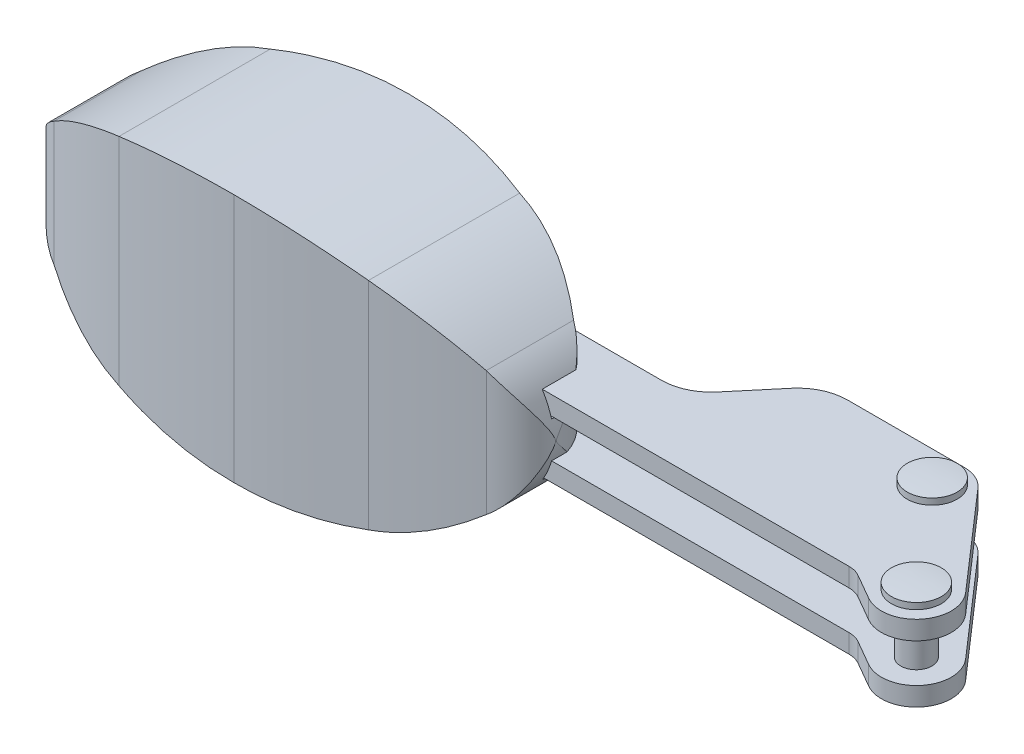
ISO-10303-21;
HEADER;
FILE_DESCRIPTION(('STEP AP214'),'2;1');
FILE_NAME('part.step','',(''),(''),'','','');
FILE_SCHEMA(('AUTOMOTIVE_DESIGN { 1 0 10303 214 1 1 1 1 }'));
ENDSEC;
DATA;
#1=APPLICATION_CONTEXT('core data for automotive mechanical design processes');
#2=APPLICATION_PROTOCOL_DEFINITION('international standard','automotive_design',2000,#1);
#3=PRODUCT_CONTEXT('',#1,'mechanical');
#4=PRODUCT('Part','Part','',(#3));
#5=PRODUCT_RELATED_PRODUCT_CATEGORY('part','',(#4));
#6=PRODUCT_DEFINITION_FORMATION('','',#4);
#7=PRODUCT_DEFINITION_CONTEXT('part definition',#1,'design');
#8=PRODUCT_DEFINITION('design','',#6,#7);
#9=PRODUCT_DEFINITION_SHAPE('','',#8);
#10=(LENGTH_UNIT() NAMED_UNIT(*) SI_UNIT(.MILLI.,.METRE.));
#11=(NAMED_UNIT(*) PLANE_ANGLE_UNIT() SI_UNIT($,.RADIAN.));
#12=(NAMED_UNIT(*) SI_UNIT($,.STERADIAN.) SOLID_ANGLE_UNIT());
#13=UNCERTAINTY_MEASURE_WITH_UNIT(LENGTH_MEASURE(1.E-05),#10,'distance_accuracy_value','');
#14=(GEOMETRIC_REPRESENTATION_CONTEXT(3) GLOBAL_UNCERTAINTY_ASSIGNED_CONTEXT((#13)) GLOBAL_UNIT_ASSIGNED_CONTEXT((#10,
#11,#12)) REPRESENTATION_CONTEXT('',''));
#15=CARTESIAN_POINT('',(0.,0.,0.));
#16=DIRECTION('',(0.,0.,1.));
#17=DIRECTION('',(1.,0.,0.));
#18=AXIS2_PLACEMENT_3D('',#15,#16,#17);
#19=CARTESIAN_POINT('',(-57.5871161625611,-12.1,7.97339202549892));
#20=DIRECTION('',(0.,1.,0.));
#21=DIRECTION('',(-1.,0.,0.));
#22=AXIS2_PLACEMENT_3D('',#19,#20,#21);
#23=CYLINDRICAL_SURFACE('',#22,3.87979592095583);
#24=CARTESIAN_POINT('',(-58.7005080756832,-5.1,11.6899999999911));
#25=CARTESIAN_POINT('',(-58.8326007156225,-5.00644241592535,11.6504074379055));
#26=CARTESIAN_POINT('',(-58.9597364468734,-4.90879254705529,11.6046723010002));
#27=CARTESIAN_POINT('',(-59.2036227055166,-4.70670032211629,11.5028649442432));
#28=CARTESIAN_POINT('',(-59.3203944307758,-4.60227262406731,11.4468145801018));
#29=CARTESIAN_POINT('',(-59.5424225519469,-4.38878219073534,11.3267996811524));
#30=CARTESIAN_POINT('',(-59.6477903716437,-4.27978221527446,11.262927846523));
#31=CARTESIAN_POINT('',(-59.8486147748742,-4.05693681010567,11.1282404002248));
#32=CARTESIAN_POINT('',(-59.944064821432,-3.94308825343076,11.0574202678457));
#33=CARTESIAN_POINT('',(-60.154051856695,-3.67440003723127,10.8866976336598));
#34=CARTESIAN_POINT('',(-60.2649807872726,-3.51805722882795,10.7847183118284));
#35=CARTESIAN_POINT('',(-60.4704379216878,-3.19957672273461,10.5735786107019));
#36=CARTESIAN_POINT('',(-60.5649620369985,-3.03743759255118,10.46441645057));
#37=CARTESIAN_POINT('',(-60.7388287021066,-2.70698951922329,10.2404954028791));
#38=CARTESIAN_POINT('',(-60.818059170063,-2.53864505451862,10.1257023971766));
#39=CARTESIAN_POINT('',(-60.9610417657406,-2.19716034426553,9.89379281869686));
#40=CARTESIAN_POINT('',(-61.0247999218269,-2.02402199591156,9.77667717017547));
#41=CARTESIAN_POINT('',(-61.1097553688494,-1.75818945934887,9.60072462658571));
#42=CARTESIAN_POINT('',(-61.1365181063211,-1.66756314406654,9.541396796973));
#43=CARTESIAN_POINT('',(-61.1861377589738,-1.48452333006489,9.423881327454));
#44=CARTESIAN_POINT('',(-61.2089951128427,-1.39211003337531,9.36569356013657));
#45=CARTESIAN_POINT('',(-61.2505836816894,-1.2059092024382,9.25223123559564));
#46=CARTESIAN_POINT('',(-61.269354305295,-1.11214503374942,9.19693315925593));
#47=CARTESIAN_POINT('',(-61.3029732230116,-0.921512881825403,9.09067402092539));
#48=CARTESIAN_POINT('',(-61.3178225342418,-0.824645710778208,9.03971183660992));
#49=CARTESIAN_POINT('',(-61.3432882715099,-0.627065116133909,8.94616923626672));
#50=CARTESIAN_POINT('',(-61.3539355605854,-0.526385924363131,8.90352891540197));
#51=CARTESIAN_POINT('',(-61.3664752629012,-0.370540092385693,8.85066733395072));
#52=CARTESIAN_POINT('',(-61.3700940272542,-0.317466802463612,8.83483812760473));
#53=CARTESIAN_POINT('',(-61.3760475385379,-0.209799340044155,8.80825247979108));
#54=CARTESIAN_POINT('',(-61.3783773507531,-0.155200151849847,8.79751555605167));
#55=CARTESIAN_POINT('',(-61.3799999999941,-0.0999999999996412,8.78999999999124));
#56=B_SPLINE_CURVE_WITH_KNOTS('',3,(#24,#25,#26,#27,#28,#29,#30,#31,#32,#33,#34,#35,#36,#37,#38,
#39,#40,#41,#42,#43,#44,#45,#46,#47,#48,#49,#50,#51,#52,#53,#54,#55),.UNSPECIFIED.,.F.,.F.,(4,2,
2,2,2,2,2,2,2,2,2,2,2,2,2,4),(0.,0.49943650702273,0.997826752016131,1.49079674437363,
1.98408962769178,2.63455046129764,3.28517317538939,3.9403967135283,4.59536455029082,
4.93002325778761,5.26464434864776,5.59587971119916,5.92702907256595,6.25569880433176,
6.42196182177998,6.58885704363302),.UNSPECIFIED.);
#57=CARTESIAN_POINT('',(-58.7005080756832,-5.1,11.6899999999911));
#58=VERTEX_POINT('',#57);
#59=CARTESIAN_POINT('',(-61.3799999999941,-0.0999999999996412,8.78999999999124));
#60=VERTEX_POINT('',#59);
#61=EDGE_CURVE('E1201',#58,#60,#56,.T.);
#62=ORIENTED_EDGE('',*,*,#61,.F.);
#63=DIRECTION('',(0.,1.,0.));
#64=VECTOR('',#63,1.);
#65=CARTESIAN_POINT('',(-58.7005080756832,-12.1,11.6899999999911));
#66=LINE('',#65,#64);
#67=CARTESIAN_POINT('',(-58.7005080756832,4.9000000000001,11.6899999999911));
#68=VERTEX_POINT('',#67);
#69=EDGE_CURVE('E1177',#58,#68,#66,.T.);
#70=ORIENTED_EDGE('',*,*,#69,.T.);
#71=CARTESIAN_POINT('',(-61.3799999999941,-0.099999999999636,8.78999999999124));
#72=CARTESIAN_POINT('',(-61.3774420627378,-0.0133559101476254,8.80191405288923));
#73=CARTESIAN_POINT('',(-61.3731763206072,0.071517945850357,8.8214880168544));
#74=CARTESIAN_POINT('',(-61.3616408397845,0.237135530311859,8.87138401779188));
#75=CARTESIAN_POINT('',(-61.354397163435,0.317908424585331,8.90161248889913));
#76=CARTESIAN_POINT('',(-61.337325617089,0.475618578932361,8.96834672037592));
#77=CARTESIAN_POINT('',(-61.327517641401,0.552580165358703,9.0048034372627));
#78=CARTESIAN_POINT('',(-61.3054326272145,0.704324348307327,9.08179187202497));
#79=CARTESIAN_POINT('',(-61.293148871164,0.779100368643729,9.12233452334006));
#80=CARTESIAN_POINT('',(-61.2612928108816,0.953850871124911,9.22111982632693));
#81=CARTESIAN_POINT('',(-61.2406979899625,1.05303807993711,9.28041249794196));
#82=CARTESIAN_POINT('',(-61.1951794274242,1.24900677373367,9.40128949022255));
#83=CARTESIAN_POINT('',(-61.1702542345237,1.34578743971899,9.46287457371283));
#84=CARTESIAN_POINT('',(-61.0890033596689,1.63332241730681,9.64906316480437));
#85=CARTESIAN_POINT('',(-61.0261909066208,1.82133166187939,9.77513743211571));
#86=CARTESIAN_POINT('',(-60.8822232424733,2.19342519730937,10.0267814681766));
#87=CARTESIAN_POINT('',(-60.8008973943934,2.37745433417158,10.1523347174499));
#88=CARTESIAN_POINT('',(-60.6195928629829,2.73960176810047,10.3983093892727));
#89=CARTESIAN_POINT('',(-60.5196243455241,2.9177232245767,10.5187335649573));
#90=CARTESIAN_POINT('',(-60.3318566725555,3.21684641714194,10.7178735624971));
#91=CARTESIAN_POINT('',(-60.2488476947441,3.33952135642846,10.7986109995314));
#92=CARTESIAN_POINT('',(-60.0726577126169,3.58094178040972,10.9547938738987));
#93=CARTESIAN_POINT('',(-59.9794757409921,3.69968689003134,11.0302388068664));
#94=CARTESIAN_POINT('',(-59.7832462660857,3.93187144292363,11.1741029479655));
#95=CARTESIAN_POINT('',(-59.6802562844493,4.04533663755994,11.2425587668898));
#96=CARTESIAN_POINT('',(-59.4638782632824,4.26671913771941,11.3713942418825));
#97=CARTESIAN_POINT('',(-59.3504971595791,4.37464006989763,11.4317792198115));
#98=CARTESIAN_POINT('',(-59.1485087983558,4.5528754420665,11.5263279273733));
#99=CARTESIAN_POINT('',(-59.0625202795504,4.62485475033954,11.5629584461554));
#100=CARTESIAN_POINT('',(-58.8853530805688,4.765250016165,11.630768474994));
#101=CARTESIAN_POINT('',(-58.7941651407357,4.8336591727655,11.6619378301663));
#102=CARTESIAN_POINT('',(-58.7005080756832,4.9000000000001,11.6899999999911));
#103=B_SPLINE_CURVE_WITH_KNOTS('',3,(#71,#72,#73,#74,#75,#76,#77,#78,#79,#80,#81,#82,#83,#84,
#85,#86,#87,#88,#89,#90,#91,#92,#93,#94,#95,#96,#97,#98,#99,#100,#101,#102),.UNSPECIFIED.,.F.,
.F.,(4,2,2,2,2,2,2,2,2,2,2,2,2,2,2,4),(0.,0.261189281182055,0.520139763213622,0.77713798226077,
1.0348431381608,1.38680913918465,1.73889332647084,2.44284253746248,3.15356343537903,
3.86389790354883,4.36960654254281,4.87536330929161,5.37831787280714,5.88093913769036,
6.23457349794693,6.58885860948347),.UNSPECIFIED.);
#104=EDGE_CURVE('E1195',#60,#68,#103,.T.);
#105=ORIENTED_EDGE('',*,*,#104,.F.);
#106=EDGE_LOOP('',(#62,#70,#105));
#107=FACE_BOUND('',#106,.T.);
#108=ADVANCED_FACE('F14',(#107),#23,.T.);
#109=CARTESIAN_POINT('',(-55.0260544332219,-0.287101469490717,17.4899999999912));
#110=DIRECTION('',(0.,0.,-1.));
#111=DIRECTION('',(0.,-1.,0.));
#112=AXIS2_PLACEMENT_3D('',#109,#110,#111);
#113=CYLINDRICAL_SURFACE('',#112,6.35669971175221);
#114=ORIENTED_EDGE('',*,*,#104,.T.);
#115=DIRECTION('',(0.,0.,-1.));
#116=VECTOR('',#115,1.);
#117=CARTESIAN_POINT('',(-58.7005080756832,4.9000000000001,17.4899999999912));
#118=LINE('',#117,#116);
#119=CARTESIAN_POINT('',(-58.7005080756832,4.90000000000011,4.68999999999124));
#120=VERTEX_POINT('',#119);
#121=EDGE_CURVE('E1218',#68,#120,#118,.T.);
#122=ORIENTED_EDGE('',*,*,#121,.T.);
#123=CARTESIAN_POINT('',(-58.7005080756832,4.90000000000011,4.68999999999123));
#124=CARTESIAN_POINT('',(-58.8700787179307,4.77984918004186,4.78537506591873));
#125=CARTESIAN_POINT('',(-59.0308318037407,4.65351993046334,4.88796566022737));
#126=CARTESIAN_POINT('',(-59.3346772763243,4.39089978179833,5.10482420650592));
#127=CARTESIAN_POINT('',(-59.4778088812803,4.25463211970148,5.21906515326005));
#128=CARTESIAN_POINT('',(-59.7455051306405,3.97568234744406,5.45547177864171));
#129=CARTESIAN_POINT('',(-59.8702754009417,3.83309904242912,5.57752347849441));
#130=CARTESIAN_POINT('',(-60.1039521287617,3.54141402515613,5.82898982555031));
#131=CARTESIAN_POINT('',(-60.2128481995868,3.39230812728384,5.95840921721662));
#132=CARTESIAN_POINT('',(-60.4385292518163,3.05401529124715,6.25335258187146));
#133=CARTESIAN_POINT('',(-60.5513850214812,2.86348598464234,6.42034371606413));
#134=CARTESIAN_POINT('',(-60.7549226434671,2.47615367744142,6.76046538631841));
#135=CARTESIAN_POINT('',(-60.8455971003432,2.2793486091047,6.93359794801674));
#136=CARTESIAN_POINT('',(-61.0063454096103,1.87872651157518,7.28521924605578));
#137=CARTESIAN_POINT('',(-61.0762281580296,1.67486257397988,7.46374199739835));
#138=CARTESIAN_POINT('',(-61.1652455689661,1.36500957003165,7.73175347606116));
#139=CARTESIAN_POINT('',(-61.1922763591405,1.26108906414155,7.82109474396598));
#140=CARTESIAN_POINT('',(-61.2411479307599,1.05149743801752,7.99913275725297));
#141=CARTESIAN_POINT('',(-61.2629896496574,0.945826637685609,8.0878296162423));
#142=CARTESIAN_POINT('',(-61.2929361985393,0.779414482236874,8.22402695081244));
#143=CARTESIAN_POINT('',(-61.3028278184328,0.719612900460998,8.27228953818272));
#144=CARTESIAN_POINT('',(-61.3210271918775,0.598728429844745,8.36764493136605));
#145=CARTESIAN_POINT('',(-61.3293332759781,0.537644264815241,8.41473645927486));
#146=CARTESIAN_POINT('',(-61.344226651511,0.414422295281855,8.50605915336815));
#147=CARTESIAN_POINT('',(-61.3508351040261,0.352308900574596,8.55031978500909));
#148=CARTESIAN_POINT('',(-61.3624040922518,0.225140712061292,8.63456507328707));
#149=CARTESIAN_POINT('',(-61.3673683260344,0.160092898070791,8.67455918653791));
#150=CARTESIAN_POINT('',(-61.3732517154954,0.0616928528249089,8.72580789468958));
#151=CARTESIAN_POINT('',(-61.3749000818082,0.0304118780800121,8.74083697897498));
#152=CARTESIAN_POINT('',(-61.3777807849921,-0.0336544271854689,8.76795298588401));
#153=CARTESIAN_POINT('',(-61.3790101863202,-0.0664486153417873,8.78001898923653));
#154=CARTESIAN_POINT('',(-61.3799999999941,-0.099999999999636,8.78999999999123));
#155=B_SPLINE_CURVE_WITH_KNOTS('',3,(#123,#124,#125,#126,#127,#128,#129,#130,#131,#132,#133,
#134,#135,#136,#137,#138,#139,#140,#141,#142,#143,#144,#145,#146,#147,#148,#149,#150,#151,#152,
#153,#154),.UNSPECIFIED.,.F.,.F.,(4,2,2,2,2,2,2,2,2,2,2,2,2,2,2,4),(0.,0.685214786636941,
1.36887588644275,2.04417759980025,2.71991920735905,3.55080985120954,4.381977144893,
5.22056338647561,5.63954016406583,6.05844119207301,6.29086377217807,6.52352974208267,
6.75313688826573,6.98222405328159,7.08631557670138,7.19112211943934),.UNSPECIFIED.);
#156=EDGE_CURVE('E1149',#120,#60,#155,.T.);
#157=ORIENTED_EDGE('',*,*,#156,.T.);
#158=EDGE_LOOP('',(#114,#122,#157));
#159=FACE_BOUND('',#158,.T.);
#160=ADVANCED_FACE('F1188',(#159),#113,.T.);
#161=CARTESIAN_POINT('',(-56.1007117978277,-12.1,9.31462722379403));
#162=DIRECTION('',(0.,1.,0.));
#163=DIRECTION('',(-1.,0.,0.));
#164=AXIS2_PLACEMENT_3D('',#161,#162,#163);
#165=CYLINDRICAL_SURFACE('',#164,5.30529147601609);
#166=CARTESIAN_POINT('',(-61.3799999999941,-0.0999999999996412,8.78999999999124));
#167=CARTESIAN_POINT('',(-61.3789623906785,-0.135150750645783,8.77952992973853));
#168=CARTESIAN_POINT('',(-61.3776628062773,-0.169468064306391,8.76679192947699));
#169=CARTESIAN_POINT('',(-61.3745985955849,-0.236544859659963,8.73805501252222));
#170=CARTESIAN_POINT('',(-61.3728358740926,-0.269310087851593,8.72206951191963));
#171=CARTESIAN_POINT('',(-61.366955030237,-0.365356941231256,8.67124017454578));
#172=CARTESIAN_POINT('',(-61.362226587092,-0.426922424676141,8.6333248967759));
#173=CARTESIAN_POINT('',(-61.3513144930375,-0.54720353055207,8.55375878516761));
#174=CARTESIAN_POINT('',(-61.3451328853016,-0.605923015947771,8.51211324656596));
#175=CARTESIAN_POINT('',(-61.3313430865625,-0.721832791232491,8.42665359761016));
#176=CARTESIAN_POINT('',(-61.3237310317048,-0.779018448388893,8.38283385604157));
#177=CARTESIAN_POINT('',(-61.2992127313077,-0.946153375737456,8.25187622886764));
#178=CARTESIAN_POINT('',(-61.2803508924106,-1.05457469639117,8.16316438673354));
#179=CARTESIAN_POINT('',(-61.2373371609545,-1.2691936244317,7.98432491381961));
#180=CARTESIAN_POINT('',(-61.2131838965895,-1.37539064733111,7.89419692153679));
#181=CARTESIAN_POINT('',(-61.1595533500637,-1.586110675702,7.71365897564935));
#182=CARTESIAN_POINT('',(-61.1300784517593,-1.69063440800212,7.62324916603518));
#183=CARTESIAN_POINT('',(-61.0657342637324,-1.89827064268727,7.44276845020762));
#184=CARTESIAN_POINT('',(-61.0308655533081,-2.00138329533,7.35269750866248));
#185=CARTESIAN_POINT('',(-60.9175525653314,-2.31001243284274,7.08248320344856));
#186=CARTESIAN_POINT('',(-60.8307301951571,-2.51352080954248,6.90346563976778));
#187=CARTESIAN_POINT('',(-60.6339690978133,-2.91435663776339,6.55121694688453));
#188=CARTESIAN_POINT('',(-60.5240285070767,-3.11168358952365,6.37798628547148));
#189=CARTESIAN_POINT('',(-60.2977193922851,-3.47033378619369,6.06455624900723));
#190=CARTESIAN_POINT('',(-60.1846156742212,-3.63271695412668,5.92321909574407));
#191=CARTESIAN_POINT('',(-59.9401049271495,-3.95020700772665,5.64871042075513));
#192=CARTESIAN_POINT('',(-59.8087134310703,-4.10531992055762,5.51553210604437));
#193=CARTESIAN_POINT('',(-59.5263137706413,-4.40713083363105,5.25903135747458));
#194=CARTESIAN_POINT('',(-59.3752397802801,-4.55379810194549,5.13574434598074));
#195=CARTESIAN_POINT('',(-59.1336968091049,-4.76536259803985,4.96065814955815));
#196=CARTESIAN_POINT('',(-59.0505631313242,-4.8345716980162,4.90386205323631));
#197=CARTESIAN_POINT('',(-58.879291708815,-4.96978454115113,4.79401254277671));
#198=CARTESIAN_POINT('',(-58.7911517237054,-5.03578682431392,4.74096082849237));
#199=CARTESIAN_POINT('',(-58.7005080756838,-5.1,4.68999999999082));
#200=B_SPLINE_CURVE_WITH_KNOTS('',3,(#166,#167,#168,#169,#170,#171,#172,#173,#174,#175,#176,
#177,#178,#179,#180,#181,#182,#183,#184,#185,#186,#187,#188,#189,#190,#191,#192,#193,#194,#195,
#196,#197,#198,#199),.UNSPECIFIED.,.F.,.F.,(4,2,2,2,2,2,2,2,2,2,2,2,2,2,2,2,4),(0.,
0.109788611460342,0.219132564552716,0.436132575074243,0.65282928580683,0.870119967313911,
1.29400511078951,1.71800027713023,2.14180598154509,2.5655662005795,3.41832551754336,
4.27115360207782,4.99984921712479,5.72792964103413,6.45851075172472,6.82485924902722,
7.19137300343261),.UNSPECIFIED.);
#201=CARTESIAN_POINT('',(-58.7005080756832,-5.1,4.68999999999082));
#202=VERTEX_POINT('',#201);
#203=EDGE_CURVE('E1146',#60,#202,#200,.T.);
#204=ORIENTED_EDGE('',*,*,#203,.F.);
#205=ORIENTED_EDGE('',*,*,#156,.F.);
#206=DIRECTION('',(0.,1.,0.));
#207=VECTOR('',#206,1.);
#208=CARTESIAN_POINT('',(-58.7005080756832,-12.1,4.68999999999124));
#209=LINE('',#208,#207);
#210=EDGE_CURVE('E755',#202,#120,#209,.T.);
#211=ORIENTED_EDGE('',*,*,#210,.F.);
#212=EDGE_LOOP('',(#204,#205,#211));
#213=FACE_BOUND('',#212,.T.);
#214=ADVANCED_FACE('F1013',(#213),#165,.T.);
#215=CARTESIAN_POINT('',(-55.0260544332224,0.0871014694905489,17.4899999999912));
#216=DIRECTION('',(0.,0.,-1.));
#217=DIRECTION('',(0.,-1.,0.));
#218=AXIS2_PLACEMENT_3D('',#215,#216,#217);
#219=CYLINDRICAL_SURFACE('',#218,6.35669971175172);
#220=ORIENTED_EDGE('',*,*,#61,.T.);
#221=ORIENTED_EDGE('',*,*,#203,.T.);
#222=DIRECTION('',(0.,0.,-1.));
#223=VECTOR('',#222,1.);
#224=CARTESIAN_POINT('',(-58.7005080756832,-5.1,17.4899999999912));
#225=LINE('',#224,#223);
#226=EDGE_CURVE('E1231',#58,#202,#225,.T.);
#227=ORIENTED_EDGE('',*,*,#226,.F.);
#228=EDGE_LOOP('',(#220,#221,#227));
#229=FACE_BOUND('',#228,.T.);
#230=ADVANCED_FACE('F1081',(#229),#219,.T.);
#231=CARTESIAN_POINT('',(-47.6357133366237,-12.1,-12.7814252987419));
#232=DIRECTION('',(0.,1.,0.));
#233=DIRECTION('',(-1.,0.,0.));
#234=AXIS2_PLACEMENT_3D('',#231,#232,#233);
#235=CYLINDRICAL_SURFACE('',#234,26.8566628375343);
#236=CARTESIAN_POINT('',(-51.3799999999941,-8.76025403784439,13.8129473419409));
#237=CARTESIAN_POINT('',(-51.6338019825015,-8.69477766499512,13.7772173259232));
#238=CARTESIAN_POINT('',(-51.8857814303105,-8.62431581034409,13.738031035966));
#239=CARTESIAN_POINT('',(-52.3856636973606,-8.47368571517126,13.6530702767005));
#240=CARTESIAN_POINT('',(-52.6335670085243,-8.39351865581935,13.6072966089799));
#241=CARTESIAN_POINT('',(-53.3702118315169,-8.13896743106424,13.4606453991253));
#242=CARTESIAN_POINT('',(-53.8522982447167,-7.95042693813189,13.3503790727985));
#243=CARTESIAN_POINT('',(-54.7867990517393,-7.54187891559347,13.1100997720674));
#244=CARTESIAN_POINT('',(-55.239590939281,-7.32249761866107,12.9804771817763));
#245=CARTESIAN_POINT('',(-56.1225658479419,-6.85219690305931,12.7032307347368));
#246=CARTESIAN_POINT('',(-56.5527543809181,-6.60128522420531,12.5556112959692));
#247=CARTESIAN_POINT('',(-57.2709532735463,-6.14510834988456,12.2893747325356));
#248=CARTESIAN_POINT('',(-57.5648357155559,-5.94693565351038,12.1743246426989));
#249=CARTESIAN_POINT('',(-57.9969153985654,-5.63825397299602,11.9965951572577));
#250=CARTESIAN_POINT('',(-58.1399372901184,-5.53309393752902,11.9362874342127));
#251=CARTESIAN_POINT('',(-58.4227012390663,-5.31920132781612,11.8142034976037));
#252=CARTESIAN_POINT('',(-58.5624425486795,-5.21046795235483,11.7524269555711));
#253=CARTESIAN_POINT('',(-58.7005080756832,-5.1,11.6899999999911));
#254=B_SPLINE_CURVE_WITH_KNOTS('',3,(#236,#237,#238,#239,#240,#241,#242,#243,#244,#245,#246,
#247,#248,#249,#250,#251,#252,#253),.UNSPECIFIED.,.F.,.F.,(4,2,2,2,2,2,2,2,4),(0.,
0.793443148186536,1.58678982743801,3.17220541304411,4.72913579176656,6.28568473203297,
7.40310334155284,7.96549856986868,8.52802077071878),.UNSPECIFIED.);
#255=CARTESIAN_POINT('',(-51.3799999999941,-8.76025403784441,13.8129473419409));
#256=VERTEX_POINT('',#255);
#257=EDGE_CURVE('E1092',#256,#58,#254,.T.);
#258=ORIENTED_EDGE('',*,*,#257,.F.);
#259=DIRECTION('',(0.,1.,0.));
#260=VECTOR('',#259,1.);
#261=CARTESIAN_POINT('',(-51.3799999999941,-12.1,13.8129473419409));
#262=LINE('',#261,#260);
#263=CARTESIAN_POINT('',(-51.3799999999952,8.56025403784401,13.8129473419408));
#264=VERTEX_POINT('',#263);
#265=EDGE_CURVE('E1174',#256,#264,#262,.T.);
#266=ORIENTED_EDGE('',*,*,#265,.T.);
#267=CARTESIAN_POINT('',(-58.7005080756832,4.9000000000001,11.6899999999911));
#268=CARTESIAN_POINT('',(-58.3112425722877,5.21146718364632,11.8660536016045));
#269=CARTESIAN_POINT('',(-57.9084714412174,5.50926430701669,12.0369337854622));
#270=CARTESIAN_POINT('',(-57.0767593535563,6.07569313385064,12.3650760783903));
#271=CARTESIAN_POINT('',(-56.6477817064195,6.34428241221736,12.5223183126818));
#272=CARTESIAN_POINT('',(-55.774359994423,6.84455957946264,12.8164460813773));
#273=CARTESIAN_POINT('',(-55.3303906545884,7.07687307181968,12.9536731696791));
#274=CARTESIAN_POINT('',(-54.4215198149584,7.5083325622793,13.2081023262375));
#275=CARTESIAN_POINT('',(-53.956637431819,7.70750809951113,13.3253222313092));
#276=CARTESIAN_POINT('',(-53.1421326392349,8.01929339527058,13.5069996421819));
#277=CARTESIAN_POINT('',(-52.7970026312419,8.14047083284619,13.5770119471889));
#278=CARTESIAN_POINT('',(-52.0958443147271,8.36462201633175,13.7047174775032));
#279=CARTESIAN_POINT('',(-51.7397556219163,8.46745905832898,13.7623188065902));
#280=CARTESIAN_POINT('',(-51.3799999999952,8.56025403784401,13.8129473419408));
#281=B_SPLINE_CURVE_WITH_KNOTS('',3,(#267,#268,#269,#270,#271,#272,#273,#274,#275,#276,#277,
#278,#279,#280),.UNSPECIFIED.,.F.,.F.,(4,2,2,2,2,2,4),(0.,1.58601618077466,3.17430615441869,
4.73113264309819,6.286563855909,7.40308407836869,8.52760716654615),.UNSPECIFIED.);
#282=EDGE_CURVE('E1085',#68,#264,#281,.T.);
#283=ORIENTED_EDGE('',*,*,#282,.F.);
#284=ORIENTED_EDGE('',*,*,#69,.F.);
#285=EDGE_LOOP('',(#258,#266,#283,#284));
#286=FACE_BOUND('',#285,.T.);
#287=ADVANCED_FACE('F939',(#286),#235,.T.);
#288=CARTESIAN_POINT('',(6.61999999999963,-16.2497487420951,7.88999999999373));
#289=DIRECTION('',(0.,1.,0.));
#290=DIRECTION('',(-0.118166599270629,0.,0.992993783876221));
#291=AXIS2_PLACEMENT_3D('',#288,#289,#290);
#292=SPHERICAL_SURFACE('',#291,19.9999999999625);
#293=CARTESIAN_POINT('',(6.61999999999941,3.64999999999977,7.88999999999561));
#294=DIRECTION('',(0.,1.,0.));
#295=DIRECTION('',(0.992993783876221,0.,0.118166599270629));
#296=AXIS2_PLACEMENT_3D('',#293,#294,#295);
#297=CIRCLE('',#296,2.);
#298=CARTESIAN_POINT('',(8.60598756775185,3.64999999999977,8.12633319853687));
#299=VERTEX_POINT('',#298);
#300=EDGE_CURVE('E2688',#299,#299,#297,.T.);
#301=ORIENTED_EDGE('',*,*,#300,.T.);
#302=EDGE_LOOP('',(#301));
#303=FACE_BOUND('',#302,.T.);
#304=ADVANCED_FACE('F935',(#303),#292,.T.);
#305=CARTESIAN_POINT('',(-46.5025952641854,-10.345190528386,17.4899999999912));
#306=DIRECTION('',(0.,0.,-1.));
#307=DIRECTION('',(0.,-1.,0.));
#308=AXIS2_PLACEMENT_3D('',#305,#306,#307);
#309=CYLINDRICAL_SURFACE('',#308,19.5244695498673);
#310=ORIENTED_EDGE('',*,*,#282,.T.);
#311=DIRECTION('',(0.,0.,-1.));
#312=VECTOR('',#311,1.);
#313=CARTESIAN_POINT('',(-51.3799999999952,8.56025403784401,17.4899999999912));
#314=LINE('',#313,#312);
#315=CARTESIAN_POINT('',(-51.3799999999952,8.560254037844,1.68859168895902));
#316=VERTEX_POINT('',#315);
#317=EDGE_CURVE('E1217',#264,#316,#314,.T.);
#318=ORIENTED_EDGE('',*,*,#317,.T.);
#319=CARTESIAN_POINT('',(-51.3799999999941,8.56025403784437,1.68859168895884));
#320=CARTESIAN_POINT('',(-51.595019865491,8.50478488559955,1.71799204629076));
#321=CARTESIAN_POINT('',(-51.8084917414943,8.44579431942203,1.75170125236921));
#322=CARTESIAN_POINT('',(-52.2319193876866,8.32104757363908,1.82741689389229));
#323=CARTESIAN_POINT('',(-52.4418757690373,8.25529258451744,1.86942187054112));
#324=CARTESIAN_POINT('',(-53.0653233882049,8.04847479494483,2.00727826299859));
#325=CARTESIAN_POINT('',(-53.4730474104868,7.89768932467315,2.11506223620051));
#326=CARTESIAN_POINT('',(-54.261176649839,7.57648820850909,2.35679961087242));
#327=CARTESIAN_POINT('',(-54.6419862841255,7.40657949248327,2.49012266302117));
#328=CARTESIAN_POINT('',(-55.3843221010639,7.04704593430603,2.78165479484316));
#329=CARTESIAN_POINT('',(-55.7458462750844,6.85741904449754,2.9398664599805));
#330=CARTESIAN_POINT('',(-56.3311184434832,6.52719255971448,3.22195158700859));
#331=CARTESIAN_POINT('',(-56.5605842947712,6.3913487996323,3.33966574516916));
#332=CARTESIAN_POINT('',(-57.0102188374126,6.11277606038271,3.58420153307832));
#333=CARTESIAN_POINT('',(-57.2303897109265,5.97004871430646,3.71102100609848));
#334=CARTESIAN_POINT('',(-57.6646542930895,5.67614357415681,3.97510412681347));
#335=CARTESIAN_POINT('',(-57.8786037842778,5.5248699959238,4.11249772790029));
#336=CARTESIAN_POINT('',(-58.2968232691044,5.21657651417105,4.39535522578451));
#337=CARTESIAN_POINT('',(-58.5010930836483,5.0595565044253,4.54081927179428));
#338=CARTESIAN_POINT('',(-58.7005080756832,4.90000000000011,4.68999999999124));
#339=B_SPLINE_CURVE_WITH_KNOTS('',3,(#319,#320,#321,#322,#323,#324,#325,#326,#327,#328,#329,
#330,#331,#332,#333,#334,#335,#336,#337,#338),.UNSPECIFIED.,.F.,.F.,(4,2,2,2,2,2,2,2,2,4),(0.,
0.671828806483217,1.34353957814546,2.68492392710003,3.99669134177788,5.30859511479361,
6.18271304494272,7.05662460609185,7.9438863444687,8.8311644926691),.UNSPECIFIED.);
#340=EDGE_CURVE('E1114',#316,#120,#339,.T.);
#341=ORIENTED_EDGE('',*,*,#340,.T.);
#342=ORIENTED_EDGE('',*,*,#121,.F.);
#343=EDGE_LOOP('',(#310,#318,#341,#342));
#344=FACE_BOUND('',#343,.T.);
#345=ADVANCED_FACE('F938',(#344),#309,.T.);
#346=CARTESIAN_POINT('',(-49.2404185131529,-12.1,17.3352361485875));
#347=DIRECTION('',(0.,1.,0.));
#348=DIRECTION('',(-1.,0.,0.));
#349=AXIS2_PLACEMENT_3D('',#346,#347,#348);
#350=CYLINDRICAL_SURFACE('',#349,15.7922541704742);
#351=CARTESIAN_POINT('',(-58.7005080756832,-5.1,4.68999999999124));
#352=CARTESIAN_POINT('',(-58.3981051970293,-5.34197469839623,4.46378081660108));
#353=CARTESIAN_POINT('',(-58.0844484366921,-5.57815876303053,4.24603877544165));
#354=CARTESIAN_POINT('',(-57.43443615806,-6.03683941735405,3.82958246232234));
#355=CARTESIAN_POINT('',(-57.0980488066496,-6.25931594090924,3.63089585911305));
#356=CARTESIAN_POINT('',(-56.4115827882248,-6.6826311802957,3.25978894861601));
#357=CARTESIAN_POINT('',(-56.0620259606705,-6.88386086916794,3.08685298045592));
#358=CARTESIAN_POINT('',(-55.3428788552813,-7.26803092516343,2.7643611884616));
#359=CARTESIAN_POINT('',(-54.9733020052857,-7.45098332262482,2.61478994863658));
#360=CARTESIAN_POINT('',(-54.3434976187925,-7.73779576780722,2.38782795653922));
#361=CARTESIAN_POINT('',(-54.0885270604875,-7.84748936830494,2.30312680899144));
#362=CARTESIAN_POINT('',(-53.570923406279,-8.05705063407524,2.14592556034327));
#363=CARTESIAN_POINT('',(-53.3082915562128,-8.15691988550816,2.07342348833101));
#364=CARTESIAN_POINT('',(-52.7717889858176,-8.34762960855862,1.94035813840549));
#365=CARTESIAN_POINT('',(-52.4978057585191,-8.43830040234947,1.88000403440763));
#366=CARTESIAN_POINT('',(-51.943436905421,-8.60811482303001,1.7734611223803));
#367=CARTESIAN_POINT('',(-51.6630481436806,-8.68725265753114,1.72727941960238));
#368=CARTESIAN_POINT('',(-51.3799999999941,-8.76025403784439,1.68859168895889));
#369=B_SPLINE_CURVE_WITH_KNOTS('',3,(#351,#352,#353,#354,#355,#356,#357,#358,#359,#360,#361,
#362,#363,#364,#365,#366,#367,#368),.UNSPECIFIED.,.F.,.F.,(4,2,2,2,2,2,2,2,4),(0.,
1.34560300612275,2.69313116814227,4.00834174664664,5.32268085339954,6.19281910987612,
7.06281664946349,7.94670929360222,8.83104435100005),.UNSPECIFIED.);
#370=CARTESIAN_POINT('',(-51.3799999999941,-8.76025403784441,1.68859168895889));
#371=VERTEX_POINT('',#370);
#372=EDGE_CURVE('E1106',#202,#371,#369,.T.);
#373=ORIENTED_EDGE('',*,*,#372,.F.);
#374=ORIENTED_EDGE('',*,*,#210,.T.);
#375=ORIENTED_EDGE('',*,*,#340,.F.);
#376=DIRECTION('',(0.,1.,0.));
#377=VECTOR('',#376,1.);
#378=CARTESIAN_POINT('',(-51.3799999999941,-12.1,1.68859168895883));
#379=LINE('',#378,#377);
#380=EDGE_CURVE('E1139',#371,#316,#379,.T.);
#381=ORIENTED_EDGE('',*,*,#380,.F.);
#382=EDGE_LOOP('',(#373,#374,#375,#381));
#383=FACE_BOUND('',#382,.T.);
#384=ADVANCED_FACE('F1100',(#383),#350,.T.);
#385=CARTESIAN_POINT('',(-46.5025952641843,10.1451905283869,17.4899999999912));
#386=DIRECTION('',(0.,0.,-1.));
#387=DIRECTION('',(0.,-1.,0.));
#388=AXIS2_PLACEMENT_3D('',#385,#386,#387);
#389=CYLINDRICAL_SURFACE('',#388,19.5244695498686);
#390=ORIENTED_EDGE('',*,*,#257,.T.);
#391=ORIENTED_EDGE('',*,*,#226,.T.);
#392=ORIENTED_EDGE('',*,*,#372,.T.);
#393=DIRECTION('',(0.,0.,-1.));
#394=VECTOR('',#393,1.);
#395=CARTESIAN_POINT('',(-51.3799999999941,-8.76025403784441,17.4899999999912));
#396=LINE('',#395,#394);
#397=EDGE_CURVE('E1232',#256,#371,#396,.T.);
#398=ORIENTED_EDGE('',*,*,#397,.F.);
#399=EDGE_LOOP('',(#390,#391,#392,#398));
#400=FACE_BOUND('',#399,.T.);
#401=ADVANCED_FACE('F1076',(#400),#389,.T.);
#402=CARTESIAN_POINT('',(-41.616816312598,-12.1,-47.0966074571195));
#403=DIRECTION('',(0.,1.,0.));
#404=DIRECTION('',(-1.,0.,0.));
#405=AXIS2_PLACEMENT_3D('',#402,#403,#404);
#406=CYLINDRICAL_SURFACE('',#405,61.6870620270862);
#407=CARTESIAN_POINT('',(-41.3799999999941,-10.1,14.5899999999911));
#408=CARTESIAN_POINT('',(-41.8046162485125,-10.1000028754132,14.591634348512));
#409=CARTESIAN_POINT('',(-42.2292083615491,-10.0928801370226,14.5888749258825));
#410=CARTESIAN_POINT('',(-43.0777620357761,-10.0644190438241,14.5746114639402));
#411=CARTESIAN_POINT('',(-43.5017236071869,-10.0430809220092,14.5631075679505));
#412=CARTESIAN_POINT('',(-44.7666303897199,-9.95814434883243,14.5157373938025));
#413=CARTESIAN_POINT('',(-45.6058065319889,-9.87362179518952,14.4670309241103));
#414=CARTESIAN_POINT('',(-47.2740604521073,-9.64943075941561,14.3361957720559));
#415=CARTESIAN_POINT('',(-48.1031386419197,-9.50976453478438,14.2540684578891));
#416=CARTESIAN_POINT('',(-49.3380453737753,-9.25953898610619,14.1067398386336));
#417=CARTESIAN_POINT('',(-49.7494723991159,-9.16900326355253,14.0534071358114));
#418=CARTESIAN_POINT('',(-50.5680533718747,-8.97458446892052,13.9389543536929));
#419=CARTESIAN_POINT('',(-50.9752074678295,-8.87070186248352,13.877834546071));
#420=CARTESIAN_POINT('',(-51.3799999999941,-8.76025403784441,13.8129473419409));
#421=B_SPLINE_CURVE_WITH_KNOTS('',3,(#407,#408,#409,#410,#411,#412,#413,#414,#415,#416,#417,
#418,#419,#420),.UNSPECIFIED.,.F.,.F.,(4,2,2,2,2,2,4),(0.,1.27369440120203,2.5473679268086,
5.07913223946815,7.61079291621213,8.88442784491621,10.1580183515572),.UNSPECIFIED.);
#422=CARTESIAN_POINT('',(-41.3799999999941,-10.1,14.5899999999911));
#423=VERTEX_POINT('',#422);
#424=EDGE_CURVE('E1068',#423,#256,#421,.T.);
#425=ORIENTED_EDGE('',*,*,#424,.F.);
#426=DIRECTION('',(0.,1.,0.));
#427=VECTOR('',#426,1.);
#428=CARTESIAN_POINT('',(-41.3799999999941,-12.1,14.5899999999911));
#429=LINE('',#428,#427);
#430=CARTESIAN_POINT('',(-41.3799999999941,9.9,14.5899999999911));
#431=VERTEX_POINT('',#430);
#432=EDGE_CURVE('E1171',#423,#431,#429,.T.);
#433=ORIENTED_EDGE('',*,*,#432,.T.);
#434=CARTESIAN_POINT('',(-51.3799999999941,8.56025403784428,13.8129473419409));
#435=CARTESIAN_POINT('',(-50.9752074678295,8.67070186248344,13.877834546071));
#436=CARTESIAN_POINT('',(-50.5680533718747,8.77458446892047,13.9389543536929));
#437=CARTESIAN_POINT('',(-49.7494723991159,8.9690032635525,14.0534071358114));
#438=CARTESIAN_POINT('',(-49.3380453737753,9.05953898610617,14.1067398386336));
#439=CARTESIAN_POINT('',(-48.1031386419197,9.30976453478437,14.2540684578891));
#440=CARTESIAN_POINT('',(-47.2740604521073,9.44943075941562,14.3361957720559));
#441=CARTESIAN_POINT('',(-45.6058065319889,9.67362179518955,14.4670309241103));
#442=CARTESIAN_POINT('',(-44.7666303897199,9.75814434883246,14.5157373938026));
#443=CARTESIAN_POINT('',(-43.501723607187,9.84308092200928,14.5631075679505));
#444=CARTESIAN_POINT('',(-43.0777620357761,9.86441904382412,14.5746114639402));
#445=CARTESIAN_POINT('',(-42.2292083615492,9.8928801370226,14.5888749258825));
#446=CARTESIAN_POINT('',(-41.8046162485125,9.90000287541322,14.591634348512));
#447=CARTESIAN_POINT('',(-41.3799999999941,9.9,14.5899999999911));
#448=B_SPLINE_CURVE_WITH_KNOTS('',3,(#434,#435,#436,#437,#438,#439,#440,#441,#442,#443,#444,
#445,#446,#447),.UNSPECIFIED.,.F.,.F.,(4,2,2,2,2,2,4),(0.,1.27359050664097,2.54722543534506,
5.07888611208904,7.61065042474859,8.88432395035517,10.1580183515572),.UNSPECIFIED.);
#449=EDGE_CURVE('E1059',#264,#431,#448,.T.);
#450=ORIENTED_EDGE('',*,*,#449,.F.);
#451=ORIENTED_EDGE('',*,*,#265,.F.);
#452=EDGE_LOOP('',(#425,#433,#450,#451));
#453=FACE_BOUND('',#452,.T.);
#454=ADVANCED_FACE('F1073',(#453),#406,.T.);
#455=CARTESIAN_POINT('',(-41.1431836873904,-12.1,-47.0966074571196));
#456=DIRECTION('',(0.,1.,0.));
#457=DIRECTION('',(-1.,0.,0.));
#458=AXIS2_PLACEMENT_3D('',#455,#456,#457);
#459=CYLINDRICAL_SURFACE('',#458,61.6870620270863);
#460=CARTESIAN_POINT('',(-31.3799999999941,-8.76025403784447,13.8129473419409));
#461=CARTESIAN_POINT('',(-31.7847925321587,-8.87070186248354,13.877834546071));
#462=CARTESIAN_POINT('',(-32.1919466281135,-8.97458446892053,13.9389543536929));
#463=CARTESIAN_POINT('',(-33.0105276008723,-9.16900326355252,14.0534071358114));
#464=CARTESIAN_POINT('',(-33.4219546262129,-9.2595389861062,14.1067398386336));
#465=CARTESIAN_POINT('',(-34.6568613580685,-9.50976453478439,14.2540684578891));
#466=CARTESIAN_POINT('',(-35.4859395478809,-9.64943075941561,14.3361957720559));
#467=CARTESIAN_POINT('',(-37.1541934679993,-9.87362179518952,14.4670309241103));
#468=CARTESIAN_POINT('',(-37.9933696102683,-9.95814434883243,14.5157373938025));
#469=CARTESIAN_POINT('',(-39.2582763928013,-10.0430809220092,14.5631075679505));
#470=CARTESIAN_POINT('',(-39.6822379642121,-10.0644190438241,14.5746114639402));
#471=CARTESIAN_POINT('',(-40.5307916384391,-10.0928801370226,14.5888749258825));
#472=CARTESIAN_POINT('',(-40.9553837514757,-10.1000028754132,14.591634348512));
#473=CARTESIAN_POINT('',(-41.3799999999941,-10.1,14.5899999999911));
#474=B_SPLINE_CURVE_WITH_KNOTS('',3,(#460,#461,#462,#463,#464,#465,#466,#467,#468,#469,#470,
#471,#472,#473),.UNSPECIFIED.,.F.,.F.,(4,2,2,2,2,2,4),(0.,1.27359050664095,2.54722543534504,
5.07888611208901,7.61065042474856,8.88432395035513,10.1580183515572),.UNSPECIFIED.);
#475=CARTESIAN_POINT('',(-31.3799999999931,-8.76025403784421,13.8129473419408));
#476=VERTEX_POINT('',#475);
#477=EDGE_CURVE('E1058',#476,#423,#474,.T.);
#478=ORIENTED_EDGE('',*,*,#477,.F.);
#479=DIRECTION('',(0.,1.,0.));
#480=VECTOR('',#479,1.);
#481=CARTESIAN_POINT('',(-31.3799999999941,-12.1,13.8129473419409));
#482=LINE('',#481,#480);
#483=CARTESIAN_POINT('',(-31.3799999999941,8.56025403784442,13.8129473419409));
#484=VERTEX_POINT('',#483);
#485=EDGE_CURVE('E1168',#476,#484,#482,.T.);
#486=ORIENTED_EDGE('',*,*,#485,.T.);
#487=CARTESIAN_POINT('',(-41.3799999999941,9.9,14.5899999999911));
#488=CARTESIAN_POINT('',(-40.9553837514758,9.90000287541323,14.591634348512));
#489=CARTESIAN_POINT('',(-40.5307916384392,9.89288013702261,14.5888749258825));
#490=CARTESIAN_POINT('',(-39.6822379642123,9.86441904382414,14.5746114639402));
#491=CARTESIAN_POINT('',(-39.2582763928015,9.8430809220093,14.5631075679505));
#492=CARTESIAN_POINT('',(-37.9933696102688,9.7581443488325,14.5157373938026));
#493=CARTESIAN_POINT('',(-37.1541934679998,9.6736217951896,14.4670309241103));
#494=CARTESIAN_POINT('',(-35.4859395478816,9.44943075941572,14.3361957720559));
#495=CARTESIAN_POINT('',(-34.6568613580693,9.30976453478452,14.2540684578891));
#496=CARTESIAN_POINT('',(-33.4219546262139,9.05953898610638,14.1067398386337));
#497=CARTESIAN_POINT('',(-33.0105276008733,8.96900326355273,14.0534071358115));
#498=CARTESIAN_POINT('',(-32.1919466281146,8.77458446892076,13.938954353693));
#499=CARTESIAN_POINT('',(-31.7847925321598,8.67070186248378,13.8778345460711));
#500=CARTESIAN_POINT('',(-31.3799999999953,8.5602540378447,13.8129473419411));
#501=B_SPLINE_CURVE_WITH_KNOTS('',3,(#487,#488,#489,#490,#491,#492,#493,#494,#495,#496,#497,
#498,#499,#500),.UNSPECIFIED.,.F.,.F.,(4,2,2,2,2,2,4),(0.,1.27369440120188,2.5473679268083,
5.07913223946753,7.6107929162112,8.88442784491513,10.1580183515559),.UNSPECIFIED.);
#502=EDGE_CURVE('E1229',#431,#484,#501,.T.);
#503=ORIENTED_EDGE('',*,*,#502,.F.);
#504=ORIENTED_EDGE('',*,*,#432,.F.);
#505=EDGE_LOOP('',(#478,#486,#503,#504));
#506=FACE_BOUND('',#505,.T.);
#507=ADVANCED_FACE('F912',(#506),#459,.T.);
#508=CARTESIAN_POINT('',(6.61999999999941,-2.74974874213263,7.88999999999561));
#509=DIRECTION('',(0.,-1.,0.));
#510=DIRECTION('',(-0.992993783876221,0.,-0.118166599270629));
#511=AXIS2_PLACEMENT_3D('',#508,#509,#510);
#512=CONICAL_SURFACE('',#511,0.75,1.04719755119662);
#513=CARTESIAN_POINT('',(6.61999999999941,-2.31673604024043,7.88999999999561));
#514=VERTEX_POINT('',#513);
#515=VERTEX_LOOP('',#514);
#516=FACE_BOUND('',#515,.T.);
#517=CARTESIAN_POINT('',(6.61999999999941,-2.74974874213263,7.88999999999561));
#518=DIRECTION('',(0.,1.,0.));
#519=DIRECTION('',(0.992993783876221,0.,0.118166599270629));
#520=AXIS2_PLACEMENT_3D('',#517,#518,#519);
#521=CIRCLE('',#520,0.75);
#522=CARTESIAN_POINT('',(7.36474533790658,-2.74974874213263,7.97862494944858));
#523=VERTEX_POINT('',#522);
#524=EDGE_CURVE('E500',#523,#523,#521,.T.);
#525=ORIENTED_EDGE('',*,*,#524,.F.);
#526=EDGE_LOOP('',(#525));
#527=FACE_BOUND('',#526,.T.);
#528=ADVANCED_FACE('F897',(#516,#527),#512,.F.);
#529=CARTESIAN_POINT('',(6.61999999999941,-2.31673604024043,7.88999999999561));
#530=DIRECTION('',(0.,1.,0.));
#531=DIRECTION('',(0.992993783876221,0.,0.118166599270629));
#532=AXIS2_PLACEMENT_3D('',#529,#530,#531);
#533=CYLINDRICAL_SURFACE('',#532,2.);
#534=CARTESIAN_POINT('',(6.61999999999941,3.15025125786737,7.88999999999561));
#535=DIRECTION('',(0.,1.,0.));
#536=DIRECTION('',(0.992993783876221,0.,0.118166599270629));
#537=AXIS2_PLACEMENT_3D('',#534,#535,#536);
#538=CIRCLE('',#537,2.);
#539=CARTESIAN_POINT('',(8.60598756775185,3.15025125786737,8.12633319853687));
#540=VERTEX_POINT('',#539);
#541=EDGE_CURVE('E2685',#540,#540,#538,.T.);
#542=ORIENTED_EDGE('',*,*,#541,.T.);
#543=EDGE_LOOP('',(#542));
#544=FACE_BOUND('',#543,.T.);
#545=ORIENTED_EDGE('',*,*,#300,.F.);
#546=EDGE_LOOP('',(#545));
#547=FACE_BOUND('',#546,.T.);
#548=ADVANCED_FACE('F911',(#544,#547),#533,.T.);
#549=CARTESIAN_POINT('',(-41.3799999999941,-28.0903810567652,17.4899999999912));
#550=DIRECTION('',(0.,0.,-1.));
#551=DIRECTION('',(0.,-1.,0.));
#552=AXIS2_PLACEMENT_3D('',#549,#550,#551);
#553=CYLINDRICAL_SURFACE('',#552,37.9903810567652);
#554=ORIENTED_EDGE('',*,*,#449,.T.);
#555=ORIENTED_EDGE('',*,*,#502,.T.);
#556=DIRECTION('',(0.,0.,-1.));
#557=VECTOR('',#556,1.);
#558=CARTESIAN_POINT('',(-31.3799999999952,8.56025403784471,17.4899999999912));
#559=LINE('',#558,#557);
#560=CARTESIAN_POINT('',(-31.3799999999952,8.56025403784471,1.68859168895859));
#561=VERTEX_POINT('',#560);
#562=EDGE_CURVE('E1224',#484,#561,#559,.T.);
#563=ORIENTED_EDGE('',*,*,#562,.T.);
#564=CARTESIAN_POINT('',(-31.3799999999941,8.5602540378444,1.68859168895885));
#565=CARTESIAN_POINT('',(-31.7819532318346,8.66992478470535,1.59713629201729));
#566=CARTESIAN_POINT('',(-32.1867684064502,8.77327072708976,1.51096010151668));
#567=CARTESIAN_POINT('',(-33.0016746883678,8.96698311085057,1.34952290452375));
#568=CARTESIAN_POINT('',(-33.4117661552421,9.05734866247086,1.27426264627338));
#569=CARTESIAN_POINT('',(-34.6428838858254,9.30717688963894,1.06647473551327));
#570=CARTESIAN_POINT('',(-35.4709237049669,9.44705928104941,0.950529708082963));
#571=CARTESIAN_POINT('',(-36.7221335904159,9.61573092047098,0.811799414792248));
#572=CARTESIAN_POINT('',(-37.1407953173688,9.66510068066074,0.771416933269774));
#573=CARTESIAN_POINT('',(-37.9805415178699,9.74995082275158,0.702565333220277));
#574=CARTESIAN_POINT('',(-38.4016260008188,9.78543115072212,0.67409626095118));
#575=CARTESIAN_POINT('',(-39.2485221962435,9.84255052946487,0.629073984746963));
#576=CARTESIAN_POINT('',(-39.6743457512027,9.86408445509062,0.612611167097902));
#577=CARTESIAN_POINT('',(-40.5267870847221,9.89281477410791,0.592028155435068));
#578=CARTESIAN_POINT('',(-40.9534048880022,9.90001071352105,0.587908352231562));
#579=CARTESIAN_POINT('',(-41.3799999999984,9.9,0.589999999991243));
#580=B_SPLINE_CURVE_WITH_KNOTS('',3,(#564,#565,#566,#567,#568,#569,#570,#571,#572,#573,#574,
#575,#576,#577,#578,#579),.UNSPECIFIED.,.F.,.F.,(4,2,2,2,2,2,2,4),(0.,1.27947747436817,
2.55904261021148,5.09858028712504,6.36874976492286,7.63892417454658,8.91856477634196,
10.1982458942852),.UNSPECIFIED.);
#581=CARTESIAN_POINT('',(-41.3799999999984,9.9,0.589999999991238));
#582=VERTEX_POINT('',#581);
#583=EDGE_CURVE('E1042',#561,#582,#580,.T.);
#584=ORIENTED_EDGE('',*,*,#583,.T.);
#585=CARTESIAN_POINT('',(-41.3799999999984,9.9,0.589999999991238));
#586=CARTESIAN_POINT('',(-41.8065951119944,9.90001071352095,0.587908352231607));
#587=CARTESIAN_POINT('',(-42.2332129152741,9.89281477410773,0.592028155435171));
#588=CARTESIAN_POINT('',(-43.0856542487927,9.86408445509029,0.612611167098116));
#589=CARTESIAN_POINT('',(-43.5114778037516,9.84255052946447,0.629073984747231));
#590=CARTESIAN_POINT('',(-44.3583739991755,9.78543115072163,0.674096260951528));
#591=CARTESIAN_POINT('',(-44.7794584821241,9.74995082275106,0.702565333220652));
#592=CARTESIAN_POINT('',(-45.6192046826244,9.66510068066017,0.771416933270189));
#593=CARTESIAN_POINT('',(-46.037866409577,9.6157309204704,0.811799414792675));
#594=CARTESIAN_POINT('',(-47.2890762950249,9.44705928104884,0.950529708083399));
#595=CARTESIAN_POINT('',(-48.1171161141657,9.30717688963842,1.06647473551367));
#596=CARTESIAN_POINT('',(-49.3482338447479,9.05734866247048,1.27426264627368));
#597=CARTESIAN_POINT('',(-49.7583253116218,8.96698311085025,1.34952290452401));
#598=CARTESIAN_POINT('',(-50.5732315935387,8.77327072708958,1.51096010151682));
#599=CARTESIAN_POINT('',(-50.978046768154,8.66992478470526,1.59713629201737));
#600=CARTESIAN_POINT('',(-51.3799999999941,8.56025403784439,1.68859168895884));
#601=B_SPLINE_CURVE_WITH_KNOTS('',3,(#585,#586,#587,#588,#589,#590,#591,#592,#593,#594,#595,
#596,#597,#598,#599,#600),.UNSPECIFIED.,.F.,.F.,(4,2,2,2,2,2,2,4),(0.,1.2796811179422,
2.55932171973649,3.82949612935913,5.09966560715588,7.63920328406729,8.9187684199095,
10.1982458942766),.UNSPECIFIED.);
#602=EDGE_CURVE('E1113',#582,#316,#601,.T.);
#603=ORIENTED_EDGE('',*,*,#602,.T.);
#604=ORIENTED_EDGE('',*,*,#317,.F.);
#605=EDGE_LOOP('',(#554,#555,#563,#584,#603,#604));
#606=FACE_BOUND('',#605,.T.);
#607=ADVANCED_FACE('F933',(#606),#553,.T.);
#608=CARTESIAN_POINT('',(-41.5950971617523,-12.1,44.694175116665));
#609=DIRECTION('',(0.,1.,0.));
#610=DIRECTION('',(-1.,0.,0.));
#611=AXIS2_PLACEMENT_3D('',#608,#609,#610);
#612=CYLINDRICAL_SURFACE('',#611,44.1046996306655);
#613=CARTESIAN_POINT('',(-51.3799999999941,-8.76025403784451,1.68859168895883));
#614=CARTESIAN_POINT('',(-50.978046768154,-8.86992478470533,1.59713629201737));
#615=CARTESIAN_POINT('',(-50.5732315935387,-8.97327072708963,1.51096010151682));
#616=CARTESIAN_POINT('',(-49.7583253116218,-9.16698311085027,1.349522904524));
#617=CARTESIAN_POINT('',(-49.3482338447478,-9.25734866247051,1.27426264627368));
#618=CARTESIAN_POINT('',(-48.1171161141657,-9.50717688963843,1.06647473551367));
#619=CARTESIAN_POINT('',(-47.2890762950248,-9.64705928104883,0.950529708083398));
#620=CARTESIAN_POINT('',(-46.0378664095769,-9.81573092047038,0.811799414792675));
#621=CARTESIAN_POINT('',(-45.6192046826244,-9.86510068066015,0.771416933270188));
#622=CARTESIAN_POINT('',(-44.779458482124,-9.94995082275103,0.702565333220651));
#623=CARTESIAN_POINT('',(-44.3583739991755,-9.98543115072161,0.674096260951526));
#624=CARTESIAN_POINT('',(-43.5114778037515,-10.0425505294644,0.629073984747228));
#625=CARTESIAN_POINT('',(-43.0856542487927,-10.0640844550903,0.612611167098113));
#626=CARTESIAN_POINT('',(-42.2332129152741,-10.0928147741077,0.592028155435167));
#627=CARTESIAN_POINT('',(-41.8065951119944,-10.1000107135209,0.587908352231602));
#628=CARTESIAN_POINT('',(-41.3799999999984,-10.1,0.589999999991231));
#629=B_SPLINE_CURVE_WITH_KNOTS('',3,(#613,#614,#615,#616,#617,#618,#619,#620,#621,#622,#623,
#624,#625,#626,#627,#628),.UNSPECIFIED.,.F.,.F.,(4,2,2,2,2,2,2,4),(0.,1.27947747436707,
2.55904261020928,5.09858028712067,6.36874976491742,7.63892417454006,8.91856477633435,
10.1982458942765),.UNSPECIFIED.);
#630=CARTESIAN_POINT('',(-41.3799999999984,-10.1,0.589999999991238));
#631=VERTEX_POINT('',#630);
#632=EDGE_CURVE('E1320',#371,#631,#629,.T.);
#633=ORIENTED_EDGE('',*,*,#632,.F.);
#634=ORIENTED_EDGE('',*,*,#380,.T.);
#635=ORIENTED_EDGE('',*,*,#602,.F.);
#636=DIRECTION('',(0.,1.,0.));
#637=VECTOR('',#636,1.);
#638=CARTESIAN_POINT('',(-41.3799999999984,-12.1,0.589999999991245));
#639=LINE('',#638,#637);
#640=EDGE_CURVE('E1150',#631,#582,#639,.T.);
#641=ORIENTED_EDGE('',*,*,#640,.F.);
#642=EDGE_LOOP('',(#633,#634,#635,#641));
#643=FACE_BOUND('',#642,.T.);
#644=ADVANCED_FACE('F983',(#643),#612,.T.);
#645=CARTESIAN_POINT('',(-41.3799999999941,27.890381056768,17.4899999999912));
#646=DIRECTION('',(0.,0.,-1.));
#647=DIRECTION('',(0.,-1.,0.));
#648=AXIS2_PLACEMENT_3D('',#645,#646,#647);
#649=CYLINDRICAL_SURFACE('',#648,37.990381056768);
#650=ORIENTED_EDGE('',*,*,#424,.T.);
#651=ORIENTED_EDGE('',*,*,#397,.T.);
#652=ORIENTED_EDGE('',*,*,#632,.T.);
#653=CARTESIAN_POINT('',(-41.3799999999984,-10.1,0.589999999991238));
#654=CARTESIAN_POINT('',(-40.9534048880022,-10.100010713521,0.587908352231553));
#655=CARTESIAN_POINT('',(-40.5267870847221,-10.0928147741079,0.59202815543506));
#656=CARTESIAN_POINT('',(-39.6743457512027,-10.0640844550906,0.612611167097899));
#657=CARTESIAN_POINT('',(-39.2485221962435,-10.0425505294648,0.629073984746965));
#658=CARTESIAN_POINT('',(-38.4016260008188,-9.98543115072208,0.674096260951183));
#659=CARTESIAN_POINT('',(-37.9805415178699,-9.94995082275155,0.702565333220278));
#660=CARTESIAN_POINT('',(-37.1407953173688,-9.86510068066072,0.771416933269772));
#661=CARTESIAN_POINT('',(-36.7221335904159,-9.81573092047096,0.811799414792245));
#662=CARTESIAN_POINT('',(-35.4709237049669,-9.64705928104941,0.950529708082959));
#663=CARTESIAN_POINT('',(-34.6428838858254,-9.50717688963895,1.06647473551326));
#664=CARTESIAN_POINT('',(-33.4117661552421,-9.25734866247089,1.27426264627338));
#665=CARTESIAN_POINT('',(-33.0016746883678,-9.1669831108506,1.34952290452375));
#666=CARTESIAN_POINT('',(-32.1867684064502,-8.97327072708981,1.51096010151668));
#667=CARTESIAN_POINT('',(-31.7819532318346,-8.86992478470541,1.5971362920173));
#668=CARTESIAN_POINT('',(-31.3799999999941,-8.76025403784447,1.68859168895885));
#669=B_SPLINE_CURVE_WITH_KNOTS('',3,(#653,#654,#655,#656,#657,#658,#659,#660,#661,#662,#663,
#664,#665,#666,#667,#668),.UNSPECIFIED.,.F.,.F.,(4,2,2,2,2,2,2,4),(0.,1.27968111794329,
2.55932171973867,3.82949612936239,5.09966560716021,7.63920328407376,8.91876841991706,
10.1982458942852),.UNSPECIFIED.);
#670=CARTESIAN_POINT('',(-31.3799999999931,-8.76025403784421,1.68859168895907));
#671=VERTEX_POINT('',#670);
#672=EDGE_CURVE('E1051',#631,#671,#669,.T.);
#673=ORIENTED_EDGE('',*,*,#672,.T.);
#674=DIRECTION('',(0.,0.,-1.));
#675=VECTOR('',#674,1.);
#676=CARTESIAN_POINT('',(-31.3799999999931,-8.76025403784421,17.4899999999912));
#677=LINE('',#676,#675);
#678=EDGE_CURVE('E1203',#476,#671,#677,.T.);
#679=ORIENTED_EDGE('',*,*,#678,.F.);
#680=ORIENTED_EDGE('',*,*,#477,.T.);
#681=EDGE_LOOP('',(#650,#651,#652,#673,#679,#680));
#682=FACE_BOUND('',#681,.T.);
#683=ADVANCED_FACE('F977',(#682),#649,.T.);
#684=CARTESIAN_POINT('',(-35.1242866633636,-12.1,-12.7814252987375));
#685=DIRECTION('',(0.,1.,0.));
#686=DIRECTION('',(-1.,0.,0.));
#687=AXIS2_PLACEMENT_3D('',#684,#685,#686);
#688=CYLINDRICAL_SURFACE('',#687,26.8566628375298);
#689=CARTESIAN_POINT('',(-24.0594919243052,-5.1,11.6899999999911));
#690=CARTESIAN_POINT('',(-24.4487574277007,-5.41146718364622,11.8660536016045));
#691=CARTESIAN_POINT('',(-24.851528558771,-5.7092643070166,12.0369337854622));
#692=CARTESIAN_POINT('',(-25.6832406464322,-6.2756931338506,12.3650760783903));
#693=CARTESIAN_POINT('',(-26.112218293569,-6.54428241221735,12.5223183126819));
#694=CARTESIAN_POINT('',(-26.9856400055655,-7.04455957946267,12.8164460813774));
#695=CARTESIAN_POINT('',(-27.4296093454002,-7.27687307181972,12.9536731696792));
#696=CARTESIAN_POINT('',(-28.3384801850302,-7.70833256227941,13.2081023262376));
#697=CARTESIAN_POINT('',(-28.8033625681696,-7.90750809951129,13.3253222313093));
#698=CARTESIAN_POINT('',(-29.6178673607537,-8.21929339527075,13.5069996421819));
#699=CARTESIAN_POINT('',(-29.9629973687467,-8.34047083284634,13.577011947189));
#700=CARTESIAN_POINT('',(-30.6641556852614,-8.56462201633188,13.7047174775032));
#701=CARTESIAN_POINT('',(-31.0202443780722,-8.66745905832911,13.7623188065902));
#702=CARTESIAN_POINT('',(-31.3799999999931,-8.76025403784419,13.8129473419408));
#703=B_SPLINE_CURVE_WITH_KNOTS('',3,(#689,#690,#691,#692,#693,#694,#695,#696,#697,#698,#699,
#700,#701,#702),.UNSPECIFIED.,.F.,.F.,(4,2,2,2,2,2,4),(0.,1.58601618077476,3.17430615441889,
4.7311326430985,6.2865638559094,7.40308407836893,8.52760716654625),.UNSPECIFIED.);
#704=CARTESIAN_POINT('',(-24.0594919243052,-5.1,11.6899999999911));
#705=VERTEX_POINT('',#704);
#706=EDGE_CURVE('E999',#705,#476,#703,.T.);
#707=ORIENTED_EDGE('',*,*,#706,.F.);
#708=DIRECTION('',(0.,1.,0.));
#709=VECTOR('',#708,1.);
#710=CARTESIAN_POINT('',(-24.0594919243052,-12.1,11.6899999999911));
#711=LINE('',#710,#709);
#712=CARTESIAN_POINT('',(-24.0594919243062,4.9000000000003,11.6899999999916));
#713=VERTEX_POINT('',#712);
#714=EDGE_CURVE('E1164',#705,#713,#711,.T.);
#715=ORIENTED_EDGE('',*,*,#714,.T.);
#716=CARTESIAN_POINT('',(-31.3799999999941,8.56025403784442,13.8129473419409));
#717=CARTESIAN_POINT('',(-31.1261980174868,8.49477766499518,13.7772173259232));
#718=CARTESIAN_POINT('',(-30.8742185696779,8.42431581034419,13.738031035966));
#719=CARTESIAN_POINT('',(-30.3743363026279,8.27368571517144,13.6530702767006));
#720=CARTESIAN_POINT('',(-30.1264329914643,8.19351865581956,13.60729660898));
#721=CARTESIAN_POINT('',(-29.389788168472,7.93896743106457,13.4606453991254));
#722=CARTESIAN_POINT('',(-28.9077017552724,7.7504269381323,13.3503790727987));
#723=CARTESIAN_POINT('',(-27.9732009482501,7.34187891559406,13.1100997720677));
#724=CARTESIAN_POINT('',(-27.5204090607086,7.12249761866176,12.9804771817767));
#725=CARTESIAN_POINT('',(-26.637434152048,6.65219690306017,12.7032307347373));
#726=CARTESIAN_POINT('',(-26.2072456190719,6.40128522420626,12.5556112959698));
#727=CARTESIAN_POINT('',(-25.4890467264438,5.94510834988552,12.2893747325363));
#728=CARTESIAN_POINT('',(-25.195164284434,5.74693565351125,12.1743246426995));
#729=CARTESIAN_POINT('',(-24.7630846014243,5.43825397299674,11.9965951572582));
#730=CARTESIAN_POINT('',(-24.6200627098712,5.33309393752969,11.9362874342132));
#731=CARTESIAN_POINT('',(-24.3372987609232,5.11920132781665,11.8142034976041));
#732=CARTESIAN_POINT('',(-24.1975574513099,5.01046795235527,11.7524269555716));
#733=CARTESIAN_POINT('',(-24.0594919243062,4.90000000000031,11.6899999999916));
#734=B_SPLINE_CURVE_WITH_KNOTS('',3,(#716,#717,#718,#719,#720,#721,#722,#723,#724,#725,#726,
#727,#728,#729,#730,#731,#732,#733),.UNSPECIFIED.,.F.,.F.,(4,2,2,2,2,2,2,2,4),(0.,
0.793443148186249,1.58678982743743,3.17220541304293,4.7291357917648,6.28568473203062,
7.40310334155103,7.96549856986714,8.52802077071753),.UNSPECIFIED.);
#735=EDGE_CURVE('E993',#484,#713,#734,.T.);
#736=ORIENTED_EDGE('',*,*,#735,.F.);
#737=ORIENTED_EDGE('',*,*,#485,.F.);
#738=EDGE_LOOP('',(#707,#715,#736,#737));
#739=FACE_BOUND('',#738,.T.);
#740=ADVANCED_FACE('F916',(#739),#688,.T.);
#741=CARTESIAN_POINT('',(6.61999999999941,-2.31673604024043,7.88999999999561));
#742=DIRECTION('',(0.,1.,0.));
#743=DIRECTION('',(0.992993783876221,0.,0.118166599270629));
#744=AXIS2_PLACEMENT_3D('',#741,#742,#743);
#745=CYLINDRICAL_SURFACE('',#744,0.75);
#746=ORIENTED_EDGE('',*,*,#524,.T.);
#747=EDGE_LOOP('',(#746));
#748=FACE_BOUND('',#747,.T.);
#749=CARTESIAN_POINT('',(6.61999999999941,-3.53568129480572,7.88999999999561));
#750=DIRECTION('',(0.,1.,0.));
#751=DIRECTION('',(0.992993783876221,0.,0.118166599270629));
#752=AXIS2_PLACEMENT_3D('',#749,#750,#751);
#753=CIRCLE('',#752,0.75);
#754=CARTESIAN_POINT('',(6.70862494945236,-3.53568129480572,7.14525466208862));
#755=VERTEX_POINT('',#754);
#756=EDGE_CURVE('E2676',#755,#755,#753,.T.);
#757=ORIENTED_EDGE('',*,*,#756,.F.);
#758=EDGE_LOOP('',(#757));
#759=FACE_BOUND('',#758,.T.);
#760=ADVANCED_FACE('F769',(#748,#759),#745,.F.);
#761=CARTESIAN_POINT('',(-25.172883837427,-12.1,7.97339202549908));
#762=DIRECTION('',(0.,1.,0.));
#763=DIRECTION('',(-1.,0.,0.));
#764=AXIS2_PLACEMENT_3D('',#761,#762,#763);
#765=CYLINDRICAL_SURFACE('',#764,3.87979592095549);
#766=CARTESIAN_POINT('',(-21.3799999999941,-0.0999999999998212,8.78999999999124));
#767=CARTESIAN_POINT('',(-21.3847112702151,-0.18142544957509,8.81201700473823));
#768=CARTESIAN_POINT('',(-21.3907667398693,-0.261056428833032,8.83911360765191));
#769=CARTESIAN_POINT('',(-21.40533176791,-0.417030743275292,8.90036717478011));
#770=CARTESIAN_POINT('',(-21.4138321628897,-0.493385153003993,8.93449764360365));
#771=CARTESIAN_POINT('',(-21.4330360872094,-0.643275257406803,9.00672184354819));
#772=CARTESIAN_POINT('',(-21.4437268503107,-0.716824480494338,9.0447920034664));
#773=CARTESIAN_POINT('',(-21.4672721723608,-0.862228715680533,9.12358621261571));
#774=CARTESIAN_POINT('',(-21.4801289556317,-0.934081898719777,9.16431296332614));
#775=CARTESIAN_POINT('',(-21.5080579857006,-1.0769443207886,9.24768334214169));
#776=CARTESIAN_POINT('',(-21.5231457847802,-1.14794350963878,9.29033883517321));
#777=CARTESIAN_POINT('',(-21.5554453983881,-1.28881169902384,9.3766311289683));
#778=CARTESIAN_POINT('',(-21.5726564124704,-1.35868111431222,9.42026755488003));
#779=CARTESIAN_POINT('',(-21.6275509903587,-1.56719346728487,9.55215638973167));
#780=CARTESIAN_POINT('',(-21.6684444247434,-1.70447791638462,9.64123048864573));
#781=CARTESIAN_POINT('',(-21.7804049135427,-2.04090319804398,9.86168203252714));
#782=CARTESIAN_POINT('',(-21.8565704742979,-2.23839279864,9.99302029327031));
#783=CARTESIAN_POINT('',(-22.0283589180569,-2.62767987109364,10.2513019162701));
#784=CARTESIAN_POINT('',(-22.1239779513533,-2.8194784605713,10.3782461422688));
#785=CARTESIAN_POINT('',(-22.3348436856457,-3.19558855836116,10.6237463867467));
#786=CARTESIAN_POINT('',(-22.4499657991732,-3.37993892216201,10.7423492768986));
#787=CARTESIAN_POINT('',(-22.7010763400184,-3.74096218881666,10.9686426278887));
#788=CARTESIAN_POINT('',(-22.8370509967,-3.91764006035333,11.0763402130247));
#789=CARTESIAN_POINT('',(-23.0610397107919,-4.17988071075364,11.2294151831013));
#790=CARTESIAN_POINT('',(-23.1412974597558,-4.26899392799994,11.28016504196));
#791=CARTESIAN_POINT('',(-23.3078141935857,-4.44409871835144,11.3768602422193));
#792=CARTESIAN_POINT('',(-23.3940700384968,-4.53009188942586,11.4228080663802));
#793=CARTESIAN_POINT('',(-23.573268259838,-4.6991637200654,11.509495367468));
#794=CARTESIAN_POINT('',(-23.6662549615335,-4.78221643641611,11.5501942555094));
#795=CARTESIAN_POINT('',(-23.8583397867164,-4.94429569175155,11.6251614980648));
#796=CARTESIAN_POINT('',(-23.9574451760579,-5.02331723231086,11.6594220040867));
#797=CARTESIAN_POINT('',(-24.0594919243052,-5.1,11.6899999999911));
#798=B_SPLINE_CURVE_WITH_KNOTS('',3,(#766,#767,#768,#769,#770,#771,#772,#773,#774,#775,#776,
#777,#778,#779,#780,#781,#782,#783,#784,#785,#786,#787,#788,#789,#790,#791,#792,#793,#794,#795,
#796,#797),.UNSPECIFIED.,.F.,.F.,(4,2,2,2,2,2,2,2,2,2,2,2,2,2,2,4),(0.,0.252794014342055,
0.504652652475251,0.755083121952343,1.00577234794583,1.25829958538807,1.51073191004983,
2.01652726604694,2.76300410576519,3.50933336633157,4.25106334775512,4.99230559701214,
5.38275475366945,5.77300103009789,6.16610402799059,6.55968315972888),.UNSPECIFIED.);
#799=CARTESIAN_POINT('',(-21.3799999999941,-0.0999999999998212,8.78999999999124));
#800=VERTEX_POINT('',#799);
#801=EDGE_CURVE('E747',#800,#705,#798,.T.);
#802=ORIENTED_EDGE('',*,*,#801,.F.);
#803=CARTESIAN_POINT('',(-24.0594919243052,4.89999999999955,11.6899999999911));
#804=CARTESIAN_POINT('',(-23.9303352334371,4.80295017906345,11.6512864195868));
#805=CARTESIAN_POINT('',(-23.8059282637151,4.70217885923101,11.606706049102));
#806=CARTESIAN_POINT('',(-23.5670224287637,4.49444889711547,11.5076176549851));
#807=CARTESIAN_POINT('',(-23.4525050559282,4.38750246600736,11.4531287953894));
#808=CARTESIAN_POINT('',(-23.2343103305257,4.16931730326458,11.3364131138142));
#809=CARTESIAN_POINT('',(-23.1305420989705,4.05812771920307,11.2742629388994));
#810=CARTESIAN_POINT('',(-22.9324868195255,3.83127911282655,11.1431790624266));
#811=CARTESIAN_POINT('',(-22.8382060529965,3.71561719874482,11.0742409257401));
#812=CARTESIAN_POINT('',(-22.6252467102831,3.43625760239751,10.9038065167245));
#813=CARTESIAN_POINT('',(-22.5107546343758,3.27087629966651,10.799827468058));
#814=CARTESIAN_POINT('',(-22.298912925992,2.93435662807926,10.5841305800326));
#815=CARTESIAN_POINT('',(-22.2015651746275,2.76321762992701,10.4724118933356));
#816=CARTESIAN_POINT('',(-22.0229974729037,2.4152979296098,10.2432415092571));
#817=CARTESIAN_POINT('',(-21.9418440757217,2.23849727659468,10.1257685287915));
#818=CARTESIAN_POINT('',(-21.7955416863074,1.88011852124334,9.88802351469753));
#819=CARTESIAN_POINT('',(-21.730398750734,1.69853863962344,9.76775044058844));
#820=CARTESIAN_POINT('',(-21.633869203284,1.38824423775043,9.56601919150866));
#821=CARTESIAN_POINT('',(-21.5983216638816,1.26096576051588,9.48431130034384));
#822=CARTESIAN_POINT('',(-21.5345170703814,1.00330504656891,9.32340299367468));
#823=CARTESIAN_POINT('',(-21.5062473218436,0.872928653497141,9.24419842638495));
#824=CARTESIAN_POINT('',(-21.469368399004,0.67387417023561,9.13028049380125));
#825=CARTESIAN_POINT('',(-21.4580126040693,0.607070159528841,9.09318798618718));
#826=CARTESIAN_POINT('',(-21.4371657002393,0.471903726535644,9.02154061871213));
#827=CARTESIAN_POINT('',(-21.4276728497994,0.403542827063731,8.9869834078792));
#828=CARTESIAN_POINT('',(-21.4105648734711,0.264325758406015,8.9214987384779));
#829=CARTESIAN_POINT('',(-21.4029606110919,0.193457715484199,8.89059279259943));
#830=CARTESIAN_POINT('',(-21.3898485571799,0.0489055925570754,8.83497840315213));
#831=CARTESIAN_POINT('',(-21.3843479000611,-0.0247871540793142,8.81029114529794));
#832=CARTESIAN_POINT('',(-21.3799999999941,-0.0999999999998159,8.78999999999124));
#833=B_SPLINE_CURVE_WITH_KNOTS('',3,(#803,#804,#805,#806,#807,#808,#809,#810,#811,#812,#813,
#814,#815,#816,#817,#818,#819,#820,#821,#822,#823,#824,#825,#826,#827,#828,#829,#830,#831,#832),
.UNSPECIFIED.,.F.,.F.,(4,2,2,2,2,2,2,2,2,2,2,2,2,2,4),(0.,0.49795570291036,0.994958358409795,
1.48734052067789,1.98004655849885,2.65833849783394,3.33670481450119,4.017804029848,
4.69916050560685,5.16510207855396,5.63022533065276,5.86191550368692,6.09338804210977,
6.32616272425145,6.55972000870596),.UNSPECIFIED.);
#834=EDGE_CURVE('E756',#713,#800,#833,.T.);
#835=ORIENTED_EDGE('',*,*,#834,.F.);
#836=ORIENTED_EDGE('',*,*,#714,.F.);
#837=EDGE_LOOP('',(#802,#835,#836));
#838=FACE_BOUND('',#837,.T.);
#839=ADVANCED_FACE('F763',(#838),#765,.T.);
#840=CARTESIAN_POINT('',(6.85633319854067,3.15025125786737,5.90401243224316));
#841=DIRECTION('',(0.,-1.,0.));
#842=DIRECTION('',(-0.992993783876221,0.,-0.118166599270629));
#843=AXIS2_PLACEMENT_3D('',#840,#841,#842);
#844=PLANE('',#843);
#845=CARTESIAN_POINT('',(6.61999999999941,3.15025125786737,7.88999999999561));
#846=DIRECTION('',(0.,1.,0.));
#847=DIRECTION('',(0.992993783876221,0.,0.118166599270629));
#848=AXIS2_PLACEMENT_3D('',#845,#846,#847);
#849=CIRCLE('',#848,1.25);
#850=CARTESIAN_POINT('',(7.86124222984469,3.15025125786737,8.0377082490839));
#851=VERTEX_POINT('',#850);
#852=EDGE_CURVE('E2682',#851,#851,#849,.T.);
#853=ORIENTED_EDGE('',*,*,#852,.T.);
#854=EDGE_LOOP('',(#853));
#855=FACE_BOUND('',#854,.T.);
#856=ORIENTED_EDGE('',*,*,#541,.F.);
#857=EDGE_LOOP('',(#856));
#858=FACE_BOUND('',#857,.T.);
#859=ADVANCED_FACE('F768',(#855,#858),#844,.T.);
#860=CARTESIAN_POINT('',(-41.3799999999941,3.05,8.88999999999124));
#861=DIRECTION('',(0.,-1.,0.));
#862=DIRECTION('',(1.,0.,0.));
#863=AXIS2_PLACEMENT_3D('',#860,#861,#862);
#864=PLANE('',#863);
#865=DIRECTION('',(1.,0.,0.));
#866=VECTOR('',#865,1.);
#867=CARTESIAN_POINT('',(-41.3799999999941,3.05,4.98999999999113));
#868=LINE('',#867,#866);
#869=CARTESIAN_POINT('',(-34.3799999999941,3.05,4.98999999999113));
#870=VERTEX_POINT('',#869);
#871=CARTESIAN_POINT('',(-29.3799999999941,3.05,4.98999999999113));
#872=VERTEX_POINT('',#871);
#873=EDGE_CURVE('E490',#870,#872,#868,.T.);
#874=ORIENTED_EDGE('',*,*,#873,.T.);
#875=DIRECTION('',(0.,0.,1.));
#876=VECTOR('',#875,1.);
#877=CARTESIAN_POINT('',(-29.3799999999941,3.05,8.88999999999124));
#878=LINE('',#877,#876);
#879=CARTESIAN_POINT('',(-29.3799999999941,3.05,6.48999999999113));
#880=VERTEX_POINT('',#879);
#881=EDGE_CURVE('E412',#872,#880,#878,.T.);
#882=ORIENTED_EDGE('',*,*,#881,.T.);
#883=DIRECTION('',(-1.,0.,0.));
#884=VECTOR('',#883,1.);
#885=CARTESIAN_POINT('',(-41.3799999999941,3.05,6.48999999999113));
#886=LINE('',#885,#884);
#887=CARTESIAN_POINT('',(-34.3799999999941,3.05,6.48999999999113));
#888=VERTEX_POINT('',#887);
#889=EDGE_CURVE('E686',#880,#888,#886,.T.);
#890=ORIENTED_EDGE('',*,*,#889,.T.);
#891=DIRECTION('',(0.,0.,-1.));
#892=VECTOR('',#891,1.);
#893=CARTESIAN_POINT('',(-34.3799999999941,3.05,8.88999999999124));
#894=LINE('',#893,#892);
#895=EDGE_CURVE('E688',#888,#870,#894,.T.);
#896=ORIENTED_EDGE('',*,*,#895,.T.);
#897=EDGE_LOOP('',(#874,#882,#890,#896));
#898=FACE_BOUND('',#897,.T.);
#899=ADVANCED_FACE('F790',(#898),#864,.T.);
#900=CARTESIAN_POINT('',(-40.3799999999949,3.05,4.48999999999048));
#901=DIRECTION('',(0.,-1.,0.));
#902=DIRECTION('',(1.,0.,0.));
#903=AXIS2_PLACEMENT_3D('',#900,#901,#902);
#904=CIRCLE('',#903,0.999999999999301);
#905=CARTESIAN_POINT('',(-41.3799999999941,3.05,4.48999999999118));
#906=VERTEX_POINT('',#905);
#907=CARTESIAN_POINT('',(-40.8158898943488,3.05,3.58999999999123));
#908=VERTEX_POINT('',#907);
#909=EDGE_CURVE('E498',#906,#908,#904,.T.);
#910=ORIENTED_EDGE('',*,*,#909,.F.);
#911=DIRECTION('',(0.,0.,-1.));
#912=VECTOR('',#911,1.);
#913=CARTESIAN_POINT('',(-41.3799999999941,3.05,8.88999999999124));
#914=LINE('',#913,#912);
#915=CARTESIAN_POINT('',(-41.3799999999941,3.05,3.58999999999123));
#916=VERTEX_POINT('',#915);
#917=EDGE_CURVE('E484',#906,#916,#914,.T.);
#918=ORIENTED_EDGE('',*,*,#917,.T.);
#919=DIRECTION('',(1.,0.,0.));
#920=VECTOR('',#919,1.);
#921=CARTESIAN_POINT('',(-41.3799999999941,3.05,3.58999999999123));
#922=LINE('',#921,#920);
#923=EDGE_CURVE('E2718',#916,#908,#922,.T.);
#924=ORIENTED_EDGE('',*,*,#923,.T.);
#925=EDGE_LOOP('',(#910,#918,#924));
#926=FACE_BOUND('',#925,.T.);
#927=ADVANCED_FACE('F955',(#926),#864,.T.);
#928=CARTESIAN_POINT('',(-41.3799999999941,-1.55,8.88999999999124));
#929=DIRECTION('',(0.,-1.,0.));
#930=DIRECTION('',(1.,0.,0.));
#931=AXIS2_PLACEMENT_3D('',#928,#929,#930);
#932=PLANE('',#931);
#933=DIRECTION('',(1.,0.,0.));
#934=VECTOR('',#933,1.);
#935=CARTESIAN_POINT('',(-29.3799999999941,-1.55,4.98999999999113));
#936=LINE('',#935,#934);
#937=CARTESIAN_POINT('',(-34.3799999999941,-1.55,4.98999999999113));
#938=VERTEX_POINT('',#937);
#939=CARTESIAN_POINT('',(-29.3799999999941,-1.55,4.98999999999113));
#940=VERTEX_POINT('',#939);
#941=EDGE_CURVE('E659',#938,#940,#936,.T.);
#942=ORIENTED_EDGE('',*,*,#941,.T.);
#943=DIRECTION('',(0.,0.,1.));
#944=VECTOR('',#943,1.);
#945=CARTESIAN_POINT('',(-29.3799999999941,-1.55,6.48999999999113));
#946=LINE('',#945,#944);
#947=CARTESIAN_POINT('',(-29.3799999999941,-1.55,6.48999999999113));
#948=VERTEX_POINT('',#947);
#949=EDGE_CURVE('E514',#940,#948,#946,.T.);
#950=ORIENTED_EDGE('',*,*,#949,.T.);
#951=DIRECTION('',(-1.,0.,0.));
#952=VECTOR('',#951,1.);
#953=CARTESIAN_POINT('',(-34.3799999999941,-1.55,6.48999999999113));
#954=LINE('',#953,#952);
#955=CARTESIAN_POINT('',(-34.3799999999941,-1.55,6.48999999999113));
#956=VERTEX_POINT('',#955);
#957=EDGE_CURVE('E520',#948,#956,#954,.T.);
#958=ORIENTED_EDGE('',*,*,#957,.T.);
#959=DIRECTION('',(0.,0.,-1.));
#960=VECTOR('',#959,1.);
#961=CARTESIAN_POINT('',(-34.3799999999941,-1.55,4.98999999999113));
#962=LINE('',#961,#960);
#963=EDGE_CURVE('E664',#956,#938,#962,.T.);
#964=ORIENTED_EDGE('',*,*,#963,.T.);
#965=EDGE_LOOP('',(#942,#950,#958,#964));
#966=FACE_BOUND('',#965,.T.);
#967=ADVANCED_FACE('F671',(#966),#932,.T.);
#968=CARTESIAN_POINT('',(-36.2574047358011,-10.345190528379,17.4899999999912));
#969=DIRECTION('',(0.,0.,-1.));
#970=DIRECTION('',(0.,-1.,0.));
#971=AXIS2_PLACEMENT_3D('',#968,#969,#970);
#972=CYLINDRICAL_SURFACE('',#971,19.5244695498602);
#973=ORIENTED_EDGE('',*,*,#735,.T.);
#974=DIRECTION('',(0.,0.,-1.));
#975=VECTOR('',#974,1.);
#976=CARTESIAN_POINT('',(-24.0594919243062,4.9000000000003,17.4899999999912));
#977=LINE('',#976,#975);
#978=CARTESIAN_POINT('',(-24.0594919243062,4.9000000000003,4.6899999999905));
#979=VERTEX_POINT('',#978);
#980=EDGE_CURVE('E1316',#713,#979,#977,.T.);
#981=ORIENTED_EDGE('',*,*,#980,.T.);
#982=CARTESIAN_POINT('',(-24.0594919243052,4.8999999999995,4.68999999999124));
#983=CARTESIAN_POINT('',(-24.361894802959,5.14197469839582,4.46378081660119));
#984=CARTESIAN_POINT('',(-24.6755515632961,5.37815876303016,4.24603877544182));
#985=CARTESIAN_POINT('',(-25.3255638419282,5.83683941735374,3.82958246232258));
#986=CARTESIAN_POINT('',(-25.6619511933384,6.05931594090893,3.63089585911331));
#987=CARTESIAN_POINT('',(-26.3484172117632,6.48263118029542,3.25978894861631));
#988=CARTESIAN_POINT('',(-26.6979740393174,6.68386086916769,3.08685298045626));
#989=CARTESIAN_POINT('',(-27.4171211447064,7.06803092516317,2.7643611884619));
#990=CARTESIAN_POINT('',(-27.786697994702,7.25098332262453,2.61478994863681));
#991=CARTESIAN_POINT('',(-28.4165023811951,7.53779576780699,2.38782795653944));
#992=CARTESIAN_POINT('',(-28.6714729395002,7.64748936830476,2.30312680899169));
#993=CARTESIAN_POINT('',(-29.1890765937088,7.85705063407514,2.1459255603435));
#994=CARTESIAN_POINT('',(-29.451708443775,7.9569198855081,2.0734234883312));
#995=CARTESIAN_POINT('',(-29.9882110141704,8.1476296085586,1.94035813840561));
#996=CARTESIAN_POINT('',(-30.2621942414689,8.23830040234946,1.88000403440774));
#997=CARTESIAN_POINT('',(-30.8165630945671,8.40811482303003,1.77346112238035));
#998=CARTESIAN_POINT('',(-31.0969518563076,8.48725265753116,1.7272794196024));
#999=CARTESIAN_POINT('',(-31.3799999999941,8.56025403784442,1.68859168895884));
#1000=B_SPLINE_CURVE_WITH_KNOTS('',3,(#982,#983,#984,#985,#986,#987,#988,#989,#990,#991,#992,
#993,#994,#995,#996,#997,#998,#999),.UNSPECIFIED.,.F.,.F.,(4,2,2,2,2,2,2,2,4),(0.,
1.3456030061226,2.69313116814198,4.00834174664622,5.32268085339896,6.1928191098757,
7.06281664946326,7.94670929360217,8.83104435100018),.UNSPECIFIED.);
#1001=EDGE_CURVE('E1024',#979,#561,#1000,.T.);
#1002=ORIENTED_EDGE('',*,*,#1001,.T.);
#1003=ORIENTED_EDGE('',*,*,#562,.F.);
#1004=EDGE_LOOP('',(#973,#981,#1002,#1003));
#1005=FACE_BOUND('',#1004,.T.);
#1006=ADVANCED_FACE('F975',(#1005),#972,.T.);
#1007=CARTESIAN_POINT('',(-41.1649028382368,-12.1,44.694175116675));
#1008=DIRECTION('',(0.,1.,0.));
#1009=DIRECTION('',(-1.,0.,0.));
#1010=AXIS2_PLACEMENT_3D('',#1007,#1008,#1009);
#1011=CYLINDRICAL_SURFACE('',#1010,44.1046996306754);
#1012=ORIENTED_EDGE('',*,*,#672,.F.);
#1013=ORIENTED_EDGE('',*,*,#640,.T.);
#1014=ORIENTED_EDGE('',*,*,#583,.F.);
#1015=DIRECTION('',(0.,1.,0.));
#1016=VECTOR('',#1015,1.);
#1017=CARTESIAN_POINT('',(-31.3799999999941,-12.1,1.68859168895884));
#1018=LINE('',#1017,#1016);
#1019=EDGE_CURVE('E1155',#671,#561,#1018,.T.);
#1020=ORIENTED_EDGE('',*,*,#1019,.F.);
#1021=EDGE_LOOP('',(#1012,#1013,#1014,#1020));
#1022=FACE_BOUND('',#1021,.T.);
#1023=ADVANCED_FACE('F1009',(#1022),#1011,.T.);
#1024=CARTESIAN_POINT('',(-36.2574047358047,10.145190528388,17.4899999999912));
#1025=DIRECTION('',(0.,0.,-1.));
#1026=DIRECTION('',(0.,-1.,0.));
#1027=AXIS2_PLACEMENT_3D('',#1024,#1025,#1026);
#1028=CYLINDRICAL_SURFACE('',#1027,19.5244695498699);
#1029=ORIENTED_EDGE('',*,*,#706,.T.);
#1030=ORIENTED_EDGE('',*,*,#678,.T.);
#1031=CARTESIAN_POINT('',(-31.3799999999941,-8.76025403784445,1.68859168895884));
#1032=CARTESIAN_POINT('',(-31.1649801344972,-8.70478488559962,1.71799204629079));
#1033=CARTESIAN_POINT('',(-30.9515082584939,-8.64579431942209,1.75170125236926));
#1034=CARTESIAN_POINT('',(-30.5280806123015,-8.5210475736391,1.82741689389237));
#1035=CARTESIAN_POINT('',(-30.3181242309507,-8.45529258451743,1.86942187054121));
#1036=CARTESIAN_POINT('',(-29.6946766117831,-8.24847479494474,2.00727826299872));
#1037=CARTESIAN_POINT('',(-29.2869525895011,-8.09768932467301,2.11506223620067));
#1038=CARTESIAN_POINT('',(-28.4988233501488,-7.77648820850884,2.35679961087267));
#1039=CARTESIAN_POINT('',(-28.1180137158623,-7.60657949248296,2.49012266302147));
#1040=CARTESIAN_POINT('',(-27.3756778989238,-7.24704593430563,2.7816547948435));
#1041=CARTESIAN_POINT('',(-27.0141537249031,-7.0574190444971,2.93986645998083));
#1042=CARTESIAN_POINT('',(-26.4288815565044,-6.72719255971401,3.22195158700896));
#1043=CARTESIAN_POINT('',(-26.1994157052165,-6.59134879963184,3.33966574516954));
#1044=CARTESIAN_POINT('',(-25.7497811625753,-6.31277606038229,3.58420153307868));
#1045=CARTESIAN_POINT('',(-25.5296102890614,-6.17004871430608,3.7110210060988));
#1046=CARTESIAN_POINT('',(-25.0953457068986,-5.8761435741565,3.97510412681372));
#1047=CARTESIAN_POINT('',(-24.8813962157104,-5.72486999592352,4.11249772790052));
#1048=CARTESIAN_POINT('',(-24.4631767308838,-5.41657651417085,4.39535522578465));
#1049=CARTESIAN_POINT('',(-24.25890691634,-5.25955650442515,4.54081927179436));
#1050=CARTESIAN_POINT('',(-24.0594919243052,-5.1,4.68999999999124));
#1051=B_SPLINE_CURVE_WITH_KNOTS('',3,(#1031,#1032,#1033,#1034,#1035,#1036,#1037,#1038,#1039,
#1040,#1041,#1042,#1043,#1044,#1045,#1046,#1047,#1048,#1049,#1050),.UNSPECIFIED.,.F.,.F.,(4,2,2,
2,2,2,2,2,2,4),(0.,0.671828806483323,1.34353957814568,2.68492392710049,3.99669134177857,
5.3085951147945,6.18271304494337,7.05662460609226,7.94388634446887,8.83116449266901),.UNSPECIFIED.);
#1052=CARTESIAN_POINT('',(-24.0594919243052,-5.1,4.68999999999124));
#1053=VERTEX_POINT('',#1052);
#1054=EDGE_CURVE('E1017',#671,#1053,#1051,.T.);
#1055=ORIENTED_EDGE('',*,*,#1054,.T.);
#1056=DIRECTION('',(0.,0.,-1.));
#1057=VECTOR('',#1056,1.);
#1058=CARTESIAN_POINT('',(-24.0594919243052,-5.1,17.4899999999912));
#1059=LINE('',#1058,#1057);
#1060=EDGE_CURVE('E1202',#705,#1053,#1059,.T.);
#1061=ORIENTED_EDGE('',*,*,#1060,.F.);
#1062=EDGE_LOOP('',(#1029,#1030,#1055,#1061));
#1063=FACE_BOUND('',#1062,.T.);
#1064=ADVANCED_FACE('F1005',(#1063),#1028,.T.);
#1065=CARTESIAN_POINT('',(-26.6592882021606,-12.1,9.31462722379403));
#1066=DIRECTION('',(0.,1.,0.));
#1067=DIRECTION('',(-1.,0.,0.));
#1068=AXIS2_PLACEMENT_3D('',#1065,#1066,#1067);
#1069=CYLINDRICAL_SURFACE('',#1068,5.30529147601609);
#1070=DIRECTION('',(0.,1.,0.));
#1071=VECTOR('',#1070,1.);
#1072=CARTESIAN_POINT('',(-24.0594919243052,-12.1,4.68999999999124));
#1073=LINE('',#1072,#1071);
#1074=CARTESIAN_POINT('',(-24.0594919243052,-3.25,4.68999999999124));
#1075=VERTEX_POINT('',#1074);
#1076=EDGE_CURVE('E1161',#1053,#1075,#1073,.T.);
#1077=ORIENTED_EDGE('',*,*,#1076,.T.);
#1078=CARTESIAN_POINT('',(-26.6592882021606,-3.25,9.31462722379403));
#1079=DIRECTION('',(0.,1.,0.));
#1080=DIRECTION('',(-1.,0.,0.));
#1081=AXIS2_PLACEMENT_3D('',#1078,#1079,#1080);
#1082=CIRCLE('',#1081,5.30529147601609);
#1083=CARTESIAN_POINT('',(-22.3720488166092,-3.25,6.18961584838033));
#1084=VERTEX_POINT('',#1083);
#1085=EDGE_CURVE('E1288',#1075,#1084,#1082,.F.);
#1086=ORIENTED_EDGE('',*,*,#1085,.T.);
#1087=CARTESIAN_POINT('',(-24.0594919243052,-5.1,4.68999999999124));
#1088=CARTESIAN_POINT('',(-23.8936553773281,-4.9753468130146,4.78327487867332));
#1089=CARTESIAN_POINT('',(-23.7362459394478,-4.84509770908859,4.88345297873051));
#1090=CARTESIAN_POINT('',(-23.438276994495,-4.57555347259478,5.09507448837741));
#1091=CARTESIAN_POINT('',(-23.2976831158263,-4.43627772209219,5.20649402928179));
#1092=CARTESIAN_POINT('',(-23.0335130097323,-4.15121907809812,5.43771258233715));
#1093=CARTESIAN_POINT('',(-22.9098323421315,-4.00548423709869,5.55745257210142));
#1094=CARTESIAN_POINT('',(-22.6778129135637,-3.70796441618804,5.80425936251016));
#1095=CARTESIAN_POINT('',(-22.5694845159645,-3.55617543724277,5.93133103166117));
#1096=CARTESIAN_POINT('',(-22.3397566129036,-3.20503460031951,6.22724902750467));
#1097=CARTESIAN_POINT('',(-22.223043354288,-3.00415056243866,6.39791989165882));
#1098=CARTESIAN_POINT('',(-22.0127959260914,-2.59628999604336,6.74604906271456));
#1099=CARTESIAN_POINT('',(-21.9192654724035,-2.38931249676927,6.92350845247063));
#1100=CARTESIAN_POINT('',(-21.7543598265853,-1.97022435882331,7.2831462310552));
#1101=CARTESIAN_POINT('',(-21.6830106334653,-1.75810800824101,7.46532988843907));
#1102=CARTESIAN_POINT('',(-21.5922055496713,-1.43652422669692,7.73979719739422));
#1103=CARTESIAN_POINT('',(-21.5646406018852,-1.32876308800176,7.83148353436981));
#1104=CARTESIAN_POINT('',(-21.5148446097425,-1.11188869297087,8.01470027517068));
#1105=CARTESIAN_POINT('',(-21.4926129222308,-1.00277560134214,8.1062306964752));
#1106=CARTESIAN_POINT('',(-21.4617349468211,-0.829209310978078,8.24952831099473));
#1107=CARTESIAN_POINT('',(-21.4513227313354,-0.765414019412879,8.30171770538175));
#1108=CARTESIAN_POINT('',(-21.4322591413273,-0.636909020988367,8.40520490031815));
#1109=CARTESIAN_POINT('',(-21.4236066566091,-0.572199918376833,8.45650324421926));
#1110=CARTESIAN_POINT('',(-21.408083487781,-0.441463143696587,8.55729855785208));
#1111=CARTESIAN_POINT('',(-21.4012076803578,-0.375439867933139,8.60680034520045));
#1112=CARTESIAN_POINT('',(-21.3922301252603,-0.274297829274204,8.67839130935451));
#1113=CARTESIAN_POINT('',(-21.38945868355,-0.240205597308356,8.70182834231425));
#1114=CARTESIAN_POINT('',(-21.3843778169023,-0.170969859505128,8.74720114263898));
#1115=CARTESIAN_POINT('',(-21.3820687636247,-0.135825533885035,8.76913569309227));
#1116=CARTESIAN_POINT('',(-21.3799999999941,-0.0999999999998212,8.78999999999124));
#1117=B_SPLINE_CURVE_WITH_KNOTS('',3,(#1087,#1088,#1089,#1090,#1091,#1092,#1093,#1094,#1095,
#1096,#1097,#1098,#1099,#1100,#1101,#1102,#1103,#1104,#1105,#1106,#1107,#1108,#1109,#1110,#1111,
#1112,#1113,#1114,#1115,#1116),.UNSPECIFIED.,.F.,.F.,(4,2,2,2,2,2,2,2,2,2,2,2,2,2,4),(0.,
0.681709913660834,1.36200167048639,2.03788203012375,2.71421648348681,3.57782372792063,
4.44156930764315,5.30632351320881,5.73868746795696,6.17099925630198,6.4202116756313,
6.6692663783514,6.91759467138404,7.04195023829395,7.1664053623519),.UNSPECIFIED.);
#1118=EDGE_CURVE('E710',#1053,#1084,#1117,.T.);
#1119=ORIENTED_EDGE('',*,*,#1118,.F.);
#1120=EDGE_LOOP('',(#1077,#1086,#1119));
#1121=FACE_BOUND('',#1120,.T.);
#1122=ADVANCED_FACE('F950',(#1121),#1069,.T.);
#1123=CARTESIAN_POINT('',(-41.3799999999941,1.35,3.58999999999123));
#1124=DIRECTION('',(0.,1.,0.));
#1125=DIRECTION('',(-1.,0.,0.));
#1126=AXIS2_PLACEMENT_3D('',#1123,#1124,#1125);
#1127=PLANE('',#1126);
#1128=DIRECTION('',(1.,0.,0.));
#1129=VECTOR('',#1128,1.);
#1130=CARTESIAN_POINT('',(-41.3799999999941,1.35,3.58999999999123));
#1131=LINE('',#1130,#1129);
#1132=CARTESIAN_POINT('',(-41.3799999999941,1.35,3.58999999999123));
#1133=VERTEX_POINT('',#1132);
#1134=CARTESIAN_POINT('',(-25.7437358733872,1.35,3.58999999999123));
#1135=VERTEX_POINT('',#1134);
#1136=EDGE_CURVE('E2715',#1133,#1135,#1131,.T.);
#1137=ORIENTED_EDGE('',*,*,#1136,.F.);
#1138=DIRECTION('',(0.,0.,1.));
#1139=VECTOR('',#1138,1.);
#1140=CARTESIAN_POINT('',(-41.3799999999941,1.35,3.58999999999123));
#1141=LINE('',#1140,#1139);
#1142=CARTESIAN_POINT('',(-41.3799999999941,1.35,8.88999999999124));
#1143=VERTEX_POINT('',#1142);
#1144=EDGE_CURVE('E2706',#1133,#1143,#1141,.T.);
#1145=ORIENTED_EDGE('',*,*,#1144,.T.);
#1146=DIRECTION('',(1.,0.,0.));
#1147=VECTOR('',#1146,1.);
#1148=CARTESIAN_POINT('',(-41.3799999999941,1.35,8.88999999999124));
#1149=LINE('',#1148,#1147);
#1150=CARTESIAN_POINT('',(-21.6242509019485,1.35,8.88999999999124));
#1151=VERTEX_POINT('',#1150);
#1152=EDGE_CURVE('E2711',#1143,#1151,#1149,.T.);
#1153=ORIENTED_EDGE('',*,*,#1152,.T.);
#1154=DIRECTION('',(0.,0.,-1.));
#1155=VECTOR('',#1154,1.);
#1156=CARTESIAN_POINT('',(-21.6242509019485,1.35,17.4899999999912));
#1157=LINE('',#1156,#1155);
#1158=CARTESIAN_POINT('',(-21.6242509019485,1.35,7.64294632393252));
#1159=VERTEX_POINT('',#1158);
#1160=EDGE_CURVE('E695',#1151,#1159,#1157,.T.);
#1161=ORIENTED_EDGE('',*,*,#1160,.T.);
#1162=CARTESIAN_POINT('',(-26.6592882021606,1.35,9.31462722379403));
#1163=DIRECTION('',(0.,1.,0.));
#1164=DIRECTION('',(-1.,0.,0.));
#1165=AXIS2_PLACEMENT_3D('',#1162,#1163,#1164);
#1166=CIRCLE('',#1165,5.30529147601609);
#1167=CARTESIAN_POINT('',(-24.0594919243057,1.35,4.68999999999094));
#1168=VERTEX_POINT('',#1167);
#1169=EDGE_CURVE('E2721',#1168,#1159,#1166,.F.);
#1170=ORIENTED_EDGE('',*,*,#1169,.F.);
#1171=CARTESIAN_POINT('',(-33.5195814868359,1.35,17.3352361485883));
#1172=DIRECTION('',(0.,1.,0.));
#1173=DIRECTION('',(-1.,0.,0.));
#1174=AXIS2_PLACEMENT_3D('',#1171,#1172,#1173);
#1175=CIRCLE('',#1174,15.792254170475);
#1176=EDGE_CURVE('E2724',#1135,#1168,#1175,.F.);
#1177=ORIENTED_EDGE('',*,*,#1176,.F.);
#1178=EDGE_LOOP('',(#1137,#1145,#1153,#1161,#1170,#1177));
#1179=FACE_BOUND('',#1178,.T.);
#1180=ADVANCED_FACE('F947',(#1179),#1127,.T.);
#1181=CARTESIAN_POINT('',(-40.3799999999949,-1.55,4.48999999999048));
#1182=DIRECTION('',(0.,1.,0.));
#1183=DIRECTION('',(-1.,0.,0.));
#1184=AXIS2_PLACEMENT_3D('',#1181,#1182,#1183);
#1185=CIRCLE('',#1184,0.999999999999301);
#1186=CARTESIAN_POINT('',(-41.3799999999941,-1.55,4.48999999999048));
#1187=VERTEX_POINT('',#1186);
#1188=CARTESIAN_POINT('',(-40.8158898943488,-1.55,3.58999999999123));
#1189=VERTEX_POINT('',#1188);
#1190=EDGE_CURVE('E508',#1187,#1189,#1185,.F.);
#1191=ORIENTED_EDGE('',*,*,#1190,.F.);
#1192=DIRECTION('',(0.,0.,-1.));
#1193=VECTOR('',#1192,1.);
#1194=CARTESIAN_POINT('',(-41.3799999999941,-1.55,8.88999999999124));
#1195=LINE('',#1194,#1193);
#1196=CARTESIAN_POINT('',(-41.3799999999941,-1.55,3.58999999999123));
#1197=VERTEX_POINT('',#1196);
#1198=EDGE_CURVE('E2730',#1187,#1197,#1195,.T.);
#1199=ORIENTED_EDGE('',*,*,#1198,.T.);
#1200=DIRECTION('',(1.,0.,0.));
#1201=VECTOR('',#1200,1.);
#1202=CARTESIAN_POINT('',(-41.3799999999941,-1.55,3.58999999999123));
#1203=LINE('',#1202,#1201);
#1204=EDGE_CURVE('E1302',#1197,#1189,#1203,.T.);
#1205=ORIENTED_EDGE('',*,*,#1204,.T.);
#1206=EDGE_LOOP('',(#1191,#1199,#1205));
#1207=FACE_BOUND('',#1206,.T.);
#1208=ADVANCED_FACE('F771',(#1207),#932,.T.);
#1209=CARTESIAN_POINT('',(-41.3799999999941,-3.25,3.58999999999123));
#1210=DIRECTION('',(0.,1.,0.));
#1211=DIRECTION('',(-1.,0.,0.));
#1212=AXIS2_PLACEMENT_3D('',#1209,#1210,#1211);
#1213=PLANE('',#1212);
#1214=DIRECTION('',(1.,0.,0.));
#1215=VECTOR('',#1214,1.);
#1216=CARTESIAN_POINT('',(-41.3799999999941,-3.25,3.58999999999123));
#1217=LINE('',#1216,#1215);
#1218=CARTESIAN_POINT('',(-41.3799999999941,-3.25,3.58999999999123));
#1219=VERTEX_POINT('',#1218);
#1220=CARTESIAN_POINT('',(-25.7437358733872,-3.25,3.58999999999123));
#1221=VERTEX_POINT('',#1220);
#1222=EDGE_CURVE('E1299',#1219,#1221,#1217,.T.);
#1223=ORIENTED_EDGE('',*,*,#1222,.F.);
#1224=DIRECTION('',(0.,0.,1.));
#1225=VECTOR('',#1224,1.);
#1226=CARTESIAN_POINT('',(-41.3799999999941,-3.25,3.58999999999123));
#1227=LINE('',#1226,#1225);
#1228=CARTESIAN_POINT('',(-41.3799999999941,-3.25,8.88999999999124));
#1229=VERTEX_POINT('',#1228);
#1230=EDGE_CURVE('E1297',#1219,#1229,#1227,.T.);
#1231=ORIENTED_EDGE('',*,*,#1230,.T.);
#1232=DIRECTION('',(1.,0.,0.));
#1233=VECTOR('',#1232,1.);
#1234=CARTESIAN_POINT('',(-41.3799999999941,-3.25,8.88999999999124));
#1235=LINE('',#1234,#1233);
#1236=CARTESIAN_POINT('',(-22.3720488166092,-3.25,8.88999999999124));
#1237=VERTEX_POINT('',#1236);
#1238=EDGE_CURVE('E1295',#1229,#1237,#1235,.T.);
#1239=ORIENTED_EDGE('',*,*,#1238,.T.);
#1240=DIRECTION('',(0.,0.,-1.));
#1241=VECTOR('',#1240,1.);
#1242=CARTESIAN_POINT('',(-22.3720488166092,-3.25,17.4899999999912));
#1243=LINE('',#1242,#1241);
#1244=EDGE_CURVE('E708',#1237,#1084,#1243,.T.);
#1245=ORIENTED_EDGE('',*,*,#1244,.T.);
#1246=ORIENTED_EDGE('',*,*,#1085,.F.);
#1247=CARTESIAN_POINT('',(-33.5195814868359,-3.25,17.3352361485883));
#1248=DIRECTION('',(0.,1.,0.));
#1249=DIRECTION('',(-1.,0.,0.));
#1250=AXIS2_PLACEMENT_3D('',#1247,#1248,#1249);
#1251=CIRCLE('',#1250,15.792254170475);
#1252=EDGE_CURVE('E1311',#1221,#1075,#1251,.F.);
#1253=ORIENTED_EDGE('',*,*,#1252,.F.);
#1254=EDGE_LOOP('',(#1223,#1231,#1239,#1245,#1246,#1253));
#1255=FACE_BOUND('',#1254,.T.);
#1256=ADVANCED_FACE('F920',(#1255),#1213,.T.);
#1257=CARTESIAN_POINT('',(6.62000000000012,16.4502512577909,7.88999999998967));
#1258=DIRECTION('',(0.,1.,0.));
#1259=DIRECTION('',(0.118166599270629,0.,-0.992993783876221));
#1260=AXIS2_PLACEMENT_3D('',#1257,#1258,#1259);
#1261=SPHERICAL_SURFACE('',#1260,19.9999999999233);
#1262=CARTESIAN_POINT('',(6.61999999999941,-3.44949748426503,7.88999999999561));
#1263=DIRECTION('',(0.,1.,0.));
#1264=DIRECTION('',(0.992993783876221,0.,0.118166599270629));
#1265=AXIS2_PLACEMENT_3D('',#1262,#1263,#1264);
#1266=CIRCLE('',#1265,2.);
#1267=CARTESIAN_POINT('',(6.85633319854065,-3.44949748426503,5.90401243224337));
#1268=VERTEX_POINT('',#1267);
#1269=EDGE_CURVE('E2679',#1268,#1268,#1266,.T.);
#1270=CARTESIAN_POINT('',(6.70862494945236,-3.53568129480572,7.14525466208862));
#1271=CARTESIAN_POINT('',(6.71016639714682,-3.53519177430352,7.13230135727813));
#1272=CARTESIAN_POINT('',(6.71170778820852,-3.53468948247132,7.11934852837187));
#1273=CARTESIAN_POINT('',(6.71479045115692,-3.53365935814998,7.09344387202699));
#1274=CARTESIAN_POINT('',(6.71633172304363,-3.53313152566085,7.08049204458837));
#1275=CARTESIAN_POINT('',(6.71941414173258,-3.5320503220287,7.054589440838));
#1276=CARTESIAN_POINT('',(6.72095528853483,-3.53149695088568,7.04163866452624));
#1277=CARTESIAN_POINT('',(6.72403745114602,-3.530364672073,7.01573821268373));
#1278=CARTESIAN_POINT('',(6.72557846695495,-3.52978576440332,7.00278853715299));
#1279=CARTESIAN_POINT('',(6.72866036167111,-3.52860241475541,6.9768903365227));
#1280=CARTESIAN_POINT('',(6.73020124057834,-3.52799797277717,6.96394181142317));
#1281=CARTESIAN_POINT('',(6.73328285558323,-3.52676355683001,6.93804596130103));
#1282=CARTESIAN_POINT('',(6.73482359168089,-3.52613358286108,6.92509863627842));
#1283=CARTESIAN_POINT('',(6.73790491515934,-3.52484810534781,6.89920523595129));
#1284=CARTESIAN_POINT('',(6.73944550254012,-3.52419260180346,6.88625916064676));
#1285=CARTESIAN_POINT('',(6.74252652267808,-3.52285606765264,6.86036830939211));
#1286=CARTESIAN_POINT('',(6.74406695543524,-3.52217503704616,6.84742353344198));
#1287=CARTESIAN_POINT('',(6.74714766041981,-3.52078745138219,6.82153533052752));
#1288=CARTESIAN_POINT('',(6.74868793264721,-3.52008089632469,6.80859190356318));
#1289=CARTESIAN_POINT('',(6.75176831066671,-3.51864226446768,6.78270644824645));
#1290=CARTESIAN_POINT('',(6.7533084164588,-3.51791018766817,6.76976441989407));
#1291=CARTESIAN_POINT('',(6.7563884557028,-3.51642051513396,6.74388181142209));
#1292=CARTESIAN_POINT('',(6.7579283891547,-3.51566291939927,6.7309412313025));
#1293=CARTESIAN_POINT('',(6.76100807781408,-3.51412221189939,6.70506156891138));
#1294=CARTESIAN_POINT('',(6.76254783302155,-3.51333910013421,6.69212248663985));
#1295=CARTESIAN_POINT('',(6.76562715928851,-3.51174736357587,6.66624586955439));
#1296=CARTESIAN_POINT('',(6.767166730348,-3.51093873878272,6.65330833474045));
#1297=CARTESIAN_POINT('',(6.77024568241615,-3.50929597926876,6.62743486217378));
#1298=CARTESIAN_POINT('',(6.77178506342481,-3.50846184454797,6.61449892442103));
#1299=CARTESIAN_POINT('',(6.77486362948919,-3.50676806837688,6.58862869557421));
#1300=CARTESIAN_POINT('',(6.77640281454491,-3.50590842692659,6.57569440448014));
#1301=CARTESIAN_POINT('',(6.77948098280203,-3.50416364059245,6.54982751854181));
#1302=CARTESIAN_POINT('',(6.78101996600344,-3.50327849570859,6.53689492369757));
#1303=CARTESIAN_POINT('',(6.78409772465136,-3.50148270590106,6.51103147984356));
#1304=CARTESIAN_POINT('',(6.78563650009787,-3.50057206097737,6.49810063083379));
#1305=CARTESIAN_POINT('',(6.7887138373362,-3.49872527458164,6.47224072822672));
#1306=CARTESIAN_POINT('',(6.79025239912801,-3.4977891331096,6.45931167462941));
#1307=CARTESIAN_POINT('',(6.79332930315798,-3.49589135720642,6.43345541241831));
#1308=CARTESIAN_POINT('',(6.79486764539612,-3.49492972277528,6.42052820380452));
#1309=CARTESIAN_POINT('',(6.79794410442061,-3.49298096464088,6.39467568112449));
#1310=CARTESIAN_POINT('',(6.79948222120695,-3.49199384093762,6.38175036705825));
#1311=CARTESIAN_POINT('',(6.80255822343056,-3.4899941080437,6.35590168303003));
#1312=CARTESIAN_POINT('',(6.80409610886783,-3.48898149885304,6.34297831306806));
#1313=CARTESIAN_POINT('',(6.80717164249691,-3.48693079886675,6.31713356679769));
#1314=CARTESIAN_POINT('',(6.80870929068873,-3.48589270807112,6.30421219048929));
#1315=CARTESIAN_POINT('',(6.81178434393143,-3.48379104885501,6.2783714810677));
#1316=CARTESIAN_POINT('',(6.81332174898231,-3.48272748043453,6.26545214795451));
#1317=CARTESIAN_POINT('',(6.81639631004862,-3.48057487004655,6.23961557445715));
#1318=CARTESIAN_POINT('',(6.81793346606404,-3.47948582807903,6.22669833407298));
#1319=CARTESIAN_POINT('',(6.82100752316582,-3.47728227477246,6.20086599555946));
#1320=CARTESIAN_POINT('',(6.82254442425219,-3.47616776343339,6.1879508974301));
#1321=CARTESIAN_POINT('',(6.82561796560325,-3.47391327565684,6.16212289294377));
#1322=CARTESIAN_POINT('',(6.82715460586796,-3.47277329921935,6.1492099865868));
#1323=CARTESIAN_POINT('',(6.83022761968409,-3.4704678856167,6.1233864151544));
#1324=CARTESIAN_POINT('',(6.83176399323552,-3.46930244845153,6.11047575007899));
#1325=CARTESIAN_POINT('',(6.83483646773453,-3.46694611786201,6.08465671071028));
#1326=CARTESIAN_POINT('',(6.83637256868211,-3.46575522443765,6.07174833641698));
#1327=CARTESIAN_POINT('',(6.83944449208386,-3.46334798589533,6.04593392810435));
#1328=CARTESIAN_POINT('',(6.84098031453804,-3.46213164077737,6.03302789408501));
#1329=CARTESIAN_POINT('',(6.84405167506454,-3.45967350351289,6.00721821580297));
#1330=CARTESIAN_POINT('',(6.84558721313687,-3.45843171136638,5.99431457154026));
#1331=CARTESIAN_POINT('',(6.84865799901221,-3.45592268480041,5.96850972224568));
#1332=CARTESIAN_POINT('',(6.85019324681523,-3.45465545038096,5.9556085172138));
#1333=CARTESIAN_POINT('',(6.85326344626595,-3.45209554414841,5.92980859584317));
#1334=CARTESIAN_POINT('',(6.85479839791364,-3.45080287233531,5.91690987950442));
#1335=CARTESIAN_POINT('',(6.85633319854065,-3.44949748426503,5.90401243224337));
#1336=B_SPLINE_CURVE_WITH_KNOTS('',3,(#1270,#1271,#1272,#1273,#1274,#1275,#1276,#1277,#1278,
#1279,#1280,#1281,#1282,#1283,#1284,#1285,#1286,#1287,#1288,#1289,#1290,#1291,#1292,#1293,#1294,
#1295,#1296,#1297,#1298,#1299,#1300,#1301,#1302,#1303,#1304,#1305,#1306,#1307,#1308,#1309,#1310,
#1311,#1312,#1313,#1314,#1315,#1316,#1317,#1318,#1319,#1320,#1321,#1322,#1323,#1324,#1325,#1326,
#1327,#1328,#1329,#1330,#1331,#1332,#1333,#1334,#1335),.UNSPECIFIED.,.F.,.F.,(4,2,2,2,2,2,2,2,2,
2,2,2,2,2,2,2,2,2,2,2,2,2,2,2,2,2,2,2,2,2,2,2,4),(0.,0.0391616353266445,0.0783232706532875,
0.117484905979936,0.15664654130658,0.195808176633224,0.234969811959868,0.274131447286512,
0.31329308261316,0.352454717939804,0.391616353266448,0.430777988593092,0.469939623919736,
0.50910125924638,0.548262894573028,0.587424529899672,0.626586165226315,0.665747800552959,
0.704909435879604,0.744071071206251,0.783232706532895,0.822394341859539,0.861555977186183,
0.900717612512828,0.939879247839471,0.979040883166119,1.01820251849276,1.05736415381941,
1.09652578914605,1.13568742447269,1.17484905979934,1.21401069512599,1.25317233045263),.UNSPECIFIED.);
#1337=EDGE_CURVE('BSEAM736',#755,#1268,#1336,.T.);
#1338=ORIENTED_EDGE('',*,*,#756,.T.);
#1339=ORIENTED_EDGE('',*,*,#1269,.F.);
#1340=ORIENTED_EDGE('',*,*,#1337,.T.);
#1341=ORIENTED_EDGE('',*,*,#1337,.F.);
#1342=EDGE_LOOP('',(#1338,#1340,#1339,#1341));
#1343=FACE_BOUND('',#1342,.T.);
#1344=ADVANCED_FACE('F736',(#1343),#1261,.T.);
#1345=CARTESIAN_POINT('',(-28.1085324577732,0.287841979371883,17.4899999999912));
#1346=DIRECTION('',(0.,0.,-1.));
#1347=DIRECTION('',(0.,-1.,0.));
#1348=AXIS2_PLACEMENT_3D('',#1345,#1346,#1347);
#1349=CYLINDRICAL_SURFACE('',#1348,6.73970106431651);
#1350=DIRECTION('',(0.,0.,-1.));
#1351=VECTOR('',#1350,1.);
#1352=CARTESIAN_POINT('',(-21.6242509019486,-1.55,17.4899999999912));
#1353=LINE('',#1352,#1351);
#1354=CARTESIAN_POINT('',(-21.6242509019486,-1.55,7.64294632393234));
#1355=VERTEX_POINT('',#1354);
#1356=CARTESIAN_POINT('',(-21.6242509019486,-1.55,8.88999999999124));
#1357=VERTEX_POINT('',#1356);
#1358=EDGE_CURVE('E703',#1355,#1357,#1353,.F.);
#1359=ORIENTED_EDGE('',*,*,#1358,.F.);
#1360=EDGE_CURVE('E719',#1355,#800,#1117,.T.);
#1361=ORIENTED_EDGE('',*,*,#1360,.T.);
#1362=ORIENTED_EDGE('',*,*,#801,.T.);
#1363=ORIENTED_EDGE('',*,*,#1060,.T.);
#1364=ORIENTED_EDGE('',*,*,#1118,.T.);
#1365=ORIENTED_EDGE('',*,*,#1244,.F.);
#1366=CARTESIAN_POINT('',(-28.1085324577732,0.287841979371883,8.88999999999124));
#1367=DIRECTION('',(0.,0.,-1.));
#1368=DIRECTION('',(0.,-1.,0.));
#1369=AXIS2_PLACEMENT_3D('',#1366,#1367,#1368);
#1370=CIRCLE('',#1369,6.73970106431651);
#1371=CARTESIAN_POINT('',(-22.2534166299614,-3.05,8.88999999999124));
#1372=VERTEX_POINT('',#1371);
#1373=EDGE_CURVE('E707',#1372,#1237,#1370,.T.);
#1374=ORIENTED_EDGE('',*,*,#1373,.F.);
#1375=EDGE_CURVE('E705',#1357,#1372,#1370,.T.);
#1376=ORIENTED_EDGE('',*,*,#1375,.F.);
#1377=EDGE_LOOP('',(#1359,#1361,#1362,#1363,#1364,#1365,#1374,#1376));
#1378=FACE_BOUND('',#1377,.T.);
#1379=ADVANCED_FACE('F731',(#1378),#1349,.T.);
#1380=CARTESIAN_POINT('',(-24.0594919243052,-1.55,4.68999999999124));
#1381=VERTEX_POINT('',#1380);
#1382=EDGE_CURVE('E1165',#1381,#1168,#1073,.T.);
#1383=ORIENTED_EDGE('',*,*,#1382,.T.);
#1384=ORIENTED_EDGE('',*,*,#1169,.T.);
#1385=CARTESIAN_POINT('',(-21.3799999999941,-0.0999999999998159,8.78999999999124));
#1386=CARTESIAN_POINT('',(-21.382816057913,-0.0513422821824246,8.76152167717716));
#1387=CARTESIAN_POINT('',(-21.3860710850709,-0.00386888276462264,8.73123451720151));
#1388=CARTESIAN_POINT('',(-21.3934258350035,0.0893390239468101,8.66827430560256));
#1389=CARTESIAN_POINT('',(-21.3975246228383,0.135075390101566,8.63560392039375));
#1390=CARTESIAN_POINT('',(-21.4065336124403,0.225479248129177,8.56908806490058));
#1391=CARTESIAN_POINT('',(-21.4114426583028,0.270148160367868,8.53524432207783));
#1392=CARTESIAN_POINT('',(-21.4220710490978,0.358798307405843,8.46676373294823));
#1393=CARTESIAN_POINT('',(-21.4277906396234,0.402779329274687,8.43212664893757));
#1394=CARTESIAN_POINT('',(-21.4461436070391,0.53388963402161,8.327592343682));
#1395=CARTESIAN_POINT('',(-21.4599816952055,0.620290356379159,8.25699298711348));
#1396=CARTESIAN_POINT('',(-21.4908810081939,0.79194540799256,8.11505451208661));
#1397=CARTESIAN_POINT('',(-21.5079434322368,0.877199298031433,8.04371512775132));
#1398=CARTESIAN_POINT('',(-21.5454812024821,1.04760927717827,7.90018456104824));
#1399=CARTESIAN_POINT('',(-21.5659864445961,1.13275728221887,7.82799157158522));
#1400=CARTESIAN_POINT('',(-21.6103239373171,1.30227758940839,7.68374615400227));
#1401=CARTESIAN_POINT('',(-21.6341557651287,1.3866499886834,7.61169370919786));
#1402=CARTESIAN_POINT('',(-21.7107123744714,1.63873609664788,7.39603781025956));
#1403=CARTESIAN_POINT('',(-21.7684929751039,1.80539457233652,7.25295630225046));
#1404=CARTESIAN_POINT('',(-21.9009162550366,2.14342012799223,6.96289825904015));
#1405=CARTESIAN_POINT('',(-21.9762231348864,2.31464101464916,6.81605415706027));
#1406=CARTESIAN_POINT('',(-22.1425109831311,2.65313139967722,6.52667283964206));
#1407=CARTESIAN_POINT('',(-22.2334930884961,2.82040061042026,6.38413593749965));
#1408=CARTESIAN_POINT('',(-22.4311974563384,3.14919649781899,6.10551503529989));
#1409=CARTESIAN_POINT('',(-22.537835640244,3.31074845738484,5.96940140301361));
#1410=CARTESIAN_POINT('',(-22.7678119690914,3.62781133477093,5.70446356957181));
#1411=CARTESIAN_POINT('',(-22.8911435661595,3.78332459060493,5.57563653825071));
#1412=CARTESIAN_POINT('',(-23.0979178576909,4.02107199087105,5.38101431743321));
#1413=CARTESIAN_POINT('',(-23.1755029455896,4.10587329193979,5.31208447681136));
#1414=CARTESIAN_POINT('',(-23.3363145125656,4.27271736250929,5.17760590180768));
#1415=CARTESIAN_POINT('',(-23.4195391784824,4.35476100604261,5.11205609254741));
#1416=CARTESIAN_POINT('',(-23.5921006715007,4.51609916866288,4.98449525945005));
#1417=CARTESIAN_POINT('',(-23.6814625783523,4.59538013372,4.92250092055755));
#1418=CARTESIAN_POINT('',(-23.8660681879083,4.75044061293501,4.80284973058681));
#1419=CARTESIAN_POINT('',(-23.9613159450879,4.82621764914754,4.74519593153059));
#1420=CARTESIAN_POINT('',(-24.0594919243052,4.89999999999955,4.68999999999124));
#1421=B_SPLINE_CURVE_WITH_KNOTS('',3,(#1385,#1386,#1387,#1388,#1389,#1390,#1391,#1392,#1393,
#1394,#1395,#1396,#1397,#1398,#1399,#1400,#1401,#1402,#1403,#1404,#1405,#1406,#1407,#1408,#1409,
#1410,#1411,#1412,#1413,#1414,#1415,#1416,#1417,#1418,#1419,#1420),.UNSPECIFIED.,.F.,.F.,(4,2,2,
2,2,2,2,2,2,2,2,2,2,2,2,2,2,4),(0.,0.16918365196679,0.338180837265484,0.506938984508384,
0.675748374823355,1.01297374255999,1.35032478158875,1.69077304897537,2.03117808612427,
2.71208436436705,3.42495275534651,4.1378728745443,4.84709565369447,5.55604104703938,
5.9579475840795,6.35972551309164,6.76325614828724,7.16706792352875),.UNSPECIFIED.);
#1422=EDGE_CURVE('E720',#800,#1159,#1421,.T.);
#1423=ORIENTED_EDGE('',*,*,#1422,.F.);
#1424=ORIENTED_EDGE('',*,*,#1360,.F.);
#1425=CARTESIAN_POINT('',(-26.6592882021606,-1.55,9.31462722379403));
#1426=DIRECTION('',(0.,-1.,0.));
#1427=DIRECTION('',(1.,0.,0.));
#1428=AXIS2_PLACEMENT_3D('',#1425,#1426,#1427);
#1429=CIRCLE('',#1428,5.30529147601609);
#1430=EDGE_CURVE('E1313',#1355,#1381,#1429,.F.);
#1431=ORIENTED_EDGE('',*,*,#1430,.T.);
#1432=EDGE_LOOP('',(#1383,#1384,#1423,#1424,#1431));
#1433=FACE_BOUND('',#1432,.T.);
#1434=ADVANCED_FACE('F735',(#1433),#1069,.T.);
#1435=CARTESIAN_POINT('',(-28.1085324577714,-0.487841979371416,17.4899999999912));
#1436=DIRECTION('',(0.,0.,-1.));
#1437=DIRECTION('',(0.,-1.,0.));
#1438=AXIS2_PLACEMENT_3D('',#1435,#1436,#1437);
#1439=CYLINDRICAL_SURFACE('',#1438,6.73970106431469);
#1440=DIRECTION('',(0.,0.,-1.));
#1441=VECTOR('',#1440,1.);
#1442=CARTESIAN_POINT('',(-22.3720488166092,3.05,17.4899999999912));
#1443=LINE('',#1442,#1441);
#1444=CARTESIAN_POINT('',(-22.3720488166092,3.05,6.18961584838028));
#1445=VERTEX_POINT('',#1444);
#1446=CARTESIAN_POINT('',(-22.3720488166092,3.05,8.88999999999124));
#1447=VERTEX_POINT('',#1446);
#1448=EDGE_CURVE('E692',#1445,#1447,#1443,.F.);
#1449=ORIENTED_EDGE('',*,*,#1448,.F.);
#1450=EDGE_CURVE('E1023',#1445,#979,#1421,.T.);
#1451=ORIENTED_EDGE('',*,*,#1450,.T.);
#1452=ORIENTED_EDGE('',*,*,#980,.F.);
#1453=ORIENTED_EDGE('',*,*,#834,.T.);
#1454=ORIENTED_EDGE('',*,*,#1422,.T.);
#1455=ORIENTED_EDGE('',*,*,#1160,.F.);
#1456=CARTESIAN_POINT('',(-28.1085324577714,-0.487841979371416,8.88999999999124));
#1457=DIRECTION('',(0.,0.,-1.));
#1458=DIRECTION('',(0.,-1.,0.));
#1459=AXIS2_PLACEMENT_3D('',#1456,#1457,#1458);
#1460=CIRCLE('',#1459,6.73970106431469);
#1461=CARTESIAN_POINT('',(-21.6842993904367,1.55,8.88999999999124));
#1462=VERTEX_POINT('',#1461);
#1463=EDGE_CURVE('E700',#1462,#1151,#1460,.T.);
#1464=ORIENTED_EDGE('',*,*,#1463,.F.);
#1465=EDGE_CURVE('E697',#1447,#1462,#1460,.T.);
#1466=ORIENTED_EDGE('',*,*,#1465,.F.);
#1467=EDGE_LOOP('',(#1449,#1451,#1452,#1453,#1454,#1455,#1464,#1466));
#1468=FACE_BOUND('',#1467,.T.);
#1469=ADVANCED_FACE('F742',(#1468),#1439,.T.);
#1470=ORIENTED_EDGE('',*,*,#1450,.F.);
#1471=CARTESIAN_POINT('',(-26.6592882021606,3.05,9.31462722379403));
#1472=DIRECTION('',(0.,-1.,0.));
#1473=DIRECTION('',(1.,0.,0.));
#1474=AXIS2_PLACEMENT_3D('',#1471,#1472,#1473);
#1475=CIRCLE('',#1474,5.30529147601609);
#1476=CARTESIAN_POINT('',(-24.0594919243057,3.05,4.68999999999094));
#1477=VERTEX_POINT('',#1476);
#1478=EDGE_CURVE('E2727',#1445,#1477,#1475,.F.);
#1479=ORIENTED_EDGE('',*,*,#1478,.T.);
#1480=EDGE_CURVE('E1160',#1477,#979,#1073,.T.);
#1481=ORIENTED_EDGE('',*,*,#1480,.T.);
#1482=EDGE_LOOP('',(#1470,#1479,#1481));
#1483=FACE_BOUND('',#1482,.T.);
#1484=ADVANCED_FACE('F727',(#1483),#1069,.T.);
#1485=CARTESIAN_POINT('',(6.61999999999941,-2.31673604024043,7.88999999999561));
#1486=DIRECTION('',(0.,1.,0.));
#1487=DIRECTION('',(0.992993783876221,0.,0.118166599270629));
#1488=AXIS2_PLACEMENT_3D('',#1485,#1486,#1487);
#1489=CYLINDRICAL_SURFACE('',#1488,1.25);
#1490=CARTESIAN_POINT('',(6.61999999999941,1.55,7.88999999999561));
#1491=DIRECTION('',(0.,-1.,0.));
#1492=DIRECTION('',(1.,0.,0.));
#1493=AXIS2_PLACEMENT_3D('',#1490,#1491,#1492);
#1494=CIRCLE('',#1493,1.25);
#1495=CARTESIAN_POINT('',(7.86999999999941,1.55,7.88999999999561));
#1496=VERTEX_POINT('',#1495);
#1497=EDGE_CURVE('E2700',#1496,#1496,#1494,.F.);
#1498=ORIENTED_EDGE('',*,*,#1497,.F.);
#1499=EDGE_LOOP('',(#1498));
#1500=FACE_BOUND('',#1499,.T.);
#1501=CARTESIAN_POINT('',(6.61999999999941,-1.55,7.88999999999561));
#1502=DIRECTION('',(0.,1.,0.));
#1503=DIRECTION('',(-1.,0.,0.));
#1504=AXIS2_PLACEMENT_3D('',#1501,#1502,#1503);
#1505=CIRCLE('',#1504,1.25);
#1506=CARTESIAN_POINT('',(5.36999999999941,-1.55,7.88999999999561));
#1507=VERTEX_POINT('',#1506);
#1508=EDGE_CURVE('E2694',#1507,#1507,#1505,.F.);
#1509=ORIENTED_EDGE('',*,*,#1508,.F.);
#1510=EDGE_LOOP('',(#1509));
#1511=FACE_BOUND('',#1510,.T.);
#1512=ADVANCED_FACE('F808',(#1500,#1511),#1489,.T.);
#1513=CARTESIAN_POINT('',(-34.3799999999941,-3.05,6.48999999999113));
#1514=DIRECTION('',(0.,0.,1.));
#1515=DIRECTION('',(0.,1.,0.));
#1516=AXIS2_PLACEMENT_3D('',#1513,#1514,#1515);
#1517=PLANE('',#1516);
#1518=DIRECTION('',(1.,0.,0.));
#1519=VECTOR('',#1518,1.);
#1520=CARTESIAN_POINT('',(-34.3799999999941,1.55,6.48999999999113));
#1521=LINE('',#1520,#1519);
#1522=CARTESIAN_POINT('',(-34.3799999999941,1.55,6.48999999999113));
#1523=VERTEX_POINT('',#1522);
#1524=CARTESIAN_POINT('',(-29.3799999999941,1.55,6.48999999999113));
#1525=VERTEX_POINT('',#1524);
#1526=EDGE_CURVE('E391',#1523,#1525,#1521,.T.);
#1527=ORIENTED_EDGE('',*,*,#1526,.F.);
#1528=DIRECTION('',(0.,1.,0.));
#1529=VECTOR('',#1528,1.);
#1530=CARTESIAN_POINT('',(-34.3799999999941,-3.05,6.48999999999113));
#1531=LINE('',#1530,#1529);
#1532=EDGE_CURVE('E425',#1523,#888,#1531,.T.);
#1533=ORIENTED_EDGE('',*,*,#1532,.T.);
#1534=ORIENTED_EDGE('',*,*,#889,.F.);
#1535=DIRECTION('',(0.,1.,0.));
#1536=VECTOR('',#1535,1.);
#1537=CARTESIAN_POINT('',(-29.3799999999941,-3.05,6.48999999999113));
#1538=LINE('',#1537,#1536);
#1539=EDGE_CURVE('E430',#1525,#880,#1538,.T.);
#1540=ORIENTED_EDGE('',*,*,#1539,.F.);
#1541=EDGE_LOOP('',(#1527,#1533,#1534,#1540));
#1542=FACE_BOUND('',#1541,.T.);
#1543=ADVANCED_FACE('F738',(#1542),#1517,.F.);
#1544=CARTESIAN_POINT('',(-34.3799999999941,-3.05,4.98999999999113));
#1545=DIRECTION('',(-1.,0.,0.));
#1546=DIRECTION('',(0.,-1.,0.));
#1547=AXIS2_PLACEMENT_3D('',#1544,#1545,#1546);
#1548=PLANE('',#1547);
#1549=DIRECTION('',(0.,0.,1.));
#1550=VECTOR('',#1549,1.);
#1551=CARTESIAN_POINT('',(-34.3799999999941,1.55,4.98999999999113));
#1552=LINE('',#1551,#1550);
#1553=CARTESIAN_POINT('',(-34.3799999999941,1.55,4.98999999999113));
#1554=VERTEX_POINT('',#1553);
#1555=EDGE_CURVE('E406',#1554,#1523,#1552,.T.);
#1556=ORIENTED_EDGE('',*,*,#1555,.F.);
#1557=DIRECTION('',(0.,1.,0.));
#1558=VECTOR('',#1557,1.);
#1559=CARTESIAN_POINT('',(-34.3799999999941,-3.05,4.98999999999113));
#1560=LINE('',#1559,#1558);
#1561=EDGE_CURVE('E405',#1554,#870,#1560,.T.);
#1562=ORIENTED_EDGE('',*,*,#1561,.T.);
#1563=ORIENTED_EDGE('',*,*,#895,.F.);
#1564=ORIENTED_EDGE('',*,*,#1532,.F.);
#1565=EDGE_LOOP('',(#1556,#1562,#1563,#1564));
#1566=FACE_BOUND('',#1565,.T.);
#1567=ADVANCED_FACE('F802',(#1566),#1548,.F.);
#1568=CARTESIAN_POINT('',(-29.3799999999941,-3.05,4.98999999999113));
#1569=DIRECTION('',(0.,0.,-1.));
#1570=DIRECTION('',(0.,-1.,0.));
#1571=AXIS2_PLACEMENT_3D('',#1568,#1569,#1570);
#1572=PLANE('',#1571);
#1573=DIRECTION('',(-1.,0.,0.));
#1574=VECTOR('',#1573,1.);
#1575=CARTESIAN_POINT('',(-29.3799999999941,1.55,4.98999999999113));
#1576=LINE('',#1575,#1574);
#1577=CARTESIAN_POINT('',(-29.3799999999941,1.55,4.98999999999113));
#1578=VERTEX_POINT('',#1577);
#1579=EDGE_CURVE('E388',#1578,#1554,#1576,.T.);
#1580=ORIENTED_EDGE('',*,*,#1579,.F.);
#1581=DIRECTION('',(0.,1.,0.));
#1582=VECTOR('',#1581,1.);
#1583=CARTESIAN_POINT('',(-29.3799999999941,-3.05,4.98999999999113));
#1584=LINE('',#1583,#1582);
#1585=EDGE_CURVE('E403',#1578,#872,#1584,.T.);
#1586=ORIENTED_EDGE('',*,*,#1585,.T.);
#1587=ORIENTED_EDGE('',*,*,#873,.F.);
#1588=ORIENTED_EDGE('',*,*,#1561,.F.);
#1589=EDGE_LOOP('',(#1580,#1586,#1587,#1588));
#1590=FACE_BOUND('',#1589,.T.);
#1591=ADVANCED_FACE('F401',(#1590),#1572,.F.);
#1592=CARTESIAN_POINT('',(-29.3799999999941,-3.05,6.48999999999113));
#1593=DIRECTION('',(1.,0.,0.));
#1594=DIRECTION('',(0.,1.,0.));
#1595=AXIS2_PLACEMENT_3D('',#1592,#1593,#1594);
#1596=PLANE('',#1595);
#1597=DIRECTION('',(0.,0.,-1.));
#1598=VECTOR('',#1597,1.);
#1599=CARTESIAN_POINT('',(-29.3799999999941,1.55,6.48999999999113));
#1600=LINE('',#1599,#1598);
#1601=EDGE_CURVE('E384',#1525,#1578,#1600,.T.);
#1602=ORIENTED_EDGE('',*,*,#1601,.F.);
#1603=ORIENTED_EDGE('',*,*,#1539,.T.);
#1604=ORIENTED_EDGE('',*,*,#881,.F.);
#1605=ORIENTED_EDGE('',*,*,#1585,.F.);
#1606=EDGE_LOOP('',(#1602,#1603,#1604,#1605));
#1607=FACE_BOUND('',#1606,.T.);
#1608=ADVANCED_FACE('F410',(#1607),#1596,.F.);
#1609=CARTESIAN_POINT('',(-24.3799999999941,-3.05,8.88999999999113));
#1610=DIRECTION('',(0.,0.,1.));
#1611=DIRECTION('',(0.,1.,0.));
#1612=AXIS2_PLACEMENT_3D('',#1609,#1610,#1611);
#1613=PLANE('',#1612);
#1614=DIRECTION('',(1.,0.,0.));
#1615=VECTOR('',#1614,1.);
#1616=CARTESIAN_POINT('',(-24.3799999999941,3.05,8.88999999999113));
#1617=LINE('',#1616,#1615);
#1618=CARTESIAN_POINT('',(2.21615242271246,3.05,8.88999999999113));
#1619=VERTEX_POINT('',#1618);
#1620=EDGE_CURVE('E603',#1447,#1619,#1617,.T.);
#1621=ORIENTED_EDGE('',*,*,#1620,.F.);
#1622=ORIENTED_EDGE('',*,*,#1465,.T.);
#1623=DIRECTION('',(1.,0.,0.));
#1624=VECTOR('',#1623,1.);
#1625=CARTESIAN_POINT('',(-24.3799999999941,1.55,8.88999999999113));
#1626=LINE('',#1625,#1624);
#1627=CARTESIAN_POINT('',(2.21615242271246,1.55,8.88999999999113));
#1628=VERTEX_POINT('',#1627);
#1629=EDGE_CURVE('E546',#1462,#1628,#1626,.T.);
#1630=ORIENTED_EDGE('',*,*,#1629,.T.);
#1631=DIRECTION('',(0.,1.,0.));
#1632=VECTOR('',#1631,1.);
#1633=CARTESIAN_POINT('',(2.21615242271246,-3.05,8.88999999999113));
#1634=LINE('',#1633,#1632);
#1635=EDGE_CURVE('E437',#1628,#1619,#1634,.T.);
#1636=ORIENTED_EDGE('',*,*,#1635,.T.);
#1637=EDGE_LOOP('',(#1621,#1622,#1630,#1636));
#1638=FACE_BOUND('',#1637,.T.);
#1639=ADVANCED_FACE('F799',(#1638),#1613,.T.);
#1640=CARTESIAN_POINT('',(2.21615242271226,-3.05,10.889999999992));
#1641=DIRECTION('',(0.,1.,0.));
#1642=DIRECTION('',(-1.,0.,0.));
#1643=AXIS2_PLACEMENT_3D('',#1640,#1641,#1642);
#1644=CYLINDRICAL_SURFACE('',#1643,2.00000000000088);
#1645=ORIENTED_EDGE('',*,*,#1635,.F.);
#1646=CARTESIAN_POINT('',(2.21615242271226,1.55,10.889999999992));
#1647=DIRECTION('',(0.,-1.,0.));
#1648=DIRECTION('',(1.,0.,0.));
#1649=AXIS2_PLACEMENT_3D('',#1646,#1647,#1648);
#1650=CIRCLE('',#1649,2.00000000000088);
#1651=CARTESIAN_POINT('',(3.21615242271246,1.55,9.15794919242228));
#1652=VERTEX_POINT('',#1651);
#1653=EDGE_CURVE('E481',#1628,#1652,#1650,.T.);
#1654=ORIENTED_EDGE('',*,*,#1653,.T.);
#1655=DIRECTION('',(0.,1.,0.));
#1656=VECTOR('',#1655,1.);
#1657=CARTESIAN_POINT('',(3.21615242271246,-3.05,9.15794919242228));
#1658=LINE('',#1657,#1656);
#1659=CARTESIAN_POINT('',(3.21615242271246,3.05,9.15794919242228));
#1660=VERTEX_POINT('',#1659);
#1661=EDGE_CURVE('E429',#1652,#1660,#1658,.T.);
#1662=ORIENTED_EDGE('',*,*,#1661,.T.);
#1663=CARTESIAN_POINT('',(2.21615242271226,3.05,10.889999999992));
#1664=DIRECTION('',(0.,-1.,0.));
#1665=DIRECTION('',(-1.,0.,0.));
#1666=AXIS2_PLACEMENT_3D('',#1663,#1664,#1665);
#1667=CIRCLE('',#1666,2.00000000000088);
#1668=EDGE_CURVE('E605',#1619,#1660,#1667,.T.);
#1669=ORIENTED_EDGE('',*,*,#1668,.F.);
#1670=EDGE_LOOP('',(#1645,#1654,#1662,#1669));
#1671=FACE_BOUND('',#1670,.T.);
#1672=ADVANCED_FACE('F810',(#1671),#1644,.F.);
#1673=CARTESIAN_POINT('',(3.21615242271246,-3.05,9.15794919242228));
#1674=DIRECTION('',(-0.499999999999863,0.,0.866025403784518));
#1675=DIRECTION('',(0.866025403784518,0.,0.499999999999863));
#1676=AXIS2_PLACEMENT_3D('',#1673,#1674,#1675);
#1677=PLANE('',#1676);
#1678=DIRECTION('',(0.866025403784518,0.,0.499999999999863));
#1679=VECTOR('',#1678,1.);
#1680=CARTESIAN_POINT('',(3.21615242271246,1.55,9.15794919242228));
#1681=LINE('',#1680,#1679);
#1682=CARTESIAN_POINT('',(5.22000000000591,1.55,10.3148711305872));
#1683=VERTEX_POINT('',#1682);
#1684=EDGE_CURVE('E407',#1652,#1683,#1681,.T.);
#1685=ORIENTED_EDGE('',*,*,#1684,.T.);
#1686=DIRECTION('',(0.,1.,0.));
#1687=VECTOR('',#1686,1.);
#1688=CARTESIAN_POINT('',(5.22000000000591,-3.05,10.3148711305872));
#1689=LINE('',#1688,#1687);
#1690=CARTESIAN_POINT('',(5.22000000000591,3.05,10.3148711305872));
#1691=VERTEX_POINT('',#1690);
#1692=EDGE_CURVE('E475',#1683,#1691,#1689,.T.);
#1693=ORIENTED_EDGE('',*,*,#1692,.T.);
#1694=DIRECTION('',(0.866025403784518,0.,0.499999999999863));
#1695=VECTOR('',#1694,1.);
#1696=CARTESIAN_POINT('',(3.21615242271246,3.05,9.15794919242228));
#1697=LINE('',#1696,#1695);
#1698=EDGE_CURVE('E578',#1660,#1691,#1697,.T.);
#1699=ORIENTED_EDGE('',*,*,#1698,.F.);
#1700=ORIENTED_EDGE('',*,*,#1661,.F.);
#1701=EDGE_LOOP('',(#1685,#1693,#1699,#1700));
#1702=FACE_BOUND('',#1701,.T.);
#1703=ADVANCED_FACE('F813',(#1702),#1677,.T.);
#1704=CARTESIAN_POINT('',(6.62000000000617,-3.05,7.88999999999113));
#1705=DIRECTION('',(0.,1.,0.));
#1706=DIRECTION('',(-1.,0.,0.));
#1707=AXIS2_PLACEMENT_3D('',#1704,#1705,#1706);
#1708=CYLINDRICAL_SURFACE('',#1707,2.79999999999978);
#1709=ORIENTED_EDGE('',*,*,#1692,.F.);
#1710=CARTESIAN_POINT('',(6.62000000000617,1.55,7.88999999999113));
#1711=DIRECTION('',(0.,-1.,0.));
#1712=DIRECTION('',(1.,0.,0.));
#1713=AXIS2_PLACEMENT_3D('',#1710,#1711,#1712);
#1714=CIRCLE('',#1713,2.79999999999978);
#1715=CARTESIAN_POINT('',(8.72963802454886,1.55,6.04896023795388));
#1716=VERTEX_POINT('',#1715);
#1717=EDGE_CURVE('E576',#1683,#1716,#1714,.F.);
#1718=ORIENTED_EDGE('',*,*,#1717,.T.);
#1719=DIRECTION('',(0.,1.,0.));
#1720=VECTOR('',#1719,1.);
#1721=CARTESIAN_POINT('',(8.72963802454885,-3.05,6.04896023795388));
#1722=LINE('',#1721,#1720);
#1723=CARTESIAN_POINT('',(8.72963802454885,3.05,6.04896023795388));
#1724=VERTEX_POINT('',#1723);
#1725=EDGE_CURVE('E471',#1716,#1724,#1722,.T.);
#1726=ORIENTED_EDGE('',*,*,#1725,.T.);
#1727=CARTESIAN_POINT('',(6.62000000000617,3.05,7.88999999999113));
#1728=DIRECTION('',(0.,1.,0.));
#1729=DIRECTION('',(-1.,0.,0.));
#1730=AXIS2_PLACEMENT_3D('',#1727,#1728,#1729);
#1731=CIRCLE('',#1730,2.79999999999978);
#1732=EDGE_CURVE('E579',#1691,#1724,#1731,.T.);
#1733=ORIENTED_EDGE('',*,*,#1732,.F.);
#1734=EDGE_LOOP('',(#1709,#1718,#1726,#1733));
#1735=FACE_BOUND('',#1734,.T.);
#1736=ADVANCED_FACE('F856',(#1735),#1708,.T.);
#1737=CARTESIAN_POINT('',(8.72963802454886,-3.05,6.04896023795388));
#1738=DIRECTION('',(0.75344215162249,0.,-0.657514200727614));
#1739=DIRECTION('',(-0.657514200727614,0.,-0.75344215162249));
#1740=AXIS2_PLACEMENT_3D('',#1737,#1738,#1739);
#1741=PLANE('',#1740);
#1742=ORIENTED_EDGE('',*,*,#1725,.F.);
#1743=DIRECTION('',(-0.657514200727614,0.,-0.75344215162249));
#1744=VECTOR('',#1743,1.);
#1745=CARTESIAN_POINT('',(8.72963802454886,1.55,6.04896023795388));
#1746=LINE('',#1745,#1744);
#1747=CARTESIAN_POINT('',(1.95894959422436,1.55,-1.70953692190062));
#1748=VERTEX_POINT('',#1747);
#1749=EDGE_CURVE('E574',#1716,#1748,#1746,.T.);
#1750=ORIENTED_EDGE('',*,*,#1749,.T.);
#1751=DIRECTION('',(0.,1.,0.));
#1752=VECTOR('',#1751,1.);
#1753=CARTESIAN_POINT('',(1.95894959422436,-3.05,-1.70953692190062));
#1754=LINE('',#1753,#1752);
#1755=CARTESIAN_POINT('',(1.95894959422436,3.05,-1.70953692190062));
#1756=VERTEX_POINT('',#1755);
#1757=EDGE_CURVE('E467',#1748,#1756,#1754,.T.);
#1758=ORIENTED_EDGE('',*,*,#1757,.T.);
#1759=DIRECTION('',(-0.657514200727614,0.,-0.75344215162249));
#1760=VECTOR('',#1759,1.);
#1761=CARTESIAN_POINT('',(8.72963802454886,3.05,6.04896023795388));
#1762=LINE('',#1761,#1760);
#1763=EDGE_CURVE('E582',#1724,#1756,#1762,.T.);
#1764=ORIENTED_EDGE('',*,*,#1763,.F.);
#1765=EDGE_LOOP('',(#1742,#1750,#1758,#1764));
#1766=FACE_BOUND('',#1765,.T.);
#1767=ADVANCED_FACE('F852',(#1766),#1741,.T.);
#1768=CARTESIAN_POINT('',(5.96471899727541E-12,-3.05,-8.98723009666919E-12));
#1769=DIRECTION('',(0.,1.,0.));
#1770=DIRECTION('',(-1.,0.,0.));
#1771=AXIS2_PLACEMENT_3D('',#1768,#1769,#1770);
#1772=CYLINDRICAL_SURFACE('',#1771,2.59999999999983);
#1773=ORIENTED_EDGE('',*,*,#1757,.F.);
#1774=CARTESIAN_POINT('',(5.96471899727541E-12,1.55,-8.98723009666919E-12));
#1775=DIRECTION('',(0.,-1.,0.));
#1776=DIRECTION('',(1.,0.,0.));
#1777=AXIS2_PLACEMENT_3D('',#1774,#1775,#1776);
#1778=CIRCLE('',#1777,2.59999999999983);
#1779=CARTESIAN_POINT('',(5.8612797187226E-12,1.55,-2.60000000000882));
#1780=VERTEX_POINT('',#1779);
#1781=EDGE_CURVE('E571',#1748,#1780,#1778,.F.);
#1782=ORIENTED_EDGE('',*,*,#1781,.T.);
#1783=DIRECTION('',(0.,1.,0.));
#1784=VECTOR('',#1783,1.);
#1785=CARTESIAN_POINT('',(5.8612797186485E-12,-3.05,-2.60000000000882));
#1786=LINE('',#1785,#1784);
#1787=CARTESIAN_POINT('',(5.8612797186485E-12,3.05,-2.60000000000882));
#1788=VERTEX_POINT('',#1787);
#1789=EDGE_CURVE('E463',#1780,#1788,#1786,.T.);
#1790=ORIENTED_EDGE('',*,*,#1789,.T.);
#1791=CARTESIAN_POINT('',(5.96471899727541E-12,3.05,-8.98723009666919E-12));
#1792=DIRECTION('',(0.,1.,0.));
#1793=DIRECTION('',(-1.,0.,0.));
#1794=AXIS2_PLACEMENT_3D('',#1791,#1792,#1793);
#1795=CIRCLE('',#1794,2.59999999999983);
#1796=EDGE_CURVE('E585',#1756,#1788,#1795,.T.);
#1797=ORIENTED_EDGE('',*,*,#1796,.F.);
#1798=EDGE_LOOP('',(#1773,#1782,#1790,#1797));
#1799=FACE_BOUND('',#1798,.T.);
#1800=ADVANCED_FACE('F847',(#1799),#1772,.T.);
#1801=CARTESIAN_POINT('',(5.85998506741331E-12,-3.05,-2.60000000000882));
#1802=DIRECTION('',(0.,0.,-1.));
#1803=DIRECTION('',(0.,-1.,0.));
#1804=AXIS2_PLACEMENT_3D('',#1801,#1802,#1803);
#1805=PLANE('',#1804);
#1806=ORIENTED_EDGE('',*,*,#1789,.F.);
#1807=DIRECTION('',(-1.,0.,0.));
#1808=VECTOR('',#1807,1.);
#1809=CARTESIAN_POINT('',(5.86026672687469E-12,1.55,-2.60000000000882));
#1810=LINE('',#1809,#1808);
#1811=CARTESIAN_POINT('',(-9.37999999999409,1.55,-2.60000000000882));
#1812=VERTEX_POINT('',#1811);
#1813=EDGE_CURVE('E568',#1780,#1812,#1810,.T.);
#1814=ORIENTED_EDGE('',*,*,#1813,.T.);
#1815=DIRECTION('',(0.,1.,0.));
#1816=VECTOR('',#1815,1.);
#1817=CARTESIAN_POINT('',(-9.37999999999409,-3.05,-2.60000000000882));
#1818=LINE('',#1817,#1816);
#1819=CARTESIAN_POINT('',(-9.37999999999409,3.05,-2.60000000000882));
#1820=VERTEX_POINT('',#1819);
#1821=EDGE_CURVE('E459',#1812,#1820,#1818,.T.);
#1822=ORIENTED_EDGE('',*,*,#1821,.T.);
#1823=DIRECTION('',(-1.,0.,0.));
#1824=VECTOR('',#1823,1.);
#1825=CARTESIAN_POINT('',(5.85998506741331E-12,3.05,-2.60000000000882));
#1826=LINE('',#1825,#1824);
#1827=EDGE_CURVE('E588',#1788,#1820,#1826,.T.);
#1828=ORIENTED_EDGE('',*,*,#1827,.F.);
#1829=EDGE_LOOP('',(#1806,#1814,#1822,#1828));
#1830=FACE_BOUND('',#1829,.T.);
#1831=ADVANCED_FACE('F842',(#1830),#1805,.T.);
#1832=CARTESIAN_POINT('',(-9.37999999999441,-3.05,1.39999999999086));
#1833=DIRECTION('',(0.,1.,0.));
#1834=DIRECTION('',(-1.,0.,0.));
#1835=AXIS2_PLACEMENT_3D('',#1832,#1833,#1834);
#1836=CYLINDRICAL_SURFACE('',#1835,3.99999999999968);
#1837=ORIENTED_EDGE('',*,*,#1821,.F.);
#1838=CARTESIAN_POINT('',(-9.37999999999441,1.55,1.39999999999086));
#1839=DIRECTION('',(0.,-1.,0.));
#1840=DIRECTION('',(1.,0.,0.));
#1841=AXIS2_PLACEMENT_3D('',#1838,#1839,#1840);
#1842=CIRCLE('',#1841,3.99999999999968);
#1843=CARTESIAN_POINT('',(-12.4441777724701,1.55,-1.17115043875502));
#1844=VERTEX_POINT('',#1843);
#1845=EDGE_CURVE('E565',#1812,#1844,#1842,.F.);
#1846=ORIENTED_EDGE('',*,*,#1845,.T.);
#1847=DIRECTION('',(0.,1.,0.));
#1848=VECTOR('',#1847,1.);
#1849=CARTESIAN_POINT('',(-12.4441777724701,-3.05,-1.17115043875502));
#1850=LINE('',#1849,#1848);
#1851=CARTESIAN_POINT('',(-12.4441777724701,3.05,-1.17115043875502));
#1852=VERTEX_POINT('',#1851);
#1853=EDGE_CURVE('E455',#1844,#1852,#1850,.T.);
#1854=ORIENTED_EDGE('',*,*,#1853,.T.);
#1855=CARTESIAN_POINT('',(-9.37999999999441,3.05,1.39999999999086));
#1856=DIRECTION('',(0.,1.,0.));
#1857=DIRECTION('',(-1.,0.,0.));
#1858=AXIS2_PLACEMENT_3D('',#1855,#1856,#1857);
#1859=CIRCLE('',#1858,3.99999999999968);
#1860=EDGE_CURVE('E591',#1820,#1852,#1859,.T.);
#1861=ORIENTED_EDGE('',*,*,#1860,.F.);
#1862=EDGE_LOOP('',(#1837,#1846,#1854,#1861));
#1863=FACE_BOUND('',#1862,.T.);
#1864=ADVANCED_FACE('F837',(#1863),#1836,.T.);
#1865=CARTESIAN_POINT('',(-12.4441777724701,-3.05,-1.17115043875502));
#1866=DIRECTION('',(-0.766044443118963,0.,-0.642787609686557));
#1867=DIRECTION('',(-0.642787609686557,0.,0.766044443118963));
#1868=AXIS2_PLACEMENT_3D('',#1865,#1866,#1867);
#1869=PLANE('',#1868);
#1870=ORIENTED_EDGE('',*,*,#1853,.F.);
#1871=DIRECTION('',(-0.642787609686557,0.,0.766044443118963));
#1872=VECTOR('',#1871,1.);
#1873=CARTESIAN_POINT('',(-12.4441777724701,1.55,-1.17115043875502));
#1874=LINE('',#1873,#1872);
#1875=CARTESIAN_POINT('',(-15.1564002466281,1.55,2.06115043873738));
#1876=VERTEX_POINT('',#1875);
#1877=EDGE_CURVE('E562',#1844,#1876,#1874,.T.);
#1878=ORIENTED_EDGE('',*,*,#1877,.T.);
#1879=DIRECTION('',(0.,1.,0.));
#1880=VECTOR('',#1879,1.);
#1881=CARTESIAN_POINT('',(-15.1564002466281,-3.05,2.06115043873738));
#1882=LINE('',#1881,#1880);
#1883=CARTESIAN_POINT('',(-15.1564002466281,3.05,2.06115043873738));
#1884=VERTEX_POINT('',#1883);
#1885=EDGE_CURVE('E451',#1876,#1884,#1882,.T.);
#1886=ORIENTED_EDGE('',*,*,#1885,.T.);
#1887=DIRECTION('',(-0.642787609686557,0.,0.766044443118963));
#1888=VECTOR('',#1887,1.);
#1889=CARTESIAN_POINT('',(-12.4441777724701,3.05,-1.17115043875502));
#1890=LINE('',#1889,#1888);
#1891=EDGE_CURVE('E594',#1852,#1884,#1890,.T.);
#1892=ORIENTED_EDGE('',*,*,#1891,.F.);
#1893=EDGE_LOOP('',(#1870,#1878,#1886,#1892));
#1894=FACE_BOUND('',#1893,.T.);
#1895=ADVANCED_FACE('F832',(#1894),#1869,.T.);
#1896=CARTESIAN_POINT('',(-18.2205780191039,-3.05,-0.510000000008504));
#1897=DIRECTION('',(0.,1.,0.));
#1898=DIRECTION('',(-1.,0.,0.));
#1899=AXIS2_PLACEMENT_3D('',#1896,#1897,#1898);
#1900=CYLINDRICAL_SURFACE('',#1899,3.99999999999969);
#1901=ORIENTED_EDGE('',*,*,#1885,.F.);
#1902=CARTESIAN_POINT('',(-18.2205780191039,1.55,-0.510000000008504));
#1903=DIRECTION('',(0.,-1.,0.));
#1904=DIRECTION('',(1.,0.,0.));
#1905=AXIS2_PLACEMENT_3D('',#1902,#1903,#1904);
#1906=CIRCLE('',#1905,3.99999999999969);
#1907=CARTESIAN_POINT('',(-18.2205780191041,1.55,3.48999999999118));
#1908=VERTEX_POINT('',#1907);
#1909=EDGE_CURVE('E559',#1876,#1908,#1906,.T.);
#1910=ORIENTED_EDGE('',*,*,#1909,.T.);
#1911=DIRECTION('',(0.,1.,0.));
#1912=VECTOR('',#1911,1.);
#1913=CARTESIAN_POINT('',(-18.2205780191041,-3.05,3.48999999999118));
#1914=LINE('',#1913,#1912);
#1915=CARTESIAN_POINT('',(-18.2205780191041,3.05,3.48999999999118));
#1916=VERTEX_POINT('',#1915);
#1917=EDGE_CURVE('E441',#1908,#1916,#1914,.T.);
#1918=ORIENTED_EDGE('',*,*,#1917,.T.);
#1919=CARTESIAN_POINT('',(-18.2205780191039,3.05,-0.510000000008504));
#1920=DIRECTION('',(0.,-1.,0.));
#1921=DIRECTION('',(-1.,0.,0.));
#1922=AXIS2_PLACEMENT_3D('',#1919,#1920,#1921);
#1923=CIRCLE('',#1922,3.99999999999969);
#1924=EDGE_CURVE('E597',#1884,#1916,#1923,.T.);
#1925=ORIENTED_EDGE('',*,*,#1924,.F.);
#1926=EDGE_LOOP('',(#1901,#1910,#1918,#1925));
#1927=FACE_BOUND('',#1926,.T.);
#1928=ADVANCED_FACE('F827',(#1927),#1900,.F.);
#1929=CARTESIAN_POINT('',(-18.2205780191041,-3.05,3.48999999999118));
#1930=DIRECTION('',(0.,0.,-1.));
#1931=DIRECTION('',(0.,-1.,0.));
#1932=AXIS2_PLACEMENT_3D('',#1929,#1930,#1931);
#1933=PLANE('',#1932);
#1934=DIRECTION('',(-1.,0.,0.));
#1935=VECTOR('',#1934,1.);
#1936=CARTESIAN_POINT('',(-18.2205780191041,1.55,3.48999999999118));
#1937=LINE('',#1936,#1935);
#1938=CARTESIAN_POINT('',(-25.9232186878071,1.55,3.48999999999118));
#1939=VERTEX_POINT('',#1938);
#1940=EDGE_CURVE('E556',#1908,#1939,#1937,.T.);
#1941=ORIENTED_EDGE('',*,*,#1940,.T.);
#1942=DIRECTION('',(0.,1.,0.));
#1943=VECTOR('',#1942,1.);
#1944=CARTESIAN_POINT('',(-25.9232186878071,-12.1,3.48999999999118));
#1945=LINE('',#1944,#1943);
#1946=CARTESIAN_POINT('',(-25.9232186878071,3.05,3.48999999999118));
#1947=VERTEX_POINT('',#1946);
#1948=EDGE_CURVE('E494',#1939,#1947,#1945,.T.);
#1949=ORIENTED_EDGE('',*,*,#1948,.T.);
#1950=DIRECTION('',(-1.,0.,0.));
#1951=VECTOR('',#1950,1.);
#1952=CARTESIAN_POINT('',(-18.2205780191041,3.05,3.48999999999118));
#1953=LINE('',#1952,#1951);
#1954=EDGE_CURVE('E600',#1916,#1947,#1953,.T.);
#1955=ORIENTED_EDGE('',*,*,#1954,.F.);
#1956=ORIENTED_EDGE('',*,*,#1917,.F.);
#1957=EDGE_LOOP('',(#1941,#1949,#1955,#1956));
#1958=FACE_BOUND('',#1957,.T.);
#1959=ADVANCED_FACE('F824',(#1958),#1933,.T.);
#1960=ORIENTED_EDGE('',*,*,#957,.F.);
#1961=CARTESIAN_POINT('',(-29.3799999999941,-3.05,6.48999999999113));
#1962=VERTEX_POINT('',#1961);
#1963=EDGE_CURVE('E426',#1962,#948,#1538,.T.);
#1964=ORIENTED_EDGE('',*,*,#1963,.F.);
#1965=DIRECTION('',(1.,0.,0.));
#1966=VECTOR('',#1965,1.);
#1967=CARTESIAN_POINT('',(-34.3799999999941,-3.05,6.48999999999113));
#1968=LINE('',#1967,#1966);
#1969=CARTESIAN_POINT('',(-34.3799999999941,-3.05,6.48999999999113));
#1970=VERTEX_POINT('',#1969);
#1971=EDGE_CURVE('E643',#1970,#1962,#1968,.T.);
#1972=ORIENTED_EDGE('',*,*,#1971,.F.);
#1973=EDGE_CURVE('E431',#1970,#956,#1531,.T.);
#1974=ORIENTED_EDGE('',*,*,#1973,.T.);
#1975=EDGE_LOOP('',(#1960,#1964,#1972,#1974));
#1976=FACE_BOUND('',#1975,.T.);
#1977=ADVANCED_FACE('F666',(#1976),#1517,.F.);
#1978=ORIENTED_EDGE('',*,*,#963,.F.);
#1979=ORIENTED_EDGE('',*,*,#1973,.F.);
#1980=DIRECTION('',(0.,0.,1.));
#1981=VECTOR('',#1980,1.);
#1982=CARTESIAN_POINT('',(-34.3799999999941,-3.05,4.98999999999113));
#1983=LINE('',#1982,#1981);
#1984=CARTESIAN_POINT('',(-34.3799999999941,-3.05,4.98999999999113));
#1985=VERTEX_POINT('',#1984);
#1986=EDGE_CURVE('E648',#1985,#1970,#1983,.T.);
#1987=ORIENTED_EDGE('',*,*,#1986,.F.);
#1988=EDGE_CURVE('E422',#1985,#938,#1560,.T.);
#1989=ORIENTED_EDGE('',*,*,#1988,.T.);
#1990=EDGE_LOOP('',(#1978,#1979,#1987,#1989));
#1991=FACE_BOUND('',#1990,.T.);
#1992=ADVANCED_FACE('F662',(#1991),#1548,.F.);
#1993=ORIENTED_EDGE('',*,*,#941,.F.);
#1994=ORIENTED_EDGE('',*,*,#1988,.F.);
#1995=DIRECTION('',(-1.,0.,0.));
#1996=VECTOR('',#1995,1.);
#1997=CARTESIAN_POINT('',(-29.3799999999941,-3.05,4.98999999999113));
#1998=LINE('',#1997,#1996);
#1999=CARTESIAN_POINT('',(-29.3799999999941,-3.05,4.98999999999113));
#2000=VERTEX_POINT('',#1999);
#2001=EDGE_CURVE('E418',#2000,#1985,#1998,.T.);
#2002=ORIENTED_EDGE('',*,*,#2001,.F.);
#2003=EDGE_CURVE('E413',#2000,#940,#1584,.T.);
#2004=ORIENTED_EDGE('',*,*,#2003,.T.);
#2005=EDGE_LOOP('',(#1993,#1994,#2002,#2004));
#2006=FACE_BOUND('',#2005,.T.);
#2007=ADVANCED_FACE('F658',(#2006),#1572,.F.);
#2008=ORIENTED_EDGE('',*,*,#949,.F.);
#2009=ORIENTED_EDGE('',*,*,#2003,.F.);
#2010=DIRECTION('',(0.,0.,-1.));
#2011=VECTOR('',#2010,1.);
#2012=CARTESIAN_POINT('',(-29.3799999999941,-3.05,6.48999999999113));
#2013=LINE('',#2012,#2011);
#2014=EDGE_CURVE('E414',#1962,#2000,#2013,.T.);
#2015=ORIENTED_EDGE('',*,*,#2014,.F.);
#2016=ORIENTED_EDGE('',*,*,#1963,.T.);
#2017=EDGE_LOOP('',(#2008,#2009,#2015,#2016));
#2018=FACE_BOUND('',#2017,.T.);
#2019=ADVANCED_FACE('F669',(#2018),#1596,.F.);
#2020=DIRECTION('',(-1.,0.,0.));
#2021=VECTOR('',#2020,1.);
#2022=CARTESIAN_POINT('',(-24.3799999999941,-1.55,8.88999999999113));
#2023=LINE('',#2022,#2021);
#2024=CARTESIAN_POINT('',(2.21615242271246,-1.55,8.88999999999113));
#2025=VERTEX_POINT('',#2024);
#2026=EDGE_CURVE('E379',#2025,#1357,#2023,.T.);
#2027=ORIENTED_EDGE('',*,*,#2026,.T.);
#2028=ORIENTED_EDGE('',*,*,#1375,.T.);
#2029=DIRECTION('',(1.,0.,0.));
#2030=VECTOR('',#2029,1.);
#2031=CARTESIAN_POINT('',(-24.3799999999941,-3.05,8.88999999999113));
#2032=LINE('',#2031,#2030);
#2033=CARTESIAN_POINT('',(2.21615242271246,-3.05,8.88999999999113));
#2034=VERTEX_POINT('',#2033);
#2035=EDGE_CURVE('E638',#1372,#2034,#2032,.T.);
#2036=ORIENTED_EDGE('',*,*,#2035,.T.);
#2037=EDGE_CURVE('E438',#2034,#2025,#1634,.T.);
#2038=ORIENTED_EDGE('',*,*,#2037,.T.);
#2039=EDGE_LOOP('',(#2027,#2028,#2036,#2038));
#2040=FACE_BOUND('',#2039,.T.);
#2041=ADVANCED_FACE('F819',(#2040),#1613,.T.);
#2042=CARTESIAN_POINT('',(3.21615242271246,-3.05,9.15794919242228));
#2043=VERTEX_POINT('',#2042);
#2044=CARTESIAN_POINT('',(3.21615242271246,-1.55,9.15794919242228));
#2045=VERTEX_POINT('',#2044);
#2046=EDGE_CURVE('E434',#2043,#2045,#1658,.T.);
#2047=ORIENTED_EDGE('',*,*,#2046,.T.);
#2048=CARTESIAN_POINT('',(2.21615242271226,-1.55,10.889999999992));
#2049=DIRECTION('',(0.,1.,0.));
#2050=DIRECTION('',(-1.,0.,0.));
#2051=AXIS2_PLACEMENT_3D('',#2048,#2049,#2050);
#2052=CIRCLE('',#2051,2.00000000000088);
#2053=EDGE_CURVE('E479',#2045,#2025,#2052,.T.);
#2054=ORIENTED_EDGE('',*,*,#2053,.T.);
#2055=ORIENTED_EDGE('',*,*,#2037,.F.);
#2056=CARTESIAN_POINT('',(2.21615242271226,-3.05,10.889999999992));
#2057=DIRECTION('',(0.,-1.,0.));
#2058=DIRECTION('',(-1.,0.,0.));
#2059=AXIS2_PLACEMENT_3D('',#2056,#2057,#2058);
#2060=CIRCLE('',#2059,2.00000000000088);
#2061=EDGE_CURVE('E640',#2034,#2043,#2060,.T.);
#2062=ORIENTED_EDGE('',*,*,#2061,.T.);
#2063=EDGE_LOOP('',(#2047,#2054,#2055,#2062));
#2064=FACE_BOUND('',#2063,.T.);
#2065=ADVANCED_FACE('F815',(#2064),#1644,.F.);
#2066=CARTESIAN_POINT('',(5.22000000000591,-3.05,10.3148711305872));
#2067=VERTEX_POINT('',#2066);
#2068=CARTESIAN_POINT('',(5.22000000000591,-1.55,10.3148711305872));
#2069=VERTEX_POINT('',#2068);
#2070=EDGE_CURVE('E476',#2067,#2069,#1689,.T.);
#2071=ORIENTED_EDGE('',*,*,#2070,.T.);
#2072=DIRECTION('',(-0.866025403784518,0.,-0.499999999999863));
#2073=VECTOR('',#2072,1.);
#2074=CARTESIAN_POINT('',(3.21615242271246,-1.55,9.15794919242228));
#2075=LINE('',#2074,#2073);
#2076=EDGE_CURVE('E527',#2069,#2045,#2075,.T.);
#2077=ORIENTED_EDGE('',*,*,#2076,.T.);
#2078=ORIENTED_EDGE('',*,*,#2046,.F.);
#2079=DIRECTION('',(0.866025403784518,0.,0.499999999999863));
#2080=VECTOR('',#2079,1.);
#2081=CARTESIAN_POINT('',(3.21615242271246,-3.05,9.15794919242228));
#2082=LINE('',#2081,#2080);
#2083=EDGE_CURVE('E608',#2043,#2067,#2082,.T.);
#2084=ORIENTED_EDGE('',*,*,#2083,.T.);
#2085=EDGE_LOOP('',(#2071,#2077,#2078,#2084));
#2086=FACE_BOUND('',#2085,.T.);
#2087=ADVANCED_FACE('F16',(#2086),#1677,.T.);
#2088=CARTESIAN_POINT('',(6.62000000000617,-1.55,7.88999999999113));
#2089=DIRECTION('',(0.,1.,0.));
#2090=DIRECTION('',(-1.,0.,0.));
#2091=AXIS2_PLACEMENT_3D('',#2088,#2089,#2090);
#2092=CIRCLE('',#2091,2.79999999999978);
#2093=CARTESIAN_POINT('',(8.72963802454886,-1.55,6.04896023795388));
#2094=VERTEX_POINT('',#2093);
#2095=EDGE_CURVE('E544',#2094,#2069,#2092,.F.);
#2096=ORIENTED_EDGE('',*,*,#2095,.T.);
#2097=ORIENTED_EDGE('',*,*,#2070,.F.);
#2098=CARTESIAN_POINT('',(6.62000000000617,-3.05,7.88999999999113));
#2099=DIRECTION('',(0.,1.,0.));
#2100=DIRECTION('',(-1.,0.,0.));
#2101=AXIS2_PLACEMENT_3D('',#2098,#2099,#2100);
#2102=CIRCLE('',#2101,2.79999999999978);
#2103=CARTESIAN_POINT('',(8.72963802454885,-3.05,6.04896023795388));
#2104=VERTEX_POINT('',#2103);
#2105=EDGE_CURVE('E611',#2067,#2104,#2102,.T.);
#2106=ORIENTED_EDGE('',*,*,#2105,.T.);
#2107=EDGE_CURVE('E472',#2104,#2094,#1722,.T.);
#2108=ORIENTED_EDGE('',*,*,#2107,.T.);
#2109=EDGE_LOOP('',(#2096,#2097,#2106,#2108));
#2110=FACE_BOUND('',#2109,.T.);
#2111=ADVANCED_FACE('F859',(#2110),#1708,.T.);
#2112=CARTESIAN_POINT('',(1.95894959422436,-3.05,-1.70953692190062));
#2113=VERTEX_POINT('',#2112);
#2114=CARTESIAN_POINT('',(1.95894959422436,-1.55,-1.70953692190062));
#2115=VERTEX_POINT('',#2114);
#2116=EDGE_CURVE('E468',#2113,#2115,#1754,.T.);
#2117=ORIENTED_EDGE('',*,*,#2116,.T.);
#2118=DIRECTION('',(0.657514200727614,0.,0.75344215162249));
#2119=VECTOR('',#2118,1.);
#2120=CARTESIAN_POINT('',(8.72963802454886,-1.55,6.04896023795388));
#2121=LINE('',#2120,#2119);
#2122=EDGE_CURVE('E542',#2115,#2094,#2121,.T.);
#2123=ORIENTED_EDGE('',*,*,#2122,.T.);
#2124=ORIENTED_EDGE('',*,*,#2107,.F.);
#2125=DIRECTION('',(-0.657514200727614,0.,-0.75344215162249));
#2126=VECTOR('',#2125,1.);
#2127=CARTESIAN_POINT('',(8.72963802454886,-3.05,6.04896023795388));
#2128=LINE('',#2127,#2126);
#2129=EDGE_CURVE('E614',#2104,#2113,#2128,.T.);
#2130=ORIENTED_EDGE('',*,*,#2129,.T.);
#2131=EDGE_LOOP('',(#2117,#2123,#2124,#2130));
#2132=FACE_BOUND('',#2131,.T.);
#2133=ADVANCED_FACE('F858',(#2132),#1741,.T.);
#2134=CARTESIAN_POINT('',(5.8612797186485E-12,-3.05,-2.60000000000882));
#2135=VERTEX_POINT('',#2134);
#2136=CARTESIAN_POINT('',(5.86127971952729E-12,-1.55,-2.60000000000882));
#2137=VERTEX_POINT('',#2136);
#2138=EDGE_CURVE('E464',#2135,#2137,#1786,.T.);
#2139=ORIENTED_EDGE('',*,*,#2138,.T.);
#2140=CARTESIAN_POINT('',(5.96471899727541E-12,-1.55,-8.98723009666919E-12));
#2141=DIRECTION('',(0.,1.,0.));
#2142=DIRECTION('',(-1.,0.,0.));
#2143=AXIS2_PLACEMENT_3D('',#2140,#2141,#2142);
#2144=CIRCLE('',#2143,2.59999999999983);
#2145=EDGE_CURVE('E539',#2137,#2115,#2144,.F.);
#2146=ORIENTED_EDGE('',*,*,#2145,.T.);
#2147=ORIENTED_EDGE('',*,*,#2116,.F.);
#2148=CARTESIAN_POINT('',(5.96471899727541E-12,-3.05,-8.98723009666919E-12));
#2149=DIRECTION('',(0.,1.,0.));
#2150=DIRECTION('',(-1.,0.,0.));
#2151=AXIS2_PLACEMENT_3D('',#2148,#2149,#2150);
#2152=CIRCLE('',#2151,2.59999999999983);
#2153=EDGE_CURVE('E617',#2113,#2135,#2152,.T.);
#2154=ORIENTED_EDGE('',*,*,#2153,.T.);
#2155=EDGE_LOOP('',(#2139,#2146,#2147,#2154));
#2156=FACE_BOUND('',#2155,.T.);
#2157=ADVANCED_FACE('F854',(#2156),#1772,.T.);
#2158=CARTESIAN_POINT('',(-9.37999999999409,-3.05,-2.60000000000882));
#2159=VERTEX_POINT('',#2158);
#2160=CARTESIAN_POINT('',(-9.37999999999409,-1.55,-2.60000000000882));
#2161=VERTEX_POINT('',#2160);
#2162=EDGE_CURVE('E460',#2159,#2161,#1818,.T.);
#2163=ORIENTED_EDGE('',*,*,#2162,.T.);
#2164=DIRECTION('',(1.,0.,0.));
#2165=VECTOR('',#2164,1.);
#2166=CARTESIAN_POINT('',(5.86007691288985E-12,-1.55,-2.60000000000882));
#2167=LINE('',#2166,#2165);
#2168=EDGE_CURVE('E536',#2161,#2137,#2167,.T.);
#2169=ORIENTED_EDGE('',*,*,#2168,.T.);
#2170=ORIENTED_EDGE('',*,*,#2138,.F.);
#2171=DIRECTION('',(-1.,0.,0.));
#2172=VECTOR('',#2171,1.);
#2173=CARTESIAN_POINT('',(5.85998506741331E-12,-3.05,-2.60000000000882));
#2174=LINE('',#2173,#2172);
#2175=EDGE_CURVE('E620',#2135,#2159,#2174,.T.);
#2176=ORIENTED_EDGE('',*,*,#2175,.T.);
#2177=EDGE_LOOP('',(#2163,#2169,#2170,#2176));
#2178=FACE_BOUND('',#2177,.T.);
#2179=ADVANCED_FACE('F849',(#2178),#1805,.T.);
#2180=CARTESIAN_POINT('',(-12.4441777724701,-3.05,-1.17115043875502));
#2181=VERTEX_POINT('',#2180);
#2182=CARTESIAN_POINT('',(-12.4441777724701,-1.55,-1.17115043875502));
#2183=VERTEX_POINT('',#2182);
#2184=EDGE_CURVE('E456',#2181,#2183,#1850,.T.);
#2185=ORIENTED_EDGE('',*,*,#2184,.T.);
#2186=CARTESIAN_POINT('',(-9.37999999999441,-1.55,1.39999999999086));
#2187=DIRECTION('',(0.,1.,0.));
#2188=DIRECTION('',(-1.,0.,0.));
#2189=AXIS2_PLACEMENT_3D('',#2186,#2187,#2188);
#2190=CIRCLE('',#2189,3.99999999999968);
#2191=EDGE_CURVE('E533',#2183,#2161,#2190,.F.);
#2192=ORIENTED_EDGE('',*,*,#2191,.T.);
#2193=ORIENTED_EDGE('',*,*,#2162,.F.);
#2194=CARTESIAN_POINT('',(-9.37999999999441,-3.05,1.39999999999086));
#2195=DIRECTION('',(0.,1.,0.));
#2196=DIRECTION('',(-1.,0.,0.));
#2197=AXIS2_PLACEMENT_3D('',#2194,#2195,#2196);
#2198=CIRCLE('',#2197,3.99999999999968);
#2199=EDGE_CURVE('E623',#2159,#2181,#2198,.T.);
#2200=ORIENTED_EDGE('',*,*,#2199,.T.);
#2201=EDGE_LOOP('',(#2185,#2192,#2193,#2200));
#2202=FACE_BOUND('',#2201,.T.);
#2203=ADVANCED_FACE('F844',(#2202),#1836,.T.);
#2204=CARTESIAN_POINT('',(-15.1564002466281,-3.05,2.06115043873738));
#2205=VERTEX_POINT('',#2204);
#2206=CARTESIAN_POINT('',(-15.1564002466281,-1.55,2.06115043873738));
#2207=VERTEX_POINT('',#2206);
#2208=EDGE_CURVE('E452',#2205,#2207,#1882,.T.);
#2209=ORIENTED_EDGE('',*,*,#2208,.T.);
#2210=DIRECTION('',(0.642787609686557,0.,-0.766044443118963));
#2211=VECTOR('',#2210,1.);
#2212=CARTESIAN_POINT('',(-12.4441777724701,-1.55,-1.17115043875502));
#2213=LINE('',#2212,#2211);
#2214=EDGE_CURVE('E530',#2207,#2183,#2213,.T.);
#2215=ORIENTED_EDGE('',*,*,#2214,.T.);
#2216=ORIENTED_EDGE('',*,*,#2184,.F.);
#2217=DIRECTION('',(-0.642787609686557,0.,0.766044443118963));
#2218=VECTOR('',#2217,1.);
#2219=CARTESIAN_POINT('',(-12.4441777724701,-3.05,-1.17115043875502));
#2220=LINE('',#2219,#2218);
#2221=EDGE_CURVE('E626',#2181,#2205,#2220,.T.);
#2222=ORIENTED_EDGE('',*,*,#2221,.T.);
#2223=EDGE_LOOP('',(#2209,#2215,#2216,#2222));
#2224=FACE_BOUND('',#2223,.T.);
#2225=ADVANCED_FACE('F839',(#2224),#1869,.T.);
#2226=CARTESIAN_POINT('',(-18.2205780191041,-3.05,3.48999999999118));
#2227=VERTEX_POINT('',#2226);
#2228=CARTESIAN_POINT('',(-18.2205780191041,-1.55,3.48999999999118));
#2229=VERTEX_POINT('',#2228);
#2230=EDGE_CURVE('E448',#2227,#2229,#1914,.T.);
#2231=ORIENTED_EDGE('',*,*,#2230,.T.);
#2232=CARTESIAN_POINT('',(-18.2205780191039,-1.55,-0.510000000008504));
#2233=DIRECTION('',(0.,1.,0.));
#2234=DIRECTION('',(-1.,0.,0.));
#2235=AXIS2_PLACEMENT_3D('',#2232,#2233,#2234);
#2236=CIRCLE('',#2235,3.99999999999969);
#2237=EDGE_CURVE('E526',#2229,#2207,#2236,.T.);
#2238=ORIENTED_EDGE('',*,*,#2237,.T.);
#2239=ORIENTED_EDGE('',*,*,#2208,.F.);
#2240=CARTESIAN_POINT('',(-18.2205780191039,-3.05,-0.510000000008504));
#2241=DIRECTION('',(0.,-1.,0.));
#2242=DIRECTION('',(-1.,0.,0.));
#2243=AXIS2_PLACEMENT_3D('',#2240,#2241,#2242);
#2244=CIRCLE('',#2243,3.99999999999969);
#2245=EDGE_CURVE('E629',#2205,#2227,#2244,.T.);
#2246=ORIENTED_EDGE('',*,*,#2245,.T.);
#2247=EDGE_LOOP('',(#2231,#2238,#2239,#2246));
#2248=FACE_BOUND('',#2247,.T.);
#2249=ADVANCED_FACE('F834',(#2248),#1900,.F.);
#2250=DIRECTION('',(-1.,0.,0.));
#2251=VECTOR('',#2250,1.);
#2252=CARTESIAN_POINT('',(-18.2205780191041,-3.05,3.48999999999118));
#2253=LINE('',#2252,#2251);
#2254=CARTESIAN_POINT('',(-25.9232186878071,-3.05,3.48999999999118));
#2255=VERTEX_POINT('',#2254);
#2256=EDGE_CURVE('E632',#2227,#2255,#2253,.T.);
#2257=ORIENTED_EDGE('',*,*,#2256,.T.);
#2258=DIRECTION('',(0.,1.,0.));
#2259=VECTOR('',#2258,1.);
#2260=CARTESIAN_POINT('',(-25.9232186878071,-12.1,3.48999999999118));
#2261=LINE('',#2260,#2259);
#2262=CARTESIAN_POINT('',(-25.9232186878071,-1.55,3.48999999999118));
#2263=VERTEX_POINT('',#2262);
#2264=EDGE_CURVE('E503',#2255,#2263,#2261,.T.);
#2265=ORIENTED_EDGE('',*,*,#2264,.T.);
#2266=DIRECTION('',(1.,0.,0.));
#2267=VECTOR('',#2266,1.);
#2268=CARTESIAN_POINT('',(-18.2205780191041,-1.55,3.48999999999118));
#2269=LINE('',#2268,#2267);
#2270=EDGE_CURVE('E524',#2263,#2229,#2269,.T.);
#2271=ORIENTED_EDGE('',*,*,#2270,.T.);
#2272=ORIENTED_EDGE('',*,*,#2230,.F.);
#2273=EDGE_LOOP('',(#2257,#2265,#2271,#2272));
#2274=FACE_BOUND('',#2273,.T.);
#2275=ADVANCED_FACE('F829',(#2274),#1933,.T.);
#2276=CARTESIAN_POINT('',(-33.5195814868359,-12.1,17.3352361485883));
#2277=DIRECTION('',(0.,1.,0.));
#2278=DIRECTION('',(-1.,0.,0.));
#2279=AXIS2_PLACEMENT_3D('',#2276,#2277,#2278);
#2280=CYLINDRICAL_SURFACE('',#2279,15.792254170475);
#2281=CARTESIAN_POINT('',(-33.5195814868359,3.05,17.3352361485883));
#2282=DIRECTION('',(0.,1.,0.));
#2283=DIRECTION('',(-1.,0.,0.));
#2284=AXIS2_PLACEMENT_3D('',#2281,#2282,#2283);
#2285=CIRCLE('',#2284,15.792254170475);
#2286=EDGE_CURVE('E493',#1947,#1477,#2285,.F.);
#2287=ORIENTED_EDGE('',*,*,#2286,.F.);
#2288=ORIENTED_EDGE('',*,*,#1948,.F.);
#2289=CARTESIAN_POINT('',(-33.5195814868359,1.55,17.3352361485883));
#2290=DIRECTION('',(0.,-1.,0.));
#2291=DIRECTION('',(1.,0.,0.));
#2292=AXIS2_PLACEMENT_3D('',#2289,#2290,#2291);
#2293=CIRCLE('',#2292,15.792254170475);
#2294=CARTESIAN_POINT('',(-25.7437358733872,1.55,3.58999999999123));
#2295=VERTEX_POINT('',#2294);
#2296=EDGE_CURVE('E491',#2295,#1939,#2293,.F.);
#2297=ORIENTED_EDGE('',*,*,#2296,.F.);
#2298=DIRECTION('',(0.,1.,0.));
#2299=VECTOR('',#2298,1.);
#2300=CARTESIAN_POINT('',(-25.7437358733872,-12.1,3.58999999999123));
#2301=LINE('',#2300,#2299);
#2302=EDGE_CURVE('E553',#2295,#1135,#2301,.F.);
#2303=ORIENTED_EDGE('',*,*,#2302,.T.);
#2304=ORIENTED_EDGE('',*,*,#1176,.T.);
#2305=ORIENTED_EDGE('',*,*,#1382,.F.);
#2306=CARTESIAN_POINT('',(-33.5195814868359,-1.55,17.3352361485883));
#2307=DIRECTION('',(0.,1.,0.));
#2308=DIRECTION('',(-1.,0.,0.));
#2309=AXIS2_PLACEMENT_3D('',#2306,#2307,#2308);
#2310=CIRCLE('',#2309,15.792254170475);
#2311=EDGE_CURVE('E501',#2263,#1381,#2310,.F.);
#2312=ORIENTED_EDGE('',*,*,#2311,.F.);
#2313=ORIENTED_EDGE('',*,*,#2264,.F.);
#2314=CARTESIAN_POINT('',(-33.5195814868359,-3.05,17.3352361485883));
#2315=DIRECTION('',(0.,1.,0.));
#2316=DIRECTION('',(-1.,0.,0.));
#2317=AXIS2_PLACEMENT_3D('',#2314,#2315,#2316);
#2318=CIRCLE('',#2317,15.792254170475);
#2319=CARTESIAN_POINT('',(-25.7437358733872,-3.05,3.58999999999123));
#2320=VERTEX_POINT('',#2319);
#2321=EDGE_CURVE('E506',#2255,#2320,#2318,.F.);
#2322=ORIENTED_EDGE('',*,*,#2321,.T.);
#2323=DIRECTION('',(0.,1.,0.));
#2324=VECTOR('',#2323,1.);
#2325=CARTESIAN_POINT('',(-25.7437358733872,-12.1,3.58999999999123));
#2326=LINE('',#2325,#2324);
#2327=EDGE_CURVE('E701',#2320,#1221,#2326,.F.);
#2328=ORIENTED_EDGE('',*,*,#2327,.T.);
#2329=ORIENTED_EDGE('',*,*,#1252,.T.);
#2330=ORIENTED_EDGE('',*,*,#1076,.F.);
#2331=ORIENTED_EDGE('',*,*,#1054,.F.);
#2332=ORIENTED_EDGE('',*,*,#1019,.T.);
#2333=ORIENTED_EDGE('',*,*,#1001,.F.);
#2334=ORIENTED_EDGE('',*,*,#1480,.F.);
#2335=EDGE_LOOP('',(#2287,#2288,#2297,#2303,#2304,#2305,#2312,#2313,#2322,#2328,#2329,#2330,
#2331,#2332,#2333,#2334));
#2336=FACE_BOUND('',#2335,.T.);
#2337=ADVANCED_FACE('F959',(#2336),#2280,.T.);
#2338=CARTESIAN_POINT('',(-41.3799999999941,-1.55,3.58999999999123));
#2339=DIRECTION('',(0.,0.,1.));
#2340=DIRECTION('',(0.,1.,0.));
#2341=AXIS2_PLACEMENT_3D('',#2338,#2339,#2340);
#2342=PLANE('',#2341);
#2343=DIRECTION('',(0.,1.,0.));
#2344=VECTOR('',#2343,1.);
#2345=CARTESIAN_POINT('',(-40.8158898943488,-3.05,3.58999999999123));
#2346=LINE('',#2345,#2344);
#2347=CARTESIAN_POINT('',(-40.8158898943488,-3.05,3.58999999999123));
#2348=VERTEX_POINT('',#2347);
#2349=EDGE_CURVE('E18',#1189,#2348,#2346,.F.);
#2350=ORIENTED_EDGE('',*,*,#2349,.F.);
#2351=ORIENTED_EDGE('',*,*,#1204,.F.);
#2352=DIRECTION('',(0.,-1.,0.));
#2353=VECTOR('',#2352,1.);
#2354=CARTESIAN_POINT('',(-41.3799999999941,-1.55,3.58999999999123));
#2355=LINE('',#2354,#2353);
#2356=EDGE_CURVE('E1304',#1197,#1219,#2355,.T.);
#2357=ORIENTED_EDGE('',*,*,#2356,.T.);
#2358=ORIENTED_EDGE('',*,*,#1222,.T.);
#2359=ORIENTED_EDGE('',*,*,#2327,.F.);
#2360=DIRECTION('',(-1.,0.,0.));
#2361=VECTOR('',#2360,1.);
#2362=CARTESIAN_POINT('',(-41.3799999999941,-3.05,3.58999999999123));
#2363=LINE('',#2362,#2361);
#2364=EDGE_CURVE('E445',#2320,#2348,#2363,.T.);
#2365=ORIENTED_EDGE('',*,*,#2364,.T.);
#2366=EDGE_LOOP('',(#2350,#2351,#2357,#2358,#2359,#2365));
#2367=FACE_BOUND('',#2366,.T.);
#2368=ADVANCED_FACE('F966',(#2367),#2342,.T.);
#2369=CARTESIAN_POINT('',(-40.3799999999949,-3.05,4.48999999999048));
#2370=DIRECTION('',(0.,1.,0.));
#2371=DIRECTION('',(-1.,0.,0.));
#2372=AXIS2_PLACEMENT_3D('',#2369,#2370,#2371);
#2373=CYLINDRICAL_SURFACE('',#2372,0.999999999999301);
#2374=ORIENTED_EDGE('',*,*,#1190,.T.);
#2375=ORIENTED_EDGE('',*,*,#2349,.T.);
#2376=CARTESIAN_POINT('',(-40.3799999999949,-3.05,4.48999999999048));
#2377=DIRECTION('',(0.,1.,0.));
#2378=DIRECTION('',(1.,0.,0.));
#2379=AXIS2_PLACEMENT_3D('',#2376,#2377,#2378);
#2380=CIRCLE('',#2379,0.999999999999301);
#2381=CARTESIAN_POINT('',(-41.3799999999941,-3.05,4.48999999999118));
#2382=VERTEX_POINT('',#2381);
#2383=EDGE_CURVE('E635',#2348,#2382,#2380,.T.);
#2384=ORIENTED_EDGE('',*,*,#2383,.T.);
#2385=DIRECTION('',(0.,1.,0.));
#2386=VECTOR('',#2385,1.);
#2387=CARTESIAN_POINT('',(-41.3799999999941,-3.05,4.48999999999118));
#2388=LINE('',#2387,#2386);
#2389=EDGE_CURVE('E442',#2382,#1187,#2388,.T.);
#2390=ORIENTED_EDGE('',*,*,#2389,.T.);
#2391=EDGE_LOOP('',(#2374,#2375,#2384,#2390));
#2392=FACE_BOUND('',#2391,.T.);
#2393=ADVANCED_FACE('F796',(#2392),#2373,.T.);
#2394=CARTESIAN_POINT('',(-41.3799999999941,-1.55,8.88999999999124));
#2395=DIRECTION('',(-1.,0.,0.));
#2396=DIRECTION('',(0.,0.,1.));
#2397=AXIS2_PLACEMENT_3D('',#2394,#2395,#2396);
#2398=PLANE('',#2397);
#2399=ORIENTED_EDGE('',*,*,#2389,.F.);
#2400=DIRECTION('',(0.,0.,-1.));
#2401=VECTOR('',#2400,1.);
#2402=CARTESIAN_POINT('',(-41.3799999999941,-3.05,8.88999999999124));
#2403=LINE('',#2402,#2401);
#2404=CARTESIAN_POINT('',(-41.3799999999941,-3.05,8.88999999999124));
#2405=VERTEX_POINT('',#2404);
#2406=EDGE_CURVE('E446',#2405,#2382,#2403,.T.);
#2407=ORIENTED_EDGE('',*,*,#2406,.F.);
#2408=DIRECTION('',(0.,1.,0.));
#2409=VECTOR('',#2408,1.);
#2410=CARTESIAN_POINT('',(-41.3799999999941,-3.25,8.88999999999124));
#2411=LINE('',#2410,#2409);
#2412=EDGE_CURVE('E1307',#1229,#2405,#2411,.T.);
#2413=ORIENTED_EDGE('',*,*,#2412,.F.);
#2414=ORIENTED_EDGE('',*,*,#1230,.F.);
#2415=ORIENTED_EDGE('',*,*,#2356,.F.);
#2416=ORIENTED_EDGE('',*,*,#1198,.F.);
#2417=EDGE_LOOP('',(#2399,#2407,#2413,#2414,#2415,#2416));
#2418=FACE_BOUND('',#2417,.T.);
#2419=ADVANCED_FACE('F739',(#2418),#2398,.F.);
#2420=CARTESIAN_POINT('',(-41.3799999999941,-3.25,8.88999999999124));
#2421=DIRECTION('',(0.,0.,-1.));
#2422=DIRECTION('',(0.,-1.,0.));
#2423=AXIS2_PLACEMENT_3D('',#2420,#2421,#2422);
#2424=PLANE('',#2423);
#2425=ORIENTED_EDGE('',*,*,#2412,.T.);
#2426=DIRECTION('',(1.,0.,0.));
#2427=VECTOR('',#2426,1.);
#2428=CARTESIAN_POINT('',(-41.3799999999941,-3.05,8.88999999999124));
#2429=LINE('',#2428,#2427);
#2430=EDGE_CURVE('E504',#2405,#1372,#2429,.T.);
#2431=ORIENTED_EDGE('',*,*,#2430,.T.);
#2432=ORIENTED_EDGE('',*,*,#1373,.T.);
#2433=ORIENTED_EDGE('',*,*,#1238,.F.);
#2434=EDGE_LOOP('',(#2425,#2431,#2432,#2433));
#2435=FACE_BOUND('',#2434,.T.);
#2436=ADVANCED_FACE('F740',(#2435),#2424,.T.);
#2437=CARTESIAN_POINT('',(6.61999999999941,-2.31673604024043,7.88999999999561));
#2438=DIRECTION('',(0.,1.,0.));
#2439=DIRECTION('',(0.992993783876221,0.,0.118166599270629));
#2440=AXIS2_PLACEMENT_3D('',#2437,#2438,#2439);
#2441=CYLINDRICAL_SURFACE('',#2440,2.);
#2442=ORIENTED_EDGE('',*,*,#1269,.T.);
#2443=EDGE_LOOP('',(#2442));
#2444=FACE_BOUND('',#2443,.T.);
#2445=CARTESIAN_POINT('',(6.61999999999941,-3.05,7.88999999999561));
#2446=DIRECTION('',(0.,1.,0.));
#2447=DIRECTION('',(-1.,0.,0.));
#2448=AXIS2_PLACEMENT_3D('',#2445,#2446,#2447);
#2449=CIRCLE('',#2448,2.);
#2450=CARTESIAN_POINT('',(4.61999999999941,-3.05,7.88999999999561));
#2451=VERTEX_POINT('',#2450);
#2452=EDGE_CURVE('E2691',#2451,#2451,#2449,.F.);
#2453=ORIENTED_EDGE('',*,*,#2452,.T.);
#2454=EDGE_LOOP('',(#2453));
#2455=FACE_BOUND('',#2454,.T.);
#2456=ADVANCED_FACE('F794',(#2444,#2455),#2441,.T.);
#2457=CARTESIAN_POINT('',(6.62000000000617,-3.05,7.88999999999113));
#2458=DIRECTION('',(0.,1.,0.));
#2459=DIRECTION('',(-1.,0.,0.));
#2460=AXIS2_PLACEMENT_3D('',#2457,#2458,#2459);
#2461=PLANE('',#2460);
#2462=CARTESIAN_POINT('',(0.,-3.05,0.));
#2463=DIRECTION('',(0.,1.,0.));
#2464=DIRECTION('',(-1.,0.,0.));
#2465=AXIS2_PLACEMENT_3D('',#2462,#2463,#2464);
#2466=CIRCLE('',#2465,2.);
#2467=CARTESIAN_POINT('',(-2.,-3.05,0.));
#2468=VERTEX_POINT('',#2467);
#2469=EDGE_CURVE('E2667',#2468,#2468,#2466,.F.);
#2470=ORIENTED_EDGE('',*,*,#2469,.F.);
#2471=EDGE_LOOP('',(#2470));
#2472=FACE_BOUND('',#2471,.T.);
#2473=ORIENTED_EDGE('',*,*,#2452,.F.);
#2474=EDGE_LOOP('',(#2473));
#2475=FACE_BOUND('',#2474,.T.);
#2476=ORIENTED_EDGE('',*,*,#2430,.F.);
#2477=ORIENTED_EDGE('',*,*,#2406,.T.);
#2478=ORIENTED_EDGE('',*,*,#2383,.F.);
#2479=ORIENTED_EDGE('',*,*,#2364,.F.);
#2480=ORIENTED_EDGE('',*,*,#2321,.F.);
#2481=ORIENTED_EDGE('',*,*,#2256,.F.);
#2482=ORIENTED_EDGE('',*,*,#2245,.F.);
#2483=ORIENTED_EDGE('',*,*,#2221,.F.);
#2484=ORIENTED_EDGE('',*,*,#2199,.F.);
#2485=ORIENTED_EDGE('',*,*,#2175,.F.);
#2486=ORIENTED_EDGE('',*,*,#2153,.F.);
#2487=ORIENTED_EDGE('',*,*,#2129,.F.);
#2488=ORIENTED_EDGE('',*,*,#2105,.F.);
#2489=ORIENTED_EDGE('',*,*,#2083,.F.);
#2490=ORIENTED_EDGE('',*,*,#2061,.F.);
#2491=ORIENTED_EDGE('',*,*,#2035,.F.);
#2492=EDGE_LOOP('',(#2476,#2477,#2478,#2479,#2480,#2481,#2482,#2483,#2484,#2485,#2486,#2487,
#2488,#2489,#2490,#2491));
#2493=FACE_BOUND('',#2492,.T.);
#2494=ORIENTED_EDGE('',*,*,#2014,.T.);
#2495=ORIENTED_EDGE('',*,*,#2001,.T.);
#2496=ORIENTED_EDGE('',*,*,#1986,.T.);
#2497=ORIENTED_EDGE('',*,*,#1971,.T.);
#2498=EDGE_LOOP('',(#2494,#2495,#2496,#2497));
#2499=FACE_BOUND('',#2498,.T.);
#2500=ADVANCED_FACE('F653',(#2472,#2475,#2493,#2499),#2461,.F.);
#2501=CARTESIAN_POINT('',(-41.3799999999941,3.05,3.58999999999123));
#2502=DIRECTION('',(0.,0.,1.));
#2503=DIRECTION('',(0.,1.,0.));
#2504=AXIS2_PLACEMENT_3D('',#2501,#2502,#2503);
#2505=PLANE('',#2504);
#2506=DIRECTION('',(1.,0.,0.));
#2507=VECTOR('',#2506,1.);
#2508=CARTESIAN_POINT('',(-41.3799999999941,1.55,3.58999999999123));
#2509=LINE('',#2508,#2507);
#2510=CARTESIAN_POINT('',(-40.8158898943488,1.55,3.58999999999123));
#2511=VERTEX_POINT('',#2510);
#2512=EDGE_CURVE('E488',#2511,#2295,#2509,.T.);
#2513=ORIENTED_EDGE('',*,*,#2512,.F.);
#2514=DIRECTION('',(0.,1.,0.));
#2515=VECTOR('',#2514,1.);
#2516=CARTESIAN_POINT('',(-40.8158898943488,-3.05,3.58999999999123));
#2517=LINE('',#2516,#2515);
#2518=EDGE_CURVE('E485',#908,#2511,#2517,.F.);
#2519=ORIENTED_EDGE('',*,*,#2518,.F.);
#2520=ORIENTED_EDGE('',*,*,#923,.F.);
#2521=DIRECTION('',(0.,-1.,0.));
#2522=VECTOR('',#2521,1.);
#2523=CARTESIAN_POINT('',(-41.3799999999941,3.05,3.58999999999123));
#2524=LINE('',#2523,#2522);
#2525=EDGE_CURVE('E2704',#916,#1133,#2524,.T.);
#2526=ORIENTED_EDGE('',*,*,#2525,.T.);
#2527=ORIENTED_EDGE('',*,*,#1136,.T.);
#2528=ORIENTED_EDGE('',*,*,#2302,.F.);
#2529=EDGE_LOOP('',(#2513,#2519,#2520,#2526,#2527,#2528));
#2530=FACE_BOUND('',#2529,.T.);
#2531=ADVANCED_FACE('F793',(#2530),#2505,.T.);
#2532=ORIENTED_EDGE('',*,*,#909,.T.);
#2533=ORIENTED_EDGE('',*,*,#2518,.T.);
#2534=CARTESIAN_POINT('',(-40.3799999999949,1.55,4.48999999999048));
#2535=DIRECTION('',(0.,-1.,0.));
#2536=DIRECTION('',(1.,0.,0.));
#2537=AXIS2_PLACEMENT_3D('',#2534,#2535,#2536);
#2538=CIRCLE('',#2537,0.999999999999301);
#2539=CARTESIAN_POINT('',(-41.3799999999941,1.55,4.48999999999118));
#2540=VERTEX_POINT('',#2539);
#2541=EDGE_CURVE('E396',#2511,#2540,#2538,.F.);
#2542=ORIENTED_EDGE('',*,*,#2541,.T.);
#2543=EDGE_CURVE('E447',#2540,#906,#2388,.T.);
#2544=ORIENTED_EDGE('',*,*,#2543,.T.);
#2545=EDGE_LOOP('',(#2532,#2533,#2542,#2544));
#2546=FACE_BOUND('',#2545,.T.);
#2547=ADVANCED_FACE('F786',(#2546),#2373,.T.);
#2548=CARTESIAN_POINT('',(-41.3799999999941,3.05,3.58999999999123));
#2549=DIRECTION('',(-1.,0.,0.));
#2550=DIRECTION('',(0.,0.,1.));
#2551=AXIS2_PLACEMENT_3D('',#2548,#2549,#2550);
#2552=PLANE('',#2551);
#2553=ORIENTED_EDGE('',*,*,#2543,.F.);
#2554=DIRECTION('',(0.,0.,1.));
#2555=VECTOR('',#2554,1.);
#2556=CARTESIAN_POINT('',(-41.3799999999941,1.55,4.48999999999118));
#2557=LINE('',#2556,#2555);
#2558=CARTESIAN_POINT('',(-41.3799999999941,1.55,8.88999999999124));
#2559=VERTEX_POINT('',#2558);
#2560=EDGE_CURVE('E551',#2540,#2559,#2557,.T.);
#2561=ORIENTED_EDGE('',*,*,#2560,.T.);
#2562=DIRECTION('',(0.,1.,0.));
#2563=VECTOR('',#2562,1.);
#2564=CARTESIAN_POINT('',(-41.3799999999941,1.35,8.88999999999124));
#2565=LINE('',#2564,#2563);
#2566=EDGE_CURVE('E2708',#1143,#2559,#2565,.T.);
#2567=ORIENTED_EDGE('',*,*,#2566,.F.);
#2568=ORIENTED_EDGE('',*,*,#1144,.F.);
#2569=ORIENTED_EDGE('',*,*,#2525,.F.);
#2570=ORIENTED_EDGE('',*,*,#917,.F.);
#2571=EDGE_LOOP('',(#2553,#2561,#2567,#2568,#2569,#2570));
#2572=FACE_BOUND('',#2571,.T.);
#2573=ADVANCED_FACE('F822',(#2572),#2552,.F.);
#2574=CARTESIAN_POINT('',(-41.3799999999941,1.35,8.88999999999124));
#2575=DIRECTION('',(0.,0.,-1.));
#2576=DIRECTION('',(0.,-1.,0.));
#2577=AXIS2_PLACEMENT_3D('',#2574,#2575,#2576);
#2578=PLANE('',#2577);
#2579=DIRECTION('',(-1.,0.,0.));
#2580=VECTOR('',#2579,1.);
#2581=CARTESIAN_POINT('',(-41.3799999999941,1.55,8.88999999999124));
#2582=LINE('',#2581,#2580);
#2583=EDGE_CURVE('E495',#1462,#2559,#2582,.T.);
#2584=ORIENTED_EDGE('',*,*,#2583,.F.);
#2585=ORIENTED_EDGE('',*,*,#1463,.T.);
#2586=ORIENTED_EDGE('',*,*,#1152,.F.);
#2587=ORIENTED_EDGE('',*,*,#2566,.T.);
#2588=EDGE_LOOP('',(#2584,#2585,#2586,#2587));
#2589=FACE_BOUND('',#2588,.T.);
#2590=ADVANCED_FACE('F784',(#2589),#2578,.T.);
#2591=CARTESIAN_POINT('',(-47.9999999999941,1.55,10.2899999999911));
#2592=DIRECTION('',(0.,-1.,0.));
#2593=DIRECTION('',(1.,0.,0.));
#2594=AXIS2_PLACEMENT_3D('',#2591,#2592,#2593);
#2595=PLANE('',#2594);
#2596=CARTESIAN_POINT('',(0.,1.55,0.));
#2597=DIRECTION('',(0.,-1.,0.));
#2598=DIRECTION('',(1.,0.,0.));
#2599=AXIS2_PLACEMENT_3D('',#2596,#2597,#2598);
#2600=CIRCLE('',#2599,1.25);
#2601=CARTESIAN_POINT('',(1.25,1.55,0.));
#2602=VERTEX_POINT('',#2601);
#2603=EDGE_CURVE('E2670',#2602,#2602,#2600,.F.);
#2604=ORIENTED_EDGE('',*,*,#2603,.T.);
#2605=EDGE_LOOP('',(#2604));
#2606=FACE_BOUND('',#2605,.T.);
#2607=ORIENTED_EDGE('',*,*,#1629,.F.);
#2608=ORIENTED_EDGE('',*,*,#2583,.T.);
#2609=ORIENTED_EDGE('',*,*,#2560,.F.);
#2610=ORIENTED_EDGE('',*,*,#2541,.F.);
#2611=ORIENTED_EDGE('',*,*,#2512,.T.);
#2612=ORIENTED_EDGE('',*,*,#2296,.T.);
#2613=ORIENTED_EDGE('',*,*,#1940,.F.);
#2614=ORIENTED_EDGE('',*,*,#1909,.F.);
#2615=ORIENTED_EDGE('',*,*,#1877,.F.);
#2616=ORIENTED_EDGE('',*,*,#1845,.F.);
#2617=ORIENTED_EDGE('',*,*,#1813,.F.);
#2618=ORIENTED_EDGE('',*,*,#1781,.F.);
#2619=ORIENTED_EDGE('',*,*,#1749,.F.);
#2620=ORIENTED_EDGE('',*,*,#1717,.F.);
#2621=ORIENTED_EDGE('',*,*,#1684,.F.);
#2622=ORIENTED_EDGE('',*,*,#1653,.F.);
#2623=EDGE_LOOP('',(#2607,#2608,#2609,#2610,#2611,#2612,#2613,#2614,#2615,#2616,#2617,#2618,
#2619,#2620,#2621,#2622));
#2624=FACE_BOUND('',#2623,.T.);
#2625=ORIENTED_EDGE('',*,*,#1601,.T.);
#2626=ORIENTED_EDGE('',*,*,#1579,.T.);
#2627=ORIENTED_EDGE('',*,*,#1555,.T.);
#2628=ORIENTED_EDGE('',*,*,#1526,.T.);
#2629=EDGE_LOOP('',(#2625,#2626,#2627,#2628));
#2630=FACE_BOUND('',#2629,.T.);
#2631=ORIENTED_EDGE('',*,*,#1497,.T.);
#2632=EDGE_LOOP('',(#2631));
#2633=FACE_BOUND('',#2632,.T.);
#2634=ADVANCED_FACE('F386',(#2606,#2624,#2630,#2633),#2595,.T.);
#2635=CARTESIAN_POINT('',(6.61999999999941,3.05,7.88999999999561));
#2636=DIRECTION('',(0.,1.,0.));
#2637=DIRECTION('',(-1.,0.,0.));
#2638=AXIS2_PLACEMENT_3D('',#2635,#2636,#2637);
#2639=CIRCLE('',#2638,1.25);
#2640=CARTESIAN_POINT('',(5.36999999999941,3.05,7.88999999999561));
#2641=VERTEX_POINT('',#2640);
#2642=EDGE_CURVE('E2697',#2641,#2641,#2639,.F.);
#2643=ORIENTED_EDGE('',*,*,#2642,.F.);
#2644=EDGE_LOOP('',(#2643));
#2645=FACE_BOUND('',#2644,.T.);
#2646=ORIENTED_EDGE('',*,*,#852,.F.);
#2647=EDGE_LOOP('',(#2646));
#2648=FACE_BOUND('',#2647,.T.);
#2649=ADVANCED_FACE('F783',(#2645,#2648),#1489,.T.);
#2650=CARTESIAN_POINT('',(6.62000000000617,3.05,7.88999999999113));
#2651=DIRECTION('',(0.,1.,0.));
#2652=DIRECTION('',(-1.,0.,0.));
#2653=AXIS2_PLACEMENT_3D('',#2650,#2651,#2652);
#2654=PLANE('',#2653);
#2655=ORIENTED_EDGE('',*,*,#2642,.T.);
#2656=EDGE_LOOP('',(#2655));
#2657=FACE_BOUND('',#2656,.T.);
#2658=CARTESIAN_POINT('',(0.,3.05,0.));
#2659=DIRECTION('',(0.,1.,0.));
#2660=DIRECTION('',(-1.,0.,0.));
#2661=AXIS2_PLACEMENT_3D('',#2658,#2659,#2660);
#2662=CIRCLE('',#2661,1.25);
#2663=CARTESIAN_POINT('',(-1.25,3.05,0.));
#2664=VERTEX_POINT('',#2663);
#2665=EDGE_CURVE('E24',#2664,#2664,#2662,.F.);
#2666=ORIENTED_EDGE('',*,*,#2665,.T.);
#2667=EDGE_LOOP('',(#2666));
#2668=FACE_BOUND('',#2667,.T.);
#2669=ORIENTED_EDGE('',*,*,#1954,.T.);
#2670=ORIENTED_EDGE('',*,*,#2286,.T.);
#2671=ORIENTED_EDGE('',*,*,#1478,.F.);
#2672=ORIENTED_EDGE('',*,*,#1448,.T.);
#2673=ORIENTED_EDGE('',*,*,#1620,.T.);
#2674=ORIENTED_EDGE('',*,*,#1668,.T.);
#2675=ORIENTED_EDGE('',*,*,#1698,.T.);
#2676=ORIENTED_EDGE('',*,*,#1732,.T.);
#2677=ORIENTED_EDGE('',*,*,#1763,.T.);
#2678=ORIENTED_EDGE('',*,*,#1796,.T.);
#2679=ORIENTED_EDGE('',*,*,#1827,.T.);
#2680=ORIENTED_EDGE('',*,*,#1860,.T.);
#2681=ORIENTED_EDGE('',*,*,#1891,.T.);
#2682=ORIENTED_EDGE('',*,*,#1924,.T.);
#2683=EDGE_LOOP('',(#2669,#2670,#2671,#2672,#2673,#2674,#2675,#2676,#2677,#2678,#2679,#2680,
#2681,#2682));
#2684=FACE_BOUND('',#2683,.T.);
#2685=ADVANCED_FACE('F779',(#2657,#2668,#2684),#2654,.T.);
#2686=CARTESIAN_POINT('',(-47.9999999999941,-1.55,-4.10000000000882));
#2687=DIRECTION('',(0.,1.,0.));
#2688=DIRECTION('',(-1.,0.,0.));
#2689=AXIS2_PLACEMENT_3D('',#2686,#2687,#2688);
#2690=PLANE('',#2689);
#2691=CARTESIAN_POINT('',(0.,-1.55,0.));
#2692=DIRECTION('',(0.,1.,0.));
#2693=DIRECTION('',(-1.,0.,0.));
#2694=AXIS2_PLACEMENT_3D('',#2691,#2692,#2693);
#2695=CIRCLE('',#2694,1.25);
#2696=CARTESIAN_POINT('',(-1.25,-1.55,0.));
#2697=VERTEX_POINT('',#2696);
#2698=EDGE_CURVE('E9',#2697,#2697,#2695,.F.);
#2699=ORIENTED_EDGE('',*,*,#2698,.T.);
#2700=EDGE_LOOP('',(#2699));
#2701=FACE_BOUND('',#2700,.T.);
#2702=ORIENTED_EDGE('',*,*,#1508,.T.);
#2703=EDGE_LOOP('',(#2702));
#2704=FACE_BOUND('',#2703,.T.);
#2705=ORIENTED_EDGE('',*,*,#2270,.F.);
#2706=ORIENTED_EDGE('',*,*,#2311,.T.);
#2707=ORIENTED_EDGE('',*,*,#1430,.F.);
#2708=ORIENTED_EDGE('',*,*,#1358,.T.);
#2709=ORIENTED_EDGE('',*,*,#2026,.F.);
#2710=ORIENTED_EDGE('',*,*,#2053,.F.);
#2711=ORIENTED_EDGE('',*,*,#2076,.F.);
#2712=ORIENTED_EDGE('',*,*,#2095,.F.);
#2713=ORIENTED_EDGE('',*,*,#2122,.F.);
#2714=ORIENTED_EDGE('',*,*,#2145,.F.);
#2715=ORIENTED_EDGE('',*,*,#2168,.F.);
#2716=ORIENTED_EDGE('',*,*,#2191,.F.);
#2717=ORIENTED_EDGE('',*,*,#2214,.F.);
#2718=ORIENTED_EDGE('',*,*,#2237,.F.);
#2719=EDGE_LOOP('',(#2705,#2706,#2707,#2708,#2709,#2710,#2711,#2712,#2713,#2714,#2715,#2716,
#2717,#2718));
#2720=FACE_BOUND('',#2719,.T.);
#2721=ADVANCED_FACE('F774',(#2701,#2704,#2720),#2690,.T.);
#2722=CARTESIAN_POINT('',(0.,-2.31673604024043,0.));
#2723=DIRECTION('',(0.,1.,0.));
#2724=DIRECTION('',(0.992993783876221,0.,0.118166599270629));
#2725=AXIS2_PLACEMENT_3D('',#2722,#2723,#2724);
#2726=CYLINDRICAL_SURFACE('',#2725,1.25);
#2727=ORIENTED_EDGE('',*,*,#2698,.F.);
#2728=EDGE_LOOP('',(#2727));
#2729=FACE_BOUND('',#2728,.T.);
#2730=ORIENTED_EDGE('',*,*,#2603,.F.);
#2731=EDGE_LOOP('',(#2730));
#2732=FACE_BOUND('',#2731,.T.);
#2733=ADVANCED_FACE('F778',(#2729,#2732),#2726,.T.);
#2734=ORIENTED_EDGE('',*,*,#2665,.F.);
#2735=EDGE_LOOP('',(#2734));
#2736=FACE_BOUND('',#2735,.T.);
#2737=CARTESIAN_POINT('',(0.,3.15025125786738,0.));
#2738=DIRECTION('',(0.,1.,0.));
#2739=DIRECTION('',(0.992993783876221,0.,0.118166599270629));
#2740=AXIS2_PLACEMENT_3D('',#2737,#2738,#2739);
#2741=CIRCLE('',#2740,1.25);
#2742=CARTESIAN_POINT('',(1.24124222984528,3.15025125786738,0.147708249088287));
#2743=VERTEX_POINT('',#2742);
#2744=EDGE_CURVE('E2653',#2743,#2743,#2741,.T.);
#2745=ORIENTED_EDGE('',*,*,#2744,.F.);
#2746=EDGE_LOOP('',(#2745));
#2747=FACE_BOUND('',#2746,.T.);
#2748=ADVANCED_FACE('F899',(#2736,#2747),#2726,.T.);
#2749=CARTESIAN_POINT('',(2.21828715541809E-13,-16.2497487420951,-1.87813014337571E-12));
#2750=DIRECTION('',(0.,1.,0.));
#2751=DIRECTION('',(-0.118166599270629,0.,0.992993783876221));
#2752=AXIS2_PLACEMENT_3D('',#2749,#2750,#2751);
#2753=SPHERICAL_SURFACE('',#2752,19.9999999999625);
#2754=CARTESIAN_POINT('',(0.,3.64999999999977,0.));
#2755=DIRECTION('',(0.,1.,0.));
#2756=DIRECTION('',(0.992993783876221,0.,0.118166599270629));
#2757=AXIS2_PLACEMENT_3D('',#2754,#2755,#2756);
#2758=CIRCLE('',#2757,2.);
#2759=CARTESIAN_POINT('',(1.98598756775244,3.64999999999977,0.236333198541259));
#2760=VERTEX_POINT('',#2759);
#2761=EDGE_CURVE('E2658',#2760,#2760,#2758,.T.);
#2762=ORIENTED_EDGE('',*,*,#2761,.T.);
#2763=EDGE_LOOP('',(#2762));
#2764=FACE_BOUND('',#2763,.T.);
#2765=ADVANCED_FACE('F904',(#2764),#2753,.T.);
#2766=CARTESIAN_POINT('',(0.,-2.31673604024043,0.));
#2767=DIRECTION('',(0.,1.,0.));
#2768=DIRECTION('',(0.992993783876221,0.,0.118166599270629));
#2769=AXIS2_PLACEMENT_3D('',#2766,#2767,#2768);
#2770=CYLINDRICAL_SURFACE('',#2769,2.);
#2771=CARTESIAN_POINT('',(0.,3.15025125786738,0.));
#2772=DIRECTION('',(0.,1.,0.));
#2773=DIRECTION('',(0.992993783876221,0.,0.118166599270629));
#2774=AXIS2_PLACEMENT_3D('',#2771,#2772,#2773);
#2775=CIRCLE('',#2774,2.);
#2776=CARTESIAN_POINT('',(1.98598756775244,3.15025125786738,0.236333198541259));
#2777=VERTEX_POINT('',#2776);
#2778=EDGE_CURVE('E2654',#2777,#2777,#2775,.T.);
#2779=ORIENTED_EDGE('',*,*,#2778,.T.);
#2780=EDGE_LOOP('',(#2779));
#2781=FACE_BOUND('',#2780,.T.);
#2782=ORIENTED_EDGE('',*,*,#2761,.F.);
#2783=EDGE_LOOP('',(#2782));
#2784=FACE_BOUND('',#2783,.T.);
#2785=ADVANCED_FACE('F885',(#2781,#2784),#2770,.T.);
#2786=CARTESIAN_POINT('',(0.236333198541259,3.15025125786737,-1.98598756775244));
#2787=DIRECTION('',(0.,-1.,0.));
#2788=DIRECTION('',(-0.992993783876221,0.,-0.118166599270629));
#2789=AXIS2_PLACEMENT_3D('',#2786,#2787,#2788);
#2790=PLANE('',#2789);
#2791=ORIENTED_EDGE('',*,*,#2744,.T.);
#2792=EDGE_LOOP('',(#2791));
#2793=FACE_BOUND('',#2792,.T.);
#2794=ORIENTED_EDGE('',*,*,#2778,.F.);
#2795=EDGE_LOOP('',(#2794));
#2796=FACE_BOUND('',#2795,.T.);
#2797=ADVANCED_FACE('F875',(#2793,#2796),#2790,.T.);
#2798=CARTESIAN_POINT('',(0.,-2.74974874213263,0.));
#2799=DIRECTION('',(0.,-1.,0.));
#2800=DIRECTION('',(-0.992993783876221,0.,-0.118166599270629));
#2801=AXIS2_PLACEMENT_3D('',#2798,#2799,#2800);
#2802=CONICAL_SURFACE('',#2801,0.75,1.04719755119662);
#2803=CARTESIAN_POINT('',(0.,-2.31673604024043,0.));
#2804=VERTEX_POINT('',#2803);
#2805=VERTEX_LOOP('',#2804);
#2806=FACE_BOUND('',#2805,.T.);
#2807=CARTESIAN_POINT('',(0.,-2.74974874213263,0.));
#2808=DIRECTION('',(0.,1.,0.));
#2809=DIRECTION('',(0.992993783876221,0.,0.118166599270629));
#2810=AXIS2_PLACEMENT_3D('',#2807,#2808,#2809);
#2811=CIRCLE('',#2810,0.75);
#2812=CARTESIAN_POINT('',(0.744745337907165,-2.74974874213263,0.0886249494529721));
#2813=VERTEX_POINT('',#2812);
#2814=EDGE_CURVE('E2703',#2813,#2813,#2811,.T.);
#2815=ORIENTED_EDGE('',*,*,#2814,.F.);
#2816=EDGE_LOOP('',(#2815));
#2817=FACE_BOUND('',#2816,.T.);
#2818=ADVANCED_FACE('F872',(#2806,#2817),#2802,.F.);
#2819=CARTESIAN_POINT('',(0.,-2.31673604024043,0.));
#2820=DIRECTION('',(0.,1.,0.));
#2821=DIRECTION('',(0.992993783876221,0.,0.118166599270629));
#2822=AXIS2_PLACEMENT_3D('',#2819,#2820,#2821);
#2823=CYLINDRICAL_SURFACE('',#2822,0.75);
#2824=ORIENTED_EDGE('',*,*,#2814,.T.);
#2825=EDGE_LOOP('',(#2824));
#2826=FACE_BOUND('',#2825,.T.);
#2827=CARTESIAN_POINT('',(0.,-3.53568129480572,0.));
#2828=DIRECTION('',(0.,1.,0.));
#2829=DIRECTION('',(0.992993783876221,0.,0.118166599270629));
#2830=AXIS2_PLACEMENT_3D('',#2827,#2828,#2829);
#2831=CIRCLE('',#2830,0.75);
#2832=CARTESIAN_POINT('',(0.0886249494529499,-3.53568129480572,-0.744745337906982));
#2833=VERTEX_POINT('',#2832);
#2834=EDGE_CURVE('E2661',#2833,#2833,#2831,.T.);
#2835=ORIENTED_EDGE('',*,*,#2834,.F.);
#2836=EDGE_LOOP('',(#2835));
#2837=FACE_BOUND('',#2836,.T.);
#2838=ADVANCED_FACE('F874',(#2826,#2837),#2823,.F.);
#2839=CARTESIAN_POINT('',(7.07680964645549E-13,16.4502512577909,-5.9314774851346E-12));
#2840=DIRECTION('',(0.,1.,0.));
#2841=DIRECTION('',(0.118166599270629,0.,-0.992993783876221));
#2842=AXIS2_PLACEMENT_3D('',#2839,#2840,#2841);
#2843=SPHERICAL_SURFACE('',#2842,19.9999999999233);
#2844=CARTESIAN_POINT('',(0.,-3.44949748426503,0.));
#2845=DIRECTION('',(0.,1.,0.));
#2846=DIRECTION('',(0.992993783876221,0.,0.118166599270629));
#2847=AXIS2_PLACEMENT_3D('',#2844,#2845,#2846);
#2848=CIRCLE('',#2847,2.);
#2849=CARTESIAN_POINT('',(0.236333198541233,-3.44949748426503,-1.98598756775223));
#2850=VERTEX_POINT('',#2849);
#2851=EDGE_CURVE('E2655',#2850,#2850,#2848,.T.);
#2852=CARTESIAN_POINT('',(0.0886249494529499,-3.53568129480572,-0.744745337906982));
#2853=CARTESIAN_POINT('',(0.0901663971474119,-3.53519177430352,-0.757698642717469));
#2854=CARTESIAN_POINT('',(0.0917077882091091,-3.53468948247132,-0.770651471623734));
#2855=CARTESIAN_POINT('',(0.0947904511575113,-3.53365935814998,-0.796556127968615));
#2856=CARTESIAN_POINT('',(0.0963317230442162,-3.53313152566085,-0.80950795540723));
#2857=CARTESIAN_POINT('',(0.0994141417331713,-3.5320503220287,-0.835410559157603));
#2858=CARTESIAN_POINT('',(0.100955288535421,-3.53149695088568,-0.848361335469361));
#2859=CARTESIAN_POINT('',(0.104037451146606,-3.530364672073,-0.874261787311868));
#2860=CARTESIAN_POINT('',(0.10557846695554,-3.52978576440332,-0.887211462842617));
#2861=CARTESIAN_POINT('',(0.108660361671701,-3.52860241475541,-0.913109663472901));
#2862=CARTESIAN_POINT('',(0.110201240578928,-3.52799797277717,-0.926058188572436));
#2863=CARTESIAN_POINT('',(0.113282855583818,-3.52676355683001,-0.951954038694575));
#2864=CARTESIAN_POINT('',(0.11482359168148,-3.52613358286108,-0.964901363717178));
#2865=CARTESIAN_POINT('',(0.117904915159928,-3.52484810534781,-0.990794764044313));
#2866=CARTESIAN_POINT('',(0.119445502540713,-3.52419260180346,-1.00374083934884));
#2867=CARTESIAN_POINT('',(0.122526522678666,-3.52285606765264,-1.0296316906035));
#2868=CARTESIAN_POINT('',(0.124066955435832,-3.52217503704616,-1.04257646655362));
#2869=CARTESIAN_POINT('',(0.127147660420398,-3.52078745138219,-1.06846466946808));
#2870=CARTESIAN_POINT('',(0.128687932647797,-3.52008089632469,-1.08140809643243));
#2871=CARTESIAN_POINT('',(0.131768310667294,-3.51864226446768,-1.10729355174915));
#2872=CARTESIAN_POINT('',(0.133308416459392,-3.51791018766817,-1.12023558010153));
#2873=CARTESIAN_POINT('',(0.136388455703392,-3.51642051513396,-1.14611818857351));
#2874=CARTESIAN_POINT('',(0.137928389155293,-3.51566291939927,-1.1590587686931));
#2875=CARTESIAN_POINT('',(0.141008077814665,-3.51412221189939,-1.18493843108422));
#2876=CARTESIAN_POINT('',(0.142547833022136,-3.51333910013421,-1.19787751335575));
#2877=CARTESIAN_POINT('',(0.145627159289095,-3.51174736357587,-1.22375413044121));
#2878=CARTESIAN_POINT('',(0.147166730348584,-3.51093873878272,-1.23669166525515));
#2879=CARTESIAN_POINT('',(0.150245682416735,-3.50929597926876,-1.26256513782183));
#2880=CARTESIAN_POINT('',(0.151785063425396,-3.50846184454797,-1.27550107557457));
#2881=CARTESIAN_POINT('',(0.154863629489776,-3.50676806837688,-1.30137130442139));
#2882=CARTESIAN_POINT('',(0.156402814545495,-3.50590842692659,-1.31430559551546));
#2883=CARTESIAN_POINT('',(0.159480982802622,-3.50416364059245,-1.34017248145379));
#2884=CARTESIAN_POINT('',(0.161019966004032,-3.50327849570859,-1.35310507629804));
#2885=CARTESIAN_POINT('',(0.164097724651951,-3.50148270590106,-1.37896852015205));
#2886=CARTESIAN_POINT('',(0.165636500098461,-3.50057206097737,-1.39189936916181));
#2887=CARTESIAN_POINT('',(0.168713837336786,-3.49872527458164,-1.41775927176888));
#2888=CARTESIAN_POINT('',(0.170252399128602,-3.4977891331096,-1.4306883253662));
#2889=CARTESIAN_POINT('',(0.173329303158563,-3.49589135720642,-1.45654458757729));
#2890=CARTESIAN_POINT('',(0.174867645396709,-3.49492972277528,-1.46947179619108));
#2891=CARTESIAN_POINT('',(0.177944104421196,-3.49298096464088,-1.49532431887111));
#2892=CARTESIAN_POINT('',(0.179482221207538,-3.49199384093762,-1.50824963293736));
#2893=CARTESIAN_POINT('',(0.182558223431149,-3.4899941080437,-1.53409831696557));
#2894=CARTESIAN_POINT('',(0.184096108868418,-3.48898149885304,-1.54702168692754));
#2895=CARTESIAN_POINT('',(0.187171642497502,-3.48693079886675,-1.57286643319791));
#2896=CARTESIAN_POINT('',(0.188709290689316,-3.48589270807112,-1.58578780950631));
#2897=CARTESIAN_POINT('',(0.191784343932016,-3.48379104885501,-1.61162851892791));
#2898=CARTESIAN_POINT('',(0.193321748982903,-3.48272748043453,-1.6245478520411));
#2899=CARTESIAN_POINT('',(0.196396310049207,-3.48057487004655,-1.65038442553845));
#2900=CARTESIAN_POINT('',(0.197933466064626,-3.47948582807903,-1.66330166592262));
#2901=CARTESIAN_POINT('',(0.201007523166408,-3.47728227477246,-1.68913400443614));
#2902=CARTESIAN_POINT('',(0.202544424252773,-3.47616776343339,-1.7020491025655));
#2903=CARTESIAN_POINT('',(0.20561796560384,-3.47391327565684,-1.72787710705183));
#2904=CARTESIAN_POINT('',(0.207154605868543,-3.47277329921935,-1.74079001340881));
#2905=CARTESIAN_POINT('',(0.210227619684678,-3.4704678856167,-1.7666135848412));
#2906=CARTESIAN_POINT('',(0.21176399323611,-3.46930244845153,-1.77952424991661));
#2907=CARTESIAN_POINT('',(0.21483646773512,-3.46694611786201,-1.80534328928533));
#2908=CARTESIAN_POINT('',(0.216372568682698,-3.46575522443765,-1.81825166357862));
#2909=CARTESIAN_POINT('',(0.219444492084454,-3.46334798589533,-1.84406607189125));
#2910=CARTESIAN_POINT('',(0.220980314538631,-3.46213164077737,-1.85697210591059));
#2911=CARTESIAN_POINT('',(0.224051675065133,-3.45967350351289,-1.88278178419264));
#2912=CARTESIAN_POINT('',(0.225587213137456,-3.45843171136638,-1.89568542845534));
#2913=CARTESIAN_POINT('',(0.2286579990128,-3.45592268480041,-1.92149027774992));
#2914=CARTESIAN_POINT('',(0.230193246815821,-3.45465545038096,-1.9343914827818));
#2915=CARTESIAN_POINT('',(0.233263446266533,-3.45209554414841,-1.96019140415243));
#2916=CARTESIAN_POINT('',(0.234798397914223,-3.45080287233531,-1.97309012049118));
#2917=CARTESIAN_POINT('',(0.236333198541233,-3.44949748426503,-1.98598756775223));
#2918=B_SPLINE_CURVE_WITH_KNOTS('',3,(#2852,#2853,#2854,#2855,#2856,#2857,#2858,#2859,#2860,
#2861,#2862,#2863,#2864,#2865,#2866,#2867,#2868,#2869,#2870,#2871,#2872,#2873,#2874,#2875,#2876,
#2877,#2878,#2879,#2880,#2881,#2882,#2883,#2884,#2885,#2886,#2887,#2888,#2889,#2890,#2891,#2892,
#2893,#2894,#2895,#2896,#2897,#2898,#2899,#2900,#2901,#2902,#2903,#2904,#2905,#2906,#2907,#2908,
#2909,#2910,#2911,#2912,#2913,#2914,#2915,#2916,#2917),.UNSPECIFIED.,.F.,.F.,(4,2,2,2,2,2,2,2,2,
2,2,2,2,2,2,2,2,2,2,2,2,2,2,2,2,2,2,2,2,2,2,2,4),(0.,0.0391616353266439,0.0783232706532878,
0.117484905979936,0.15664654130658,0.195808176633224,0.234969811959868,0.274131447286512,
0.31329308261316,0.352454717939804,0.391616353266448,0.430777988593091,0.469939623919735,
0.509101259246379,0.548262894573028,0.587424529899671,0.626586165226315,0.665747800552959,
0.704909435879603,0.744071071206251,0.783232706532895,0.822394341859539,0.861555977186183,
0.900717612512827,0.939879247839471,0.979040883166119,1.01820251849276,1.05736415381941,
1.09652578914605,1.13568742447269,1.17484905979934,1.21401069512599,1.25317233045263),.UNSPECIFIED.);
#2919=EDGE_CURVE('BSEAM882',#2833,#2850,#2918,.T.);
#2920=ORIENTED_EDGE('',*,*,#2834,.T.);
#2921=ORIENTED_EDGE('',*,*,#2851,.F.);
#2922=ORIENTED_EDGE('',*,*,#2919,.T.);
#2923=ORIENTED_EDGE('',*,*,#2919,.F.);
#2924=EDGE_LOOP('',(#2920,#2922,#2921,#2923));
#2925=FACE_BOUND('',#2924,.T.);
#2926=ADVANCED_FACE('F882',(#2925),#2843,.T.);
#2927=CARTESIAN_POINT('',(0.,-2.31673604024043,0.));
#2928=DIRECTION('',(0.,1.,0.));
#2929=DIRECTION('',(0.992993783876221,0.,0.118166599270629));
#2930=AXIS2_PLACEMENT_3D('',#2927,#2928,#2929);
#2931=CYLINDRICAL_SURFACE('',#2930,2.);
#2932=ORIENTED_EDGE('',*,*,#2851,.T.);
#2933=EDGE_LOOP('',(#2932));
#2934=FACE_BOUND('',#2933,.T.);
#2935=ORIENTED_EDGE('',*,*,#2469,.T.);
#2936=EDGE_LOOP('',(#2935));
#2937=FACE_BOUND('',#2936,.T.);
#2938=ADVANCED_FACE('F892',(#2934,#2937),#2931,.T.);
#2939=CLOSED_SHELL('',(#108,#160,#214,#230,#287,#304,#345,#384,#401,#454,#507,#528,#548,#607,
#644,#683,#740,#760,#839,#859,#899,#927,#967,#1006,#1023,#1064,#1122,#1180,#1208,#1256,#1344,
#1379,#1434,#1469,#1484,#1512,#1543,#1567,#1591,#1608,#1639,#1672,#1703,#1736,#1767,#1800,#1831,
#1864,#1895,#1928,#1959,#1977,#1992,#2007,#2019,#2041,#2065,#2087,#2111,#2133,#2157,#2179,#2203,
#2225,#2249,#2275,#2337,#2368,#2393,#2419,#2436,#2456,#2500,#2531,#2547,#2573,#2590,#2634,#2649,
#2685,#2721,#2733,#2748,#2765,#2785,#2797,#2818,#2838,#2926,#2938));
#2940=MANIFOLD_SOLID_BREP('B1',#2939);
#2941=ADVANCED_BREP_SHAPE_REPRESENTATION('',(#18,#2940),#14);
#2942=SHAPE_DEFINITION_REPRESENTATION(#9,#2941);
ENDSEC;
END-ISO-10303-21;
